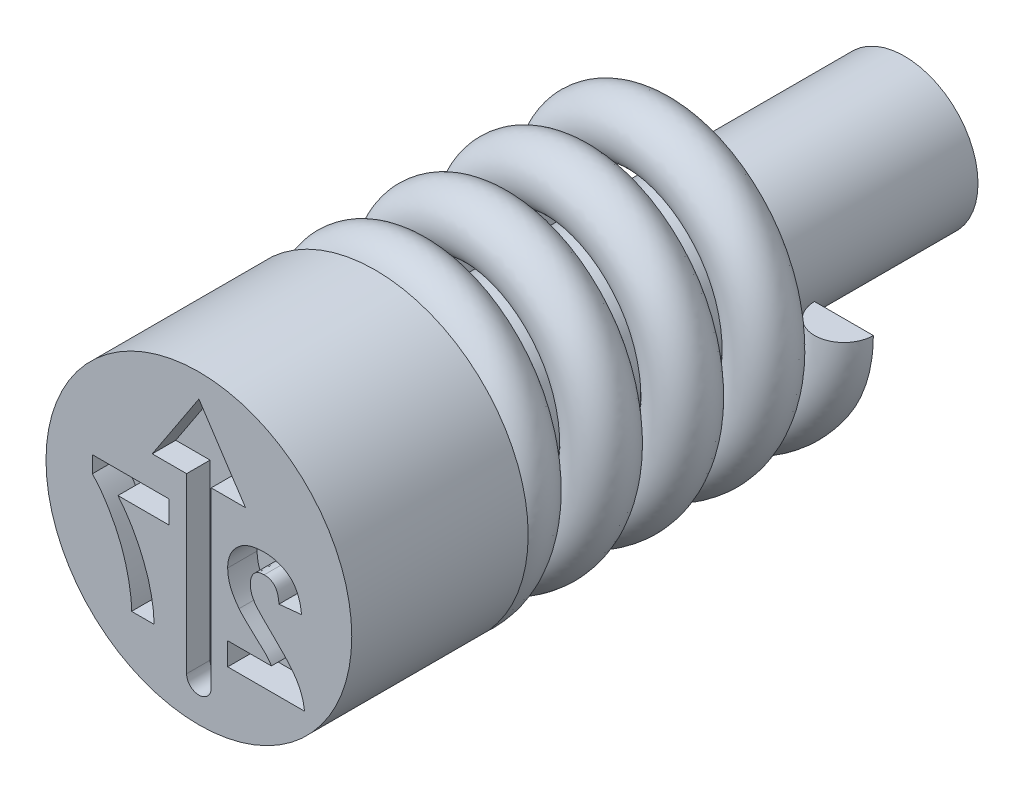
ISO-10303-21;
HEADER;
FILE_DESCRIPTION(('STEP AP214'),'2;1');
FILE_NAME('part.step','',(''),(''),'','','');
FILE_SCHEMA(('AUTOMOTIVE_DESIGN { 1 0 10303 214 1 1 1 1 }'));
ENDSEC;
DATA;
#1=APPLICATION_CONTEXT('core data for automotive mechanical design processes');
#2=APPLICATION_PROTOCOL_DEFINITION('international standard','automotive_design',2000,#1);
#3=PRODUCT_CONTEXT('',#1,'mechanical');
#4=PRODUCT('Part','Part','',(#3));
#5=PRODUCT_RELATED_PRODUCT_CATEGORY('part','',(#4));
#6=PRODUCT_DEFINITION_FORMATION('','',#4);
#7=PRODUCT_DEFINITION_CONTEXT('part definition',#1,'design');
#8=PRODUCT_DEFINITION('design','',#6,#7);
#9=PRODUCT_DEFINITION_SHAPE('','',#8);
#10=(LENGTH_UNIT() NAMED_UNIT(*) SI_UNIT(.MILLI.,.METRE.));
#11=(NAMED_UNIT(*) PLANE_ANGLE_UNIT() SI_UNIT($,.RADIAN.));
#12=(NAMED_UNIT(*) SI_UNIT($,.STERADIAN.) SOLID_ANGLE_UNIT());
#13=UNCERTAINTY_MEASURE_WITH_UNIT(LENGTH_MEASURE(1.E-05),#10,'distance_accuracy_value','');
#14=(GEOMETRIC_REPRESENTATION_CONTEXT(3) GLOBAL_UNCERTAINTY_ASSIGNED_CONTEXT((#13)) GLOBAL_UNIT_ASSIGNED_CONTEXT((#10,
#11,#12)) REPRESENTATION_CONTEXT('',''));
#15=CARTESIAN_POINT('',(0.,0.,0.));
#16=DIRECTION('',(0.,0.,1.));
#17=DIRECTION('',(1.,0.,0.));
#18=AXIS2_PLACEMENT_3D('',#15,#16,#17);
#19=CARTESIAN_POINT('',(2.1,0.,-9.37));
#20=DIRECTION('',(0.,-1.,0.));
#21=DIRECTION('',(0.,0.,-1.));
#22=AXIS2_PLACEMENT_3D('',#19,#20,#21);
#23=PLANE('',#22);
#24=CARTESIAN_POINT('',(2.1,0.,-8.87));
#25=DIRECTION('',(0.,1.,0.));
#26=DIRECTION('',(0.,0.,1.));
#27=AXIS2_PLACEMENT_3D('',#24,#25,#26);
#28=CIRCLE('',#27,0.5);
#29=CARTESIAN_POINT('',(1.6,0.,-8.87));
#30=VERTEX_POINT('',#29);
#31=CARTESIAN_POINT('',(2.6,0.,-8.87));
#32=VERTEX_POINT('',#31);
#33=EDGE_CURVE('E92',#30,#32,#28,.T.);
#34=ORIENTED_EDGE('',*,*,#33,.T.);
#35=DIRECTION('',(-1.,0.,0.));
#36=VECTOR('',#35,1.);
#37=CARTESIAN_POINT('',(2.1,0.,-8.87));
#38=LINE('',#37,#36);
#39=EDGE_CURVE('E79',#32,#30,#38,.T.);
#40=ORIENTED_EDGE('',*,*,#39,.T.);
#41=EDGE_LOOP('',(#34,#40));
#42=FACE_BOUND('',#41,.T.);
#43=ADVANCED_FACE('F53',(#42),#23,.F.);
#44=CARTESIAN_POINT('',(0.,-2.1,-3.5));
#45=DIRECTION('',(-1.,0.,0.));
#46=DIRECTION('',(0.,-1.,0.));
#47=AXIS2_PLACEMENT_3D('',#44,#45,#46);
#48=PLANE('',#47);
#49=DIRECTION('',(0.,-1.,0.));
#50=VECTOR('',#49,1.);
#51=CARTESIAN_POINT('',(0.,-2.1,-3.));
#52=LINE('',#51,#50);
#53=CARTESIAN_POINT('',(0.,-1.6,-3.));
#54=VERTEX_POINT('',#53);
#55=CARTESIAN_POINT('',(0.,-2.6,-3.));
#56=VERTEX_POINT('',#55);
#57=EDGE_CURVE('E73',#54,#56,#52,.T.);
#58=ORIENTED_EDGE('',*,*,#57,.F.);
#59=CARTESIAN_POINT('',(0.,-2.1,-3.));
#60=DIRECTION('',(-1.,0.,0.));
#61=DIRECTION('',(0.,-1.,0.));
#62=AXIS2_PLACEMENT_3D('',#59,#60,#61);
#63=CIRCLE('',#62,0.5);
#64=EDGE_CURVE('E89',#54,#56,#63,.T.);
#65=ORIENTED_EDGE('',*,*,#64,.T.);
#66=EDGE_LOOP('',(#58,#65));
#67=FACE_BOUND('',#66,.T.);
#68=ADVANCED_FACE('F55',(#67),#48,.T.);
#69=CARTESIAN_POINT('',(2.1,0.,-8.37));
#70=CARTESIAN_POINT('',(2.1,-0.8698484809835,-8.28367647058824));
#71=CARTESIAN_POINT('',(1.48492424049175,-1.48492424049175,-8.19735294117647));
#72=CARTESIAN_POINT('',(0.8698484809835,-2.1,-8.11102941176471));
#73=CARTESIAN_POINT('',(0.,-2.1,-8.02470588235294));
#74=CARTESIAN_POINT('',(-0.8698484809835,-2.1,-7.93838235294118));
#75=CARTESIAN_POINT('',(-1.48492424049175,-1.48492424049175,-7.85205882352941));
#76=CARTESIAN_POINT('',(-2.1,-0.8698484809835,-7.76573529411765));
#77=CARTESIAN_POINT('',(-2.1,0.,-7.67941176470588));
#78=CARTESIAN_POINT('',(-2.1,0.869848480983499,-7.59308823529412));
#79=CARTESIAN_POINT('',(-1.48492424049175,1.48492424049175,-7.50676470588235));
#80=CARTESIAN_POINT('',(-0.869848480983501,2.1,-7.42044117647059));
#81=CARTESIAN_POINT('',(0.,2.1,-7.33411764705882));
#82=CARTESIAN_POINT('',(0.8698484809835,2.1,-7.24779411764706));
#83=CARTESIAN_POINT('',(1.48492424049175,1.48492424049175,-7.1614705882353));
#84=CARTESIAN_POINT('',(2.1,0.869848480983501,-7.07514705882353));
#85=CARTESIAN_POINT('',(2.1,0.,-6.98882352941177));
#86=CARTESIAN_POINT('',(2.1,-0.8698484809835,-6.9025));
#87=CARTESIAN_POINT('',(1.48492424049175,-1.48492424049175,-6.81617647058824));
#88=CARTESIAN_POINT('',(0.8698484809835,-2.1,-6.72985294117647));
#89=CARTESIAN_POINT('',(0.,-2.1,-6.64352941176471));
#90=CARTESIAN_POINT('',(-0.8698484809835,-2.1,-6.55720588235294));
#91=CARTESIAN_POINT('',(-1.48492424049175,-1.48492424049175,-6.47088235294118));
#92=CARTESIAN_POINT('',(-2.1,-0.8698484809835,-6.38455882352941));
#93=CARTESIAN_POINT('',(-2.1,0.,-6.29823529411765));
#94=CARTESIAN_POINT('',(-2.1,0.869848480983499,-6.21191176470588));
#95=CARTESIAN_POINT('',(-1.48492424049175,1.48492424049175,-6.12558823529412));
#96=CARTESIAN_POINT('',(-0.869848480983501,2.1,-6.03926470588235));
#97=CARTESIAN_POINT('',(0.,2.1,-5.95294117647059));
#98=CARTESIAN_POINT('',(0.8698484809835,2.1,-5.86661764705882));
#99=CARTESIAN_POINT('',(1.48492424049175,1.48492424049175,-5.78029411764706));
#100=CARTESIAN_POINT('',(2.1,0.869848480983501,-5.6939705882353));
#101=CARTESIAN_POINT('',(2.1,0.,-5.60764705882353));
#102=CARTESIAN_POINT('',(2.1,-0.8698484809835,-5.52132352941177));
#103=CARTESIAN_POINT('',(1.48492424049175,-1.48492424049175,-5.435));
#104=CARTESIAN_POINT('',(0.8698484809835,-2.1,-5.34867647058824));
#105=CARTESIAN_POINT('',(0.,-2.1,-5.26235294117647));
#106=CARTESIAN_POINT('',(-0.8698484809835,-2.1,-5.17602941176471));
#107=CARTESIAN_POINT('',(-1.48492424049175,-1.48492424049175,-5.08970588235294));
#108=CARTESIAN_POINT('',(-2.1,-0.8698484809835,-5.00338235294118));
#109=CARTESIAN_POINT('',(-2.1,0.,-4.91705882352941));
#110=CARTESIAN_POINT('',(-2.1,0.869848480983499,-4.83073529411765));
#111=CARTESIAN_POINT('',(-1.48492424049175,1.48492424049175,-4.74441176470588));
#112=CARTESIAN_POINT('',(-0.869848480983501,2.1,-4.65808823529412));
#113=CARTESIAN_POINT('',(0.,2.1,-4.57176470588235));
#114=CARTESIAN_POINT('',(0.8698484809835,2.1,-4.48544117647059));
#115=CARTESIAN_POINT('',(1.48492424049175,1.48492424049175,-4.39911764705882));
#116=CARTESIAN_POINT('',(2.1,0.869848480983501,-4.31279411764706));
#117=CARTESIAN_POINT('',(2.1,0.,-4.2264705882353));
#118=CARTESIAN_POINT('',(2.1,-0.8698484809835,-4.14014705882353));
#119=CARTESIAN_POINT('',(1.48492424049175,-1.48492424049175,-4.05382352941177));
#120=CARTESIAN_POINT('',(0.8698484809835,-2.1,-3.9675));
#121=CARTESIAN_POINT('',(0.,-2.1,-3.88117647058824));
#122=CARTESIAN_POINT('',(-0.8698484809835,-2.1,-3.79485294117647));
#123=CARTESIAN_POINT('',(-1.48492424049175,-1.48492424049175,-3.70852941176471));
#124=CARTESIAN_POINT('',(-2.1,-0.8698484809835,-3.62220588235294));
#125=CARTESIAN_POINT('',(-2.1,0.,-3.53588235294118));
#126=CARTESIAN_POINT('',(-2.1,0.869848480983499,-3.44955882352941));
#127=CARTESIAN_POINT('',(-1.48492424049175,1.48492424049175,-3.36323529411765));
#128=CARTESIAN_POINT('',(-0.869848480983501,2.1,-3.27691176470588));
#129=CARTESIAN_POINT('',(0.,2.1,-3.19058823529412));
#130=CARTESIAN_POINT('',(0.8698484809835,2.1,-3.10426470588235));
#131=CARTESIAN_POINT('',(1.48492424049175,1.48492424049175,-3.01794117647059));
#132=CARTESIAN_POINT('',(2.1,0.869848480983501,-2.93161764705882));
#133=CARTESIAN_POINT('',(2.1,0.,-2.84529411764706));
#134=CARTESIAN_POINT('',(2.1,-0.8698484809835,-2.7589705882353));
#135=CARTESIAN_POINT('',(1.48492424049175,-1.48492424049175,-2.67264705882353));
#136=CARTESIAN_POINT('',(0.8698484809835,-2.1,-2.58632352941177));
#137=CARTESIAN_POINT('',(0.,-2.1,-2.5));
#138=CARTESIAN_POINT('',(3.1,0.,-8.37));
#139=CARTESIAN_POINT('',(3.1,-1.2840620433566,-8.28367647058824));
#140=CARTESIAN_POINT('',(2.1920310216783,-2.1920310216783,-8.19735294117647));
#141=CARTESIAN_POINT('',(1.2840620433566,-3.1,-8.11102941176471));
#142=CARTESIAN_POINT('',(0.,-3.1,-8.02470588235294));
#143=CARTESIAN_POINT('',(-1.28406204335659,-3.1,-7.93838235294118));
#144=CARTESIAN_POINT('',(-2.1920310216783,-2.1920310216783,-7.85205882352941));
#145=CARTESIAN_POINT('',(-3.1,-1.2840620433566,-7.76573529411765));
#146=CARTESIAN_POINT('',(-3.1,0.,-7.67941176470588));
#147=CARTESIAN_POINT('',(-3.1,1.28406204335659,-7.59308823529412));
#148=CARTESIAN_POINT('',(-2.1920310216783,2.1920310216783,-7.50676470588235));
#149=CARTESIAN_POINT('',(-1.2840620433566,3.1,-7.42044117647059));
#150=CARTESIAN_POINT('',(0.,3.1,-7.33411764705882));
#151=CARTESIAN_POINT('',(1.2840620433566,3.1,-7.24779411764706));
#152=CARTESIAN_POINT('',(2.1920310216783,2.1920310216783,-7.1614705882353));
#153=CARTESIAN_POINT('',(3.1,1.2840620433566,-7.07514705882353));
#154=CARTESIAN_POINT('',(3.1,0.,-6.98882352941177));
#155=CARTESIAN_POINT('',(3.1,-1.2840620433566,-6.9025));
#156=CARTESIAN_POINT('',(2.1920310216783,-2.1920310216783,-6.81617647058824));
#157=CARTESIAN_POINT('',(1.2840620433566,-3.1,-6.72985294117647));
#158=CARTESIAN_POINT('',(0.,-3.1,-6.64352941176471));
#159=CARTESIAN_POINT('',(-1.28406204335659,-3.1,-6.55720588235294));
#160=CARTESIAN_POINT('',(-2.1920310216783,-2.1920310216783,-6.47088235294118));
#161=CARTESIAN_POINT('',(-3.1,-1.2840620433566,-6.38455882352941));
#162=CARTESIAN_POINT('',(-3.1,0.,-6.29823529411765));
#163=CARTESIAN_POINT('',(-3.1,1.28406204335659,-6.21191176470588));
#164=CARTESIAN_POINT('',(-2.1920310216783,2.1920310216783,-6.12558823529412));
#165=CARTESIAN_POINT('',(-1.2840620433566,3.1,-6.03926470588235));
#166=CARTESIAN_POINT('',(0.,3.1,-5.95294117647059));
#167=CARTESIAN_POINT('',(1.2840620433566,3.1,-5.86661764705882));
#168=CARTESIAN_POINT('',(2.1920310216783,2.1920310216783,-5.78029411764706));
#169=CARTESIAN_POINT('',(3.1,1.2840620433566,-5.69397058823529));
#170=CARTESIAN_POINT('',(3.1,0.,-5.60764705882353));
#171=CARTESIAN_POINT('',(3.1,-1.2840620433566,-5.52132352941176));
#172=CARTESIAN_POINT('',(2.1920310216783,-2.1920310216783,-5.435));
#173=CARTESIAN_POINT('',(1.2840620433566,-3.1,-5.34867647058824));
#174=CARTESIAN_POINT('',(0.,-3.1,-5.26235294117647));
#175=CARTESIAN_POINT('',(-1.28406204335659,-3.1,-5.17602941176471));
#176=CARTESIAN_POINT('',(-2.1920310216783,-2.1920310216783,-5.08970588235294));
#177=CARTESIAN_POINT('',(-3.1,-1.2840620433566,-5.00338235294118));
#178=CARTESIAN_POINT('',(-3.1,0.,-4.91705882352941));
#179=CARTESIAN_POINT('',(-3.1,1.28406204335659,-4.83073529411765));
#180=CARTESIAN_POINT('',(-2.1920310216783,2.1920310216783,-4.74441176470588));
#181=CARTESIAN_POINT('',(-1.2840620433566,3.1,-4.65808823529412));
#182=CARTESIAN_POINT('',(0.,3.1,-4.57176470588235));
#183=CARTESIAN_POINT('',(1.2840620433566,3.1,-4.48544117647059));
#184=CARTESIAN_POINT('',(2.1920310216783,2.1920310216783,-4.39911764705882));
#185=CARTESIAN_POINT('',(3.1,1.2840620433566,-4.31279411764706));
#186=CARTESIAN_POINT('',(3.1,0.,-4.2264705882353));
#187=CARTESIAN_POINT('',(3.1,-1.2840620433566,-4.14014705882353));
#188=CARTESIAN_POINT('',(2.1920310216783,-2.1920310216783,-4.05382352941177));
#189=CARTESIAN_POINT('',(1.2840620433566,-3.1,-3.9675));
#190=CARTESIAN_POINT('',(0.,-3.1,-3.88117647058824));
#191=CARTESIAN_POINT('',(-1.28406204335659,-3.1,-3.79485294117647));
#192=CARTESIAN_POINT('',(-2.1920310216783,-2.1920310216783,-3.70852941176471));
#193=CARTESIAN_POINT('',(-3.1,-1.2840620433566,-3.62220588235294));
#194=CARTESIAN_POINT('',(-3.1,0.,-3.53588235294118));
#195=CARTESIAN_POINT('',(-3.1,1.28406204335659,-3.44955882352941));
#196=CARTESIAN_POINT('',(-2.1920310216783,2.1920310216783,-3.36323529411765));
#197=CARTESIAN_POINT('',(-1.2840620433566,3.1,-3.27691176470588));
#198=CARTESIAN_POINT('',(0.,3.1,-3.19058823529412));
#199=CARTESIAN_POINT('',(1.2840620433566,3.1,-3.10426470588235));
#200=CARTESIAN_POINT('',(2.1920310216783,2.1920310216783,-3.01794117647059));
#201=CARTESIAN_POINT('',(3.1,1.2840620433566,-2.93161764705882));
#202=CARTESIAN_POINT('',(3.1,0.,-2.84529411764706));
#203=CARTESIAN_POINT('',(3.1,-1.2840620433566,-2.75897058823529));
#204=CARTESIAN_POINT('',(2.1920310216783,-2.1920310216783,-2.67264705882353));
#205=CARTESIAN_POINT('',(1.2840620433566,-3.1,-2.58632352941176));
#206=CARTESIAN_POINT('',(0.,-3.1,-2.5));
#207=CARTESIAN_POINT('',(3.1,0.,-9.37));
#208=CARTESIAN_POINT('',(3.1,-1.2840620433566,-9.28367647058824));
#209=CARTESIAN_POINT('',(2.1920310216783,-2.1920310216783,-9.19735294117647));
#210=CARTESIAN_POINT('',(1.2840620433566,-3.1,-9.11102941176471));
#211=CARTESIAN_POINT('',(0.,-3.1,-9.02470588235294));
#212=CARTESIAN_POINT('',(-1.28406204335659,-3.1,-8.93838235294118));
#213=CARTESIAN_POINT('',(-2.1920310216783,-2.1920310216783,-8.85205882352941));
#214=CARTESIAN_POINT('',(-3.1,-1.2840620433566,-8.76573529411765));
#215=CARTESIAN_POINT('',(-3.1,0.,-8.67941176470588));
#216=CARTESIAN_POINT('',(-3.1,1.28406204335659,-8.59308823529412));
#217=CARTESIAN_POINT('',(-2.1920310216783,2.1920310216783,-8.50676470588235));
#218=CARTESIAN_POINT('',(-1.2840620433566,3.1,-8.42044117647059));
#219=CARTESIAN_POINT('',(0.,3.1,-8.33411764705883));
#220=CARTESIAN_POINT('',(1.2840620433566,3.1,-8.24779411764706));
#221=CARTESIAN_POINT('',(2.1920310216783,2.1920310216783,-8.16147058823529));
#222=CARTESIAN_POINT('',(3.1,1.2840620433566,-8.07514705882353));
#223=CARTESIAN_POINT('',(3.1,0.,-7.98882352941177));
#224=CARTESIAN_POINT('',(3.1,-1.2840620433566,-7.9025));
#225=CARTESIAN_POINT('',(2.1920310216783,-2.1920310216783,-7.81617647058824));
#226=CARTESIAN_POINT('',(1.2840620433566,-3.1,-7.72985294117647));
#227=CARTESIAN_POINT('',(0.,-3.1,-7.64352941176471));
#228=CARTESIAN_POINT('',(-1.28406204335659,-3.1,-7.55720588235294));
#229=CARTESIAN_POINT('',(-2.1920310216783,-2.1920310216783,-7.47088235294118));
#230=CARTESIAN_POINT('',(-3.1,-1.2840620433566,-7.38455882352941));
#231=CARTESIAN_POINT('',(-3.1,0.,-7.29823529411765));
#232=CARTESIAN_POINT('',(-3.1,1.28406204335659,-7.21191176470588));
#233=CARTESIAN_POINT('',(-2.1920310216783,2.1920310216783,-7.12558823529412));
#234=CARTESIAN_POINT('',(-1.2840620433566,3.1,-7.03926470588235));
#235=CARTESIAN_POINT('',(0.,3.1,-6.95294117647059));
#236=CARTESIAN_POINT('',(1.2840620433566,3.1,-6.86661764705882));
#237=CARTESIAN_POINT('',(2.1920310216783,2.1920310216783,-6.78029411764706));
#238=CARTESIAN_POINT('',(3.1,1.2840620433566,-6.6939705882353));
#239=CARTESIAN_POINT('',(3.1,0.,-6.60764705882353));
#240=CARTESIAN_POINT('',(3.1,-1.2840620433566,-6.52132352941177));
#241=CARTESIAN_POINT('',(2.1920310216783,-2.1920310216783,-6.435));
#242=CARTESIAN_POINT('',(1.2840620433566,-3.1,-6.34867647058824));
#243=CARTESIAN_POINT('',(0.,-3.1,-6.26235294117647));
#244=CARTESIAN_POINT('',(-1.28406204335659,-3.1,-6.17602941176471));
#245=CARTESIAN_POINT('',(-2.1920310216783,-2.1920310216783,-6.08970588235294));
#246=CARTESIAN_POINT('',(-3.1,-1.2840620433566,-6.00338235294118));
#247=CARTESIAN_POINT('',(-3.1,0.,-5.91705882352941));
#248=CARTESIAN_POINT('',(-3.1,1.28406204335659,-5.83073529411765));
#249=CARTESIAN_POINT('',(-2.1920310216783,2.1920310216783,-5.74441176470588));
#250=CARTESIAN_POINT('',(-1.2840620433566,3.1,-5.65808823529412));
#251=CARTESIAN_POINT('',(0.,3.1,-5.57176470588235));
#252=CARTESIAN_POINT('',(1.2840620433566,3.1,-5.48544117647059));
#253=CARTESIAN_POINT('',(2.1920310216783,2.1920310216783,-5.39911764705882));
#254=CARTESIAN_POINT('',(3.1,1.2840620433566,-5.31279411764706));
#255=CARTESIAN_POINT('',(3.1,0.,-5.2264705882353));
#256=CARTESIAN_POINT('',(3.1,-1.2840620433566,-5.14014705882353));
#257=CARTESIAN_POINT('',(2.1920310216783,-2.1920310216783,-5.05382352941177));
#258=CARTESIAN_POINT('',(1.2840620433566,-3.1,-4.9675));
#259=CARTESIAN_POINT('',(0.,-3.1,-4.88117647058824));
#260=CARTESIAN_POINT('',(-1.28406204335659,-3.1,-4.79485294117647));
#261=CARTESIAN_POINT('',(-2.1920310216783,-2.1920310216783,-4.70852941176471));
#262=CARTESIAN_POINT('',(-3.1,-1.2840620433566,-4.62220588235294));
#263=CARTESIAN_POINT('',(-3.1,0.,-4.53588235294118));
#264=CARTESIAN_POINT('',(-3.1,1.28406204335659,-4.44955882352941));
#265=CARTESIAN_POINT('',(-2.1920310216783,2.1920310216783,-4.36323529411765));
#266=CARTESIAN_POINT('',(-1.2840620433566,3.1,-4.27691176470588));
#267=CARTESIAN_POINT('',(0.,3.1,-4.19058823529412));
#268=CARTESIAN_POINT('',(1.2840620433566,3.1,-4.10426470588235));
#269=CARTESIAN_POINT('',(2.1920310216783,2.1920310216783,-4.01794117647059));
#270=CARTESIAN_POINT('',(3.1,1.2840620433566,-3.93161764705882));
#271=CARTESIAN_POINT('',(3.1,0.,-3.84529411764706));
#272=CARTESIAN_POINT('',(3.1,-1.2840620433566,-3.7589705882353));
#273=CARTESIAN_POINT('',(2.1920310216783,-2.1920310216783,-3.67264705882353));
#274=CARTESIAN_POINT('',(1.2840620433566,-3.1,-3.58632352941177));
#275=CARTESIAN_POINT('',(0.,-3.1,-3.5));
#276=CARTESIAN_POINT('',(2.1,0.,-9.37));
#277=CARTESIAN_POINT('',(2.1,-0.8698484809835,-9.28367647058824));
#278=CARTESIAN_POINT('',(1.48492424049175,-1.48492424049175,-9.19735294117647));
#279=CARTESIAN_POINT('',(0.8698484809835,-2.1,-9.11102941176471));
#280=CARTESIAN_POINT('',(0.,-2.1,-9.02470588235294));
#281=CARTESIAN_POINT('',(-0.8698484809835,-2.1,-8.93838235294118));
#282=CARTESIAN_POINT('',(-1.48492424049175,-1.48492424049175,-8.85205882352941));
#283=CARTESIAN_POINT('',(-2.1,-0.8698484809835,-8.76573529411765));
#284=CARTESIAN_POINT('',(-2.1,0.,-8.67941176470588));
#285=CARTESIAN_POINT('',(-2.1,0.869848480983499,-8.59308823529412));
#286=CARTESIAN_POINT('',(-1.48492424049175,1.48492424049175,-8.50676470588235));
#287=CARTESIAN_POINT('',(-0.869848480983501,2.1,-8.42044117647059));
#288=CARTESIAN_POINT('',(0.,2.1,-8.33411764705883));
#289=CARTESIAN_POINT('',(0.8698484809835,2.1,-8.24779411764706));
#290=CARTESIAN_POINT('',(1.48492424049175,1.48492424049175,-8.1614705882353));
#291=CARTESIAN_POINT('',(2.1,0.869848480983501,-8.07514705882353));
#292=CARTESIAN_POINT('',(2.1,0.,-7.98882352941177));
#293=CARTESIAN_POINT('',(2.1,-0.8698484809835,-7.9025));
#294=CARTESIAN_POINT('',(1.48492424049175,-1.48492424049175,-7.81617647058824));
#295=CARTESIAN_POINT('',(0.8698484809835,-2.1,-7.72985294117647));
#296=CARTESIAN_POINT('',(0.,-2.1,-7.64352941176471));
#297=CARTESIAN_POINT('',(-0.8698484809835,-2.1,-7.55720588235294));
#298=CARTESIAN_POINT('',(-1.48492424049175,-1.48492424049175,-7.47088235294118));
#299=CARTESIAN_POINT('',(-2.1,-0.8698484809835,-7.38455882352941));
#300=CARTESIAN_POINT('',(-2.1,0.,-7.29823529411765));
#301=CARTESIAN_POINT('',(-2.1,0.869848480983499,-7.21191176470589));
#302=CARTESIAN_POINT('',(-1.48492424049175,1.48492424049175,-7.12558823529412));
#303=CARTESIAN_POINT('',(-0.869848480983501,2.1,-7.03926470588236));
#304=CARTESIAN_POINT('',(0.,2.1,-6.95294117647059));
#305=CARTESIAN_POINT('',(0.8698484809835,2.1,-6.86661764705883));
#306=CARTESIAN_POINT('',(1.48492424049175,1.48492424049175,-6.78029411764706));
#307=CARTESIAN_POINT('',(2.1,0.869848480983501,-6.6939705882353));
#308=CARTESIAN_POINT('',(2.1,0.,-6.60764705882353));
#309=CARTESIAN_POINT('',(2.1,-0.8698484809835,-6.52132352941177));
#310=CARTESIAN_POINT('',(1.48492424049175,-1.48492424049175,-6.435));
#311=CARTESIAN_POINT('',(0.8698484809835,-2.1,-6.34867647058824));
#312=CARTESIAN_POINT('',(0.,-2.1,-6.26235294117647));
#313=CARTESIAN_POINT('',(-0.8698484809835,-2.1,-6.17602941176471));
#314=CARTESIAN_POINT('',(-1.48492424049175,-1.48492424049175,-6.08970588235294));
#315=CARTESIAN_POINT('',(-2.1,-0.8698484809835,-6.00338235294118));
#316=CARTESIAN_POINT('',(-2.1,0.,-5.91705882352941));
#317=CARTESIAN_POINT('',(-2.1,0.869848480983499,-5.83073529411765));
#318=CARTESIAN_POINT('',(-1.48492424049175,1.48492424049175,-5.74441176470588));
#319=CARTESIAN_POINT('',(-0.869848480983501,2.1,-5.65808823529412));
#320=CARTESIAN_POINT('',(0.,2.1,-5.57176470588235));
#321=CARTESIAN_POINT('',(0.8698484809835,2.1,-5.48544117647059));
#322=CARTESIAN_POINT('',(1.48492424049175,1.48492424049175,-5.39911764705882));
#323=CARTESIAN_POINT('',(2.1,0.869848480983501,-5.31279411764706));
#324=CARTESIAN_POINT('',(2.1,0.,-5.2264705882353));
#325=CARTESIAN_POINT('',(2.1,-0.8698484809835,-5.14014705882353));
#326=CARTESIAN_POINT('',(1.48492424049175,-1.48492424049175,-5.05382352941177));
#327=CARTESIAN_POINT('',(0.8698484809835,-2.1,-4.9675));
#328=CARTESIAN_POINT('',(0.,-2.1,-4.88117647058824));
#329=CARTESIAN_POINT('',(-0.8698484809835,-2.1,-4.79485294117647));
#330=CARTESIAN_POINT('',(-1.48492424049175,-1.48492424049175,-4.70852941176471));
#331=CARTESIAN_POINT('',(-2.1,-0.8698484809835,-4.62220588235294));
#332=CARTESIAN_POINT('',(-2.1,0.,-4.53588235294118));
#333=CARTESIAN_POINT('',(-2.1,0.869848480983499,-4.44955882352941));
#334=CARTESIAN_POINT('',(-1.48492424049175,1.48492424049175,-4.36323529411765));
#335=CARTESIAN_POINT('',(-0.869848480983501,2.1,-4.27691176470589));
#336=CARTESIAN_POINT('',(0.,2.1,-4.19058823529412));
#337=CARTESIAN_POINT('',(0.8698484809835,2.1,-4.10426470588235));
#338=CARTESIAN_POINT('',(1.48492424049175,1.48492424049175,-4.01794117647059));
#339=CARTESIAN_POINT('',(2.1,0.869848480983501,-3.93161764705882));
#340=CARTESIAN_POINT('',(2.1,0.,-3.84529411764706));
#341=CARTESIAN_POINT('',(2.1,-0.8698484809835,-3.7589705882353));
#342=CARTESIAN_POINT('',(1.48492424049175,-1.48492424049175,-3.67264705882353));
#343=CARTESIAN_POINT('',(0.8698484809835,-2.1,-3.58632352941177));
#344=CARTESIAN_POINT('',(0.,-2.1,-3.5));
#345=CARTESIAN_POINT('',(1.1,0.,-9.37));
#346=CARTESIAN_POINT('',(1.1,-0.455634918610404,-9.28367647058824));
#347=CARTESIAN_POINT('',(0.777817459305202,-0.777817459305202,-9.19735294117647));
#348=CARTESIAN_POINT('',(0.455634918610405,-1.1,-9.11102941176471));
#349=CARTESIAN_POINT('',(0.,-1.1,-9.02470588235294));
#350=CARTESIAN_POINT('',(-0.455634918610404,-1.1,-8.93838235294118));
#351=CARTESIAN_POINT('',(-0.777817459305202,-0.777817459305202,-8.85205882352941));
#352=CARTESIAN_POINT('',(-1.1,-0.455634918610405,-8.76573529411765));
#353=CARTESIAN_POINT('',(-1.1,0.,-8.67941176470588));
#354=CARTESIAN_POINT('',(-1.1,0.455634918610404,-8.59308823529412));
#355=CARTESIAN_POINT('',(-0.777817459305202,0.777817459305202,-8.50676470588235));
#356=CARTESIAN_POINT('',(-0.455634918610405,1.1,-8.42044117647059));
#357=CARTESIAN_POINT('',(0.,1.1,-8.33411764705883));
#358=CARTESIAN_POINT('',(0.455634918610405,1.1,-8.24779411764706));
#359=CARTESIAN_POINT('',(0.777817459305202,0.777817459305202,-8.16147058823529));
#360=CARTESIAN_POINT('',(1.1,0.455634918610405,-8.07514705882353));
#361=CARTESIAN_POINT('',(1.1,0.,-7.98882352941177));
#362=CARTESIAN_POINT('',(1.1,-0.455634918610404,-7.9025));
#363=CARTESIAN_POINT('',(0.777817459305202,-0.777817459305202,-7.81617647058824));
#364=CARTESIAN_POINT('',(0.455634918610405,-1.1,-7.72985294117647));
#365=CARTESIAN_POINT('',(0.,-1.1,-7.64352941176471));
#366=CARTESIAN_POINT('',(-0.455634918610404,-1.1,-7.55720588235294));
#367=CARTESIAN_POINT('',(-0.777817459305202,-0.777817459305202,-7.47088235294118));
#368=CARTESIAN_POINT('',(-1.1,-0.455634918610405,-7.38455882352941));
#369=CARTESIAN_POINT('',(-1.1,0.,-7.29823529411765));
#370=CARTESIAN_POINT('',(-1.1,0.455634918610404,-7.21191176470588));
#371=CARTESIAN_POINT('',(-0.777817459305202,0.777817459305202,-7.12558823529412));
#372=CARTESIAN_POINT('',(-0.455634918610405,1.1,-7.03926470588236));
#373=CARTESIAN_POINT('',(0.,1.1,-6.95294117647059));
#374=CARTESIAN_POINT('',(0.455634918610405,1.1,-6.86661764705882));
#375=CARTESIAN_POINT('',(0.777817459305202,0.777817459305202,-6.78029411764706));
#376=CARTESIAN_POINT('',(1.1,0.455634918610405,-6.6939705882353));
#377=CARTESIAN_POINT('',(1.1,0.,-6.60764705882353));
#378=CARTESIAN_POINT('',(1.1,-0.455634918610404,-6.52132352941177));
#379=CARTESIAN_POINT('',(0.777817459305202,-0.777817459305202,-6.435));
#380=CARTESIAN_POINT('',(0.455634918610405,-1.1,-6.34867647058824));
#381=CARTESIAN_POINT('',(0.,-1.1,-6.26235294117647));
#382=CARTESIAN_POINT('',(-0.455634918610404,-1.1,-6.17602941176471));
#383=CARTESIAN_POINT('',(-0.777817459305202,-0.777817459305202,-6.08970588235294));
#384=CARTESIAN_POINT('',(-1.1,-0.455634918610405,-6.00338235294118));
#385=CARTESIAN_POINT('',(-1.1,0.,-5.91705882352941));
#386=CARTESIAN_POINT('',(-1.1,0.455634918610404,-5.83073529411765));
#387=CARTESIAN_POINT('',(-0.777817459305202,0.777817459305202,-5.74441176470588));
#388=CARTESIAN_POINT('',(-0.455634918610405,1.1,-5.65808823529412));
#389=CARTESIAN_POINT('',(0.,1.1,-5.57176470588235));
#390=CARTESIAN_POINT('',(0.455634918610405,1.1,-5.48544117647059));
#391=CARTESIAN_POINT('',(0.777817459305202,0.777817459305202,-5.39911764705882));
#392=CARTESIAN_POINT('',(1.1,0.455634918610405,-5.31279411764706));
#393=CARTESIAN_POINT('',(1.1,0.,-5.2264705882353));
#394=CARTESIAN_POINT('',(1.1,-0.455634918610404,-5.14014705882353));
#395=CARTESIAN_POINT('',(0.777817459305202,-0.777817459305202,-5.05382352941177));
#396=CARTESIAN_POINT('',(0.455634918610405,-1.1,-4.9675));
#397=CARTESIAN_POINT('',(0.,-1.1,-4.88117647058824));
#398=CARTESIAN_POINT('',(-0.455634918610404,-1.1,-4.79485294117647));
#399=CARTESIAN_POINT('',(-0.777817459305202,-0.777817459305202,-4.70852941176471));
#400=CARTESIAN_POINT('',(-1.1,-0.455634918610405,-4.62220588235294));
#401=CARTESIAN_POINT('',(-1.1,0.,-4.53588235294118));
#402=CARTESIAN_POINT('',(-1.1,0.455634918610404,-4.44955882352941));
#403=CARTESIAN_POINT('',(-0.777817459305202,0.777817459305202,-4.36323529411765));
#404=CARTESIAN_POINT('',(-0.455634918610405,1.1,-4.27691176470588));
#405=CARTESIAN_POINT('',(0.,1.1,-4.19058823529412));
#406=CARTESIAN_POINT('',(0.455634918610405,1.1,-4.10426470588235));
#407=CARTESIAN_POINT('',(0.777817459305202,0.777817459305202,-4.01794117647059));
#408=CARTESIAN_POINT('',(1.1,0.455634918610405,-3.93161764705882));
#409=CARTESIAN_POINT('',(1.1,0.,-3.84529411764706));
#410=CARTESIAN_POINT('',(1.1,-0.455634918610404,-3.7589705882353));
#411=CARTESIAN_POINT('',(0.777817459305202,-0.777817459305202,-3.67264705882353));
#412=CARTESIAN_POINT('',(0.455634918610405,-1.1,-3.58632352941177));
#413=CARTESIAN_POINT('',(0.,-1.1,-3.5));
#414=CARTESIAN_POINT('',(1.1,0.,-8.37));
#415=CARTESIAN_POINT('',(1.1,-0.455634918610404,-8.28367647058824));
#416=CARTESIAN_POINT('',(0.777817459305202,-0.777817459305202,-8.19735294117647));
#417=CARTESIAN_POINT('',(0.455634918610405,-1.1,-8.11102941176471));
#418=CARTESIAN_POINT('',(0.,-1.1,-8.02470588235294));
#419=CARTESIAN_POINT('',(-0.455634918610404,-1.1,-7.93838235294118));
#420=CARTESIAN_POINT('',(-0.777817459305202,-0.777817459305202,-7.85205882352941));
#421=CARTESIAN_POINT('',(-1.1,-0.455634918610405,-7.76573529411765));
#422=CARTESIAN_POINT('',(-1.1,0.,-7.67941176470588));
#423=CARTESIAN_POINT('',(-1.1,0.455634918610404,-7.59308823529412));
#424=CARTESIAN_POINT('',(-0.777817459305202,0.777817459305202,-7.50676470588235));
#425=CARTESIAN_POINT('',(-0.455634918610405,1.1,-7.42044117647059));
#426=CARTESIAN_POINT('',(0.,1.1,-7.33411764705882));
#427=CARTESIAN_POINT('',(0.455634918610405,1.1,-7.24779411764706));
#428=CARTESIAN_POINT('',(0.777817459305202,0.777817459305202,-7.1614705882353));
#429=CARTESIAN_POINT('',(1.1,0.455634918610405,-7.07514705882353));
#430=CARTESIAN_POINT('',(1.1,0.,-6.98882352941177));
#431=CARTESIAN_POINT('',(1.1,-0.455634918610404,-6.9025));
#432=CARTESIAN_POINT('',(0.777817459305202,-0.777817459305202,-6.81617647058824));
#433=CARTESIAN_POINT('',(0.455634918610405,-1.1,-6.72985294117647));
#434=CARTESIAN_POINT('',(0.,-1.1,-6.64352941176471));
#435=CARTESIAN_POINT('',(-0.455634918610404,-1.1,-6.55720588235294));
#436=CARTESIAN_POINT('',(-0.777817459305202,-0.777817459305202,-6.47088235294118));
#437=CARTESIAN_POINT('',(-1.1,-0.455634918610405,-6.38455882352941));
#438=CARTESIAN_POINT('',(-1.1,0.,-6.29823529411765));
#439=CARTESIAN_POINT('',(-1.1,0.455634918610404,-6.21191176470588));
#440=CARTESIAN_POINT('',(-0.777817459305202,0.777817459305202,-6.12558823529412));
#441=CARTESIAN_POINT('',(-0.455634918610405,1.1,-6.03926470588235));
#442=CARTESIAN_POINT('',(0.,1.1,-5.95294117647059));
#443=CARTESIAN_POINT('',(0.455634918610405,1.1,-5.86661764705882));
#444=CARTESIAN_POINT('',(0.777817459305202,0.777817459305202,-5.78029411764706));
#445=CARTESIAN_POINT('',(1.1,0.455634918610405,-5.69397058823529));
#446=CARTESIAN_POINT('',(1.1,0.,-5.60764705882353));
#447=CARTESIAN_POINT('',(1.1,-0.455634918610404,-5.52132352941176));
#448=CARTESIAN_POINT('',(0.777817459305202,-0.777817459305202,-5.435));
#449=CARTESIAN_POINT('',(0.455634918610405,-1.1,-5.34867647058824));
#450=CARTESIAN_POINT('',(0.,-1.1,-5.26235294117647));
#451=CARTESIAN_POINT('',(-0.455634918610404,-1.1,-5.17602941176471));
#452=CARTESIAN_POINT('',(-0.777817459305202,-0.777817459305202,-5.08970588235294));
#453=CARTESIAN_POINT('',(-1.1,-0.455634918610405,-5.00338235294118));
#454=CARTESIAN_POINT('',(-1.1,0.,-4.91705882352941));
#455=CARTESIAN_POINT('',(-1.1,0.455634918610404,-4.83073529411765));
#456=CARTESIAN_POINT('',(-0.777817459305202,0.777817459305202,-4.74441176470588));
#457=CARTESIAN_POINT('',(-0.455634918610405,1.1,-4.65808823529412));
#458=CARTESIAN_POINT('',(0.,1.1,-4.57176470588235));
#459=CARTESIAN_POINT('',(0.455634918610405,1.1,-4.48544117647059));
#460=CARTESIAN_POINT('',(0.777817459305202,0.777817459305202,-4.39911764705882));
#461=CARTESIAN_POINT('',(1.1,0.455634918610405,-4.31279411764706));
#462=CARTESIAN_POINT('',(1.1,0.,-4.2264705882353));
#463=CARTESIAN_POINT('',(1.1,-0.455634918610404,-4.14014705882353));
#464=CARTESIAN_POINT('',(0.777817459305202,-0.777817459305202,-4.05382352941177));
#465=CARTESIAN_POINT('',(0.455634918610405,-1.1,-3.9675));
#466=CARTESIAN_POINT('',(0.,-1.1,-3.88117647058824));
#467=CARTESIAN_POINT('',(-0.455634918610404,-1.1,-3.79485294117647));
#468=CARTESIAN_POINT('',(-0.777817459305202,-0.777817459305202,-3.70852941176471));
#469=CARTESIAN_POINT('',(-1.1,-0.455634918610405,-3.62220588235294));
#470=CARTESIAN_POINT('',(-1.1,0.,-3.53588235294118));
#471=CARTESIAN_POINT('',(-1.1,0.455634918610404,-3.44955882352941));
#472=CARTESIAN_POINT('',(-0.777817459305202,0.777817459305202,-3.36323529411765));
#473=CARTESIAN_POINT('',(-0.455634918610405,1.1,-3.27691176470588));
#474=CARTESIAN_POINT('',(0.,1.1,-3.19058823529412));
#475=CARTESIAN_POINT('',(0.455634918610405,1.1,-3.10426470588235));
#476=CARTESIAN_POINT('',(0.777817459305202,0.777817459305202,-3.01794117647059));
#477=CARTESIAN_POINT('',(1.1,0.455634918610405,-2.93161764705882));
#478=CARTESIAN_POINT('',(1.1,0.,-2.84529411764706));
#479=CARTESIAN_POINT('',(1.1,-0.455634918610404,-2.75897058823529));
#480=CARTESIAN_POINT('',(0.777817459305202,-0.777817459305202,-2.67264705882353));
#481=CARTESIAN_POINT('',(0.455634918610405,-1.1,-2.58632352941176));
#482=CARTESIAN_POINT('',(0.,-1.1,-2.5));
#483=CARTESIAN_POINT('',(2.1,0.,-8.37));
#484=CARTESIAN_POINT('',(2.1,-0.8698484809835,-8.28367647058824));
#485=CARTESIAN_POINT('',(1.48492424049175,-1.48492424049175,-8.19735294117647));
#486=CARTESIAN_POINT('',(0.8698484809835,-2.1,-8.11102941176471));
#487=CARTESIAN_POINT('',(0.,-2.1,-8.02470588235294));
#488=CARTESIAN_POINT('',(-0.8698484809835,-2.1,-7.93838235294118));
#489=CARTESIAN_POINT('',(-1.48492424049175,-1.48492424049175,-7.85205882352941));
#490=CARTESIAN_POINT('',(-2.1,-0.8698484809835,-7.76573529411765));
#491=CARTESIAN_POINT('',(-2.1,0.,-7.67941176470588));
#492=CARTESIAN_POINT('',(-2.1,0.869848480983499,-7.59308823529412));
#493=CARTESIAN_POINT('',(-1.48492424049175,1.48492424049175,-7.50676470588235));
#494=CARTESIAN_POINT('',(-0.869848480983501,2.1,-7.42044117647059));
#495=CARTESIAN_POINT('',(0.,2.1,-7.33411764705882));
#496=CARTESIAN_POINT('',(0.8698484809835,2.1,-7.24779411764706));
#497=CARTESIAN_POINT('',(1.48492424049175,1.48492424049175,-7.1614705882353));
#498=CARTESIAN_POINT('',(2.1,0.869848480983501,-7.07514705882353));
#499=CARTESIAN_POINT('',(2.1,0.,-6.98882352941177));
#500=CARTESIAN_POINT('',(2.1,-0.8698484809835,-6.9025));
#501=CARTESIAN_POINT('',(1.48492424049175,-1.48492424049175,-6.81617647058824));
#502=CARTESIAN_POINT('',(0.8698484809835,-2.1,-6.72985294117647));
#503=CARTESIAN_POINT('',(0.,-2.1,-6.64352941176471));
#504=CARTESIAN_POINT('',(-0.8698484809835,-2.1,-6.55720588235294));
#505=CARTESIAN_POINT('',(-1.48492424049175,-1.48492424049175,-6.47088235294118));
#506=CARTESIAN_POINT('',(-2.1,-0.8698484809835,-6.38455882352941));
#507=CARTESIAN_POINT('',(-2.1,0.,-6.29823529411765));
#508=CARTESIAN_POINT('',(-2.1,0.869848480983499,-6.21191176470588));
#509=CARTESIAN_POINT('',(-1.48492424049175,1.48492424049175,-6.12558823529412));
#510=CARTESIAN_POINT('',(-0.869848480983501,2.1,-6.03926470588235));
#511=CARTESIAN_POINT('',(0.,2.1,-5.95294117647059));
#512=CARTESIAN_POINT('',(0.8698484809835,2.1,-5.86661764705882));
#513=CARTESIAN_POINT('',(1.48492424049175,1.48492424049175,-5.78029411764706));
#514=CARTESIAN_POINT('',(2.1,0.869848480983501,-5.6939705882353));
#515=CARTESIAN_POINT('',(2.1,0.,-5.60764705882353));
#516=CARTESIAN_POINT('',(2.1,-0.8698484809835,-5.52132352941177));
#517=CARTESIAN_POINT('',(1.48492424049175,-1.48492424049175,-5.435));
#518=CARTESIAN_POINT('',(0.8698484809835,-2.1,-5.34867647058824));
#519=CARTESIAN_POINT('',(0.,-2.1,-5.26235294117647));
#520=CARTESIAN_POINT('',(-0.8698484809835,-2.1,-5.17602941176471));
#521=CARTESIAN_POINT('',(-1.48492424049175,-1.48492424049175,-5.08970588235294));
#522=CARTESIAN_POINT('',(-2.1,-0.8698484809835,-5.00338235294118));
#523=CARTESIAN_POINT('',(-2.1,0.,-4.91705882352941));
#524=CARTESIAN_POINT('',(-2.1,0.869848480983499,-4.83073529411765));
#525=CARTESIAN_POINT('',(-1.48492424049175,1.48492424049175,-4.74441176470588));
#526=CARTESIAN_POINT('',(-0.869848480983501,2.1,-4.65808823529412));
#527=CARTESIAN_POINT('',(0.,2.1,-4.57176470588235));
#528=CARTESIAN_POINT('',(0.8698484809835,2.1,-4.48544117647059));
#529=CARTESIAN_POINT('',(1.48492424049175,1.48492424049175,-4.39911764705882));
#530=CARTESIAN_POINT('',(2.1,0.869848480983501,-4.31279411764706));
#531=CARTESIAN_POINT('',(2.1,0.,-4.2264705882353));
#532=CARTESIAN_POINT('',(2.1,-0.8698484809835,-4.14014705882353));
#533=CARTESIAN_POINT('',(1.48492424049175,-1.48492424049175,-4.05382352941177));
#534=CARTESIAN_POINT('',(0.8698484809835,-2.1,-3.9675));
#535=CARTESIAN_POINT('',(0.,-2.1,-3.88117647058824));
#536=CARTESIAN_POINT('',(-0.8698484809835,-2.1,-3.79485294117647));
#537=CARTESIAN_POINT('',(-1.48492424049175,-1.48492424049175,-3.70852941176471));
#538=CARTESIAN_POINT('',(-2.1,-0.8698484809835,-3.62220588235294));
#539=CARTESIAN_POINT('',(-2.1,0.,-3.53588235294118));
#540=CARTESIAN_POINT('',(-2.1,0.869848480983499,-3.44955882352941));
#541=CARTESIAN_POINT('',(-1.48492424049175,1.48492424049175,-3.36323529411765));
#542=CARTESIAN_POINT('',(-0.869848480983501,2.1,-3.27691176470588));
#543=CARTESIAN_POINT('',(0.,2.1,-3.19058823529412));
#544=CARTESIAN_POINT('',(0.8698484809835,2.1,-3.10426470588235));
#545=CARTESIAN_POINT('',(1.48492424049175,1.48492424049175,-3.01794117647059));
#546=CARTESIAN_POINT('',(2.1,0.869848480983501,-2.93161764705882));
#547=CARTESIAN_POINT('',(2.1,0.,-2.84529411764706));
#548=CARTESIAN_POINT('',(2.1,-0.8698484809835,-2.7589705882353));
#549=CARTESIAN_POINT('',(1.48492424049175,-1.48492424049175,-2.67264705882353));
#550=CARTESIAN_POINT('',(0.8698484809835,-2.1,-2.58632352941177));
#551=CARTESIAN_POINT('',(0.,-2.1,-2.5));
#552=(BOUNDED_SURFACE() B_SPLINE_SURFACE(3,2,((#69,#70,#71,#72,#73,#74,#75,#76,#77,#78,#79,#80,
#81,#82,#83,#84,#85,#86,#87,#88,#89,#90,#91,#92,#93,#94,#95,#96,#97,#98,#99,#100,#101,#102,#103,
#104,#105,#106,#107,#108,#109,#110,#111,#112,#113,#114,#115,#116,#117,#118,#119,#120,#121,#122,
#123,#124,#125,#126,#127,#128,#129,#130,#131,#132,#133,#134,#135,#136,#137),(#138,#139,#140,
#141,#142,#143,#144,#145,#146,#147,#148,#149,#150,#151,#152,#153,#154,#155,#156,#157,#158,#159,
#160,#161,#162,#163,#164,#165,#166,#167,#168,#169,#170,#171,#172,#173,#174,#175,#176,#177,#178,
#179,#180,#181,#182,#183,#184,#185,#186,#187,#188,#189,#190,#191,#192,#193,#194,#195,#196,#197,
#198,#199,#200,#201,#202,#203,#204,#205,#206),(#207,#208,#209,#210,#211,#212,#213,#214,#215,
#216,#217,#218,#219,#220,#221,#222,#223,#224,#225,#226,#227,#228,#229,#230,#231,#232,#233,#234,
#235,#236,#237,#238,#239,#240,#241,#242,#243,#244,#245,#246,#247,#248,#249,#250,#251,#252,#253,
#254,#255,#256,#257,#258,#259,#260,#261,#262,#263,#264,#265,#266,#267,#268,#269,#270,#271,#272,
#273,#274,#275),(#276,#277,#278,#279,#280,#281,#282,#283,#284,#285,#286,#287,#288,#289,#290,
#291,#292,#293,#294,#295,#296,#297,#298,#299,#300,#301,#302,#303,#304,#305,#306,#307,#308,#309,
#310,#311,#312,#313,#314,#315,#316,#317,#318,#319,#320,#321,#322,#323,#324,#325,#326,#327,#328,
#329,#330,#331,#332,#333,#334,#335,#336,#337,#338,#339,#340,#341,#342,#343,#344),(#345,#346,
#347,#348,#349,#350,#351,#352,#353,#354,#355,#356,#357,#358,#359,#360,#361,#362,#363,#364,#365,
#366,#367,#368,#369,#370,#371,#372,#373,#374,#375,#376,#377,#378,#379,#380,#381,#382,#383,#384,
#385,#386,#387,#388,#389,#390,#391,#392,#393,#394,#395,#396,#397,#398,#399,#400,#401,#402,#403,
#404,#405,#406,#407,#408,#409,#410,#411,#412,#413),(#414,#415,#416,#417,#418,#419,#420,#421,
#422,#423,#424,#425,#426,#427,#428,#429,#430,#431,#432,#433,#434,#435,#436,#437,#438,#439,#440,
#441,#442,#443,#444,#445,#446,#447,#448,#449,#450,#451,#452,#453,#454,#455,#456,#457,#458,#459,
#460,#461,#462,#463,#464,#465,#466,#467,#468,#469,#470,#471,#472,#473,#474,#475,#476,#477,#478,
#479,#480,#481,#482),(#483,#484,#485,#486,#487,#488,#489,#490,#491,#492,#493,#494,#495,#496,
#497,#498,#499,#500,#501,#502,#503,#504,#505,#506,#507,#508,#509,#510,#511,#512,#513,#514,#515,
#516,#517,#518,#519,#520,#521,#522,#523,#524,#525,#526,#527,#528,#529,#530,#531,#532,#533,#534,
#535,#536,#537,#538,#539,#540,#541,#542,#543,#544,#545,#546,#547,#548,#549,#550,#551)),
.UNSPECIFIED.,.T.,.F.,.F.) B_SPLINE_SURFACE_WITH_KNOTS((4,3,4),(3,2,2,2,2,2,2,2,2,2,2,2,2,2,2,2,
2,2,2,2,2,2,2,2,2,2,2,2,2,2,2,2,2,2,3),(0.,0.5,1.),(0.,0.025,0.05,0.075,0.1,0.125,0.15,0.175,
0.2,0.225,0.25,0.275,0.3,0.325,0.35,0.375,0.4,0.425,0.45,0.475,0.5,0.525,0.55,0.575,0.6,0.625,
0.65,0.675,0.7,0.725,0.75,0.775,0.8,0.825,0.85),
.UNSPECIFIED.) GEOMETRIC_REPRESENTATION_ITEM() RATIONAL_B_SPLINE_SURFACE(((1.,0.923879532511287,
1.,0.923879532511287,1.,0.923879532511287,1.,0.923879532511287,1.,0.923879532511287,1.,
0.923879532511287,1.,0.923879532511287,1.,0.923879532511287,1.,0.923879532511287,1.,
0.923879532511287,1.,0.923879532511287,1.,0.923879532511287,1.,0.923879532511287,1.,
0.923879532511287,1.,0.923879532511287,1.,0.923879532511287,1.,0.923879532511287,1.,
0.923879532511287,1.,0.923879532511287,1.,0.923879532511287,1.,0.923879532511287,1.,
0.923879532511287,1.,0.923879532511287,1.,0.923879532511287,1.,0.923879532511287,1.,
0.923879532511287,1.,0.923879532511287,1.,0.923879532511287,1.,0.923879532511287,1.,
0.923879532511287,1.,0.923879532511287,1.,0.923879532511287,1.,0.923879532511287,1.,
0.923879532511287,1.),(0.333333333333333,0.307959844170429,0.333333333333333,0.307959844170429,
0.333333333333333,0.307959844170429,0.333333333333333,0.307959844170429,0.333333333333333,
0.307959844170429,0.333333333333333,0.307959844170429,0.333333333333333,0.307959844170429,
0.333333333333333,0.307959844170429,0.333333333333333,0.307959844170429,0.333333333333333,
0.307959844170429,0.333333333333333,0.307959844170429,0.333333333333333,0.307959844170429,
0.333333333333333,0.307959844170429,0.333333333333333,0.307959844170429,0.333333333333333,
0.307959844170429,0.333333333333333,0.307959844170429,0.333333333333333,0.307959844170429,
0.333333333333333,0.307959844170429,0.333333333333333,0.307959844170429,0.333333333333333,
0.307959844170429,0.333333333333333,0.307959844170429,0.333333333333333,0.307959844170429,
0.333333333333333,0.307959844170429,0.333333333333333,0.307959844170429,0.333333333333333,
0.307959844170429,0.333333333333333,0.307959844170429,0.333333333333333,0.307959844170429,
0.333333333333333,0.307959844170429,0.333333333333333,0.307959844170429,0.333333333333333,
0.307959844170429,0.333333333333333,0.307959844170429,0.333333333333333,0.307959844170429,
0.333333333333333,0.307959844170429,0.333333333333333,0.307959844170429,0.333333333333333),
(0.333333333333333,0.307959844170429,0.333333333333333,0.307959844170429,0.333333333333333,
0.307959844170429,0.333333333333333,0.307959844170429,0.333333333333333,0.307959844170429,
0.333333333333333,0.307959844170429,0.333333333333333,0.307959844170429,0.333333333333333,
0.307959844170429,0.333333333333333,0.307959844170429,0.333333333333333,0.307959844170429,
0.333333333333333,0.307959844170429,0.333333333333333,0.307959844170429,0.333333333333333,
0.307959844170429,0.333333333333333,0.307959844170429,0.333333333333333,0.307959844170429,
0.333333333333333,0.307959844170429,0.333333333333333,0.307959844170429,0.333333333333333,
0.307959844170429,0.333333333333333,0.307959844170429,0.333333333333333,0.307959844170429,
0.333333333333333,0.307959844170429,0.333333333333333,0.307959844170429,0.333333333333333,
0.307959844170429,0.333333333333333,0.307959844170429,0.333333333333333,0.307959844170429,
0.333333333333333,0.307959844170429,0.333333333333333,0.307959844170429,0.333333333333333,
0.307959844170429,0.333333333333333,0.307959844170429,0.333333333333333,0.307959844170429,
0.333333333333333,0.307959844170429,0.333333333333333,0.307959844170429,0.333333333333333,
0.307959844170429,0.333333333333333,0.307959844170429,0.333333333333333),(1.,0.923879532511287,
1.,0.923879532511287,1.,0.923879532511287,1.,0.923879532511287,1.,0.923879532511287,1.,
0.923879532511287,1.,0.923879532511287,1.,0.923879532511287,1.,0.923879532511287,1.,
0.923879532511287,1.,0.923879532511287,1.,0.923879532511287,1.,0.923879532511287,1.,
0.923879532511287,1.,0.923879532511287,1.,0.923879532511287,1.,0.923879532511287,1.,
0.923879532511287,1.,0.923879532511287,1.,0.923879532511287,1.,0.923879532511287,1.,
0.923879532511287,1.,0.923879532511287,1.,0.923879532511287,1.,0.923879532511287,1.,
0.923879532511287,1.,0.923879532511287,1.,0.923879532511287,1.,0.923879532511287,1.,
0.923879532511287,1.,0.923879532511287,1.,0.923879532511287,1.,0.923879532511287,1.,
0.923879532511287,1.),(0.333333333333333,0.307959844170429,0.333333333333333,0.307959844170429,
0.333333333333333,0.307959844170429,0.333333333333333,0.307959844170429,0.333333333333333,
0.307959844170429,0.333333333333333,0.307959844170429,0.333333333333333,0.307959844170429,
0.333333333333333,0.307959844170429,0.333333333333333,0.307959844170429,0.333333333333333,
0.307959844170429,0.333333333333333,0.307959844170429,0.333333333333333,0.307959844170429,
0.333333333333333,0.307959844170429,0.333333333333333,0.307959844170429,0.333333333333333,
0.307959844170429,0.333333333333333,0.307959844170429,0.333333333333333,0.307959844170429,
0.333333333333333,0.307959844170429,0.333333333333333,0.307959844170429,0.333333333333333,
0.307959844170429,0.333333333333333,0.307959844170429,0.333333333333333,0.307959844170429,
0.333333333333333,0.307959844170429,0.333333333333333,0.307959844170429,0.333333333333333,
0.307959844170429,0.333333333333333,0.307959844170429,0.333333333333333,0.307959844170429,
0.333333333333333,0.307959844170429,0.333333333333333,0.307959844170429,0.333333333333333,
0.307959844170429,0.333333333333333,0.307959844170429,0.333333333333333,0.307959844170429,
0.333333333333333,0.307959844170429,0.333333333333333,0.307959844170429,0.333333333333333),
(0.333333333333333,0.307959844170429,0.333333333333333,0.307959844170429,0.333333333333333,
0.307959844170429,0.333333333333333,0.307959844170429,0.333333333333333,0.307959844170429,
0.333333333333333,0.307959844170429,0.333333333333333,0.307959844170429,0.333333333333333,
0.307959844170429,0.333333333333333,0.307959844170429,0.333333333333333,0.307959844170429,
0.333333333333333,0.307959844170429,0.333333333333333,0.307959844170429,0.333333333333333,
0.307959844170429,0.333333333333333,0.307959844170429,0.333333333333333,0.307959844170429,
0.333333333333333,0.307959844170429,0.333333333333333,0.307959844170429,0.333333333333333,
0.307959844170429,0.333333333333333,0.307959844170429,0.333333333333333,0.307959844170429,
0.333333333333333,0.307959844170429,0.333333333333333,0.307959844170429,0.333333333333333,
0.307959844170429,0.333333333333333,0.307959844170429,0.333333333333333,0.307959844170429,
0.333333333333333,0.307959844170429,0.333333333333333,0.307959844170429,0.333333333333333,
0.307959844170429,0.333333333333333,0.307959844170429,0.333333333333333,0.307959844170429,
0.333333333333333,0.307959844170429,0.333333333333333,0.307959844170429,0.333333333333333,
0.307959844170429,0.333333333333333,0.307959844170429,0.333333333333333),(1.,0.923879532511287,
1.,0.923879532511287,1.,0.923879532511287,1.,0.923879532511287,1.,0.923879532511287,1.,
0.923879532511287,1.,0.923879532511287,1.,0.923879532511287,1.,0.923879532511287,1.,
0.923879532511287,1.,0.923879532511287,1.,0.923879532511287,1.,0.923879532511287,1.,
0.923879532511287,1.,0.923879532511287,1.,0.923879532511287,1.,0.923879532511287,1.,
0.923879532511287,1.,0.923879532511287,1.,0.923879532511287,1.,0.923879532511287,1.,
0.923879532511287,1.,0.923879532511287,1.,0.923879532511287,1.,0.923879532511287,1.,
0.923879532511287,1.,0.923879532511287,1.,0.923879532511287,1.,0.923879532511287,1.,
0.923879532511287,1.,0.923879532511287,1.,0.923879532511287,1.,0.923879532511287,1.,
0.923879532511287,1.))) REPRESENTATION_ITEM('') SURFACE());
#553=CARTESIAN_POINT('',(1.6,0.,-8.87));
#554=CARTESIAN_POINT('',(1.60003447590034,-0.0834590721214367,-8.87));
#555=CARTESIAN_POINT('',(1.59382669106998,-0.166879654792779,-8.87));
#556=CARTESIAN_POINT('',(1.56932636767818,-0.33198514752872,-8.87));
#557=CARTESIAN_POINT('',(1.55102612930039,-0.413668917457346,-8.87));
#558=CARTESIAN_POINT('',(1.49914176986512,-0.585450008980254,-8.87));
#559=CARTESIAN_POINT('',(1.46368553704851,-0.674985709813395,-8.87));
#560=CARTESIAN_POINT('',(1.37835533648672,-0.846912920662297,-8.87));
#561=CARTESIAN_POINT('',(1.32848535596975,-0.929306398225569,-8.87));
#562=CARTESIAN_POINT('',(1.24374901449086,-1.04598943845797,-8.87));
#563=CARTESIAN_POINT('',(1.21371178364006,-1.08386636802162,-8.87));
#564=CARTESIAN_POINT('',(1.15055259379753,-1.15694324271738,-8.87));
#565=CARTESIAN_POINT('',(1.11743098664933,-1.1921434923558,-8.87));
#566=CARTESIAN_POINT('',(1.01394064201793,-1.29358556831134,-8.87));
#567=CARTESIAN_POINT('',(0.939431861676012,-1.35568843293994,-8.87));
#568=CARTESIAN_POINT('',(0.779413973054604,-1.46874999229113,-8.87));
#569=CARTESIAN_POINT('',(0.693662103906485,-1.51936237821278,-8.87));
#570=CARTESIAN_POINT('',(0.515027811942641,-1.6062215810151,-8.87));
#571=CARTESIAN_POINT('',(0.422139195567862,-1.64245574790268,-8.87));
#572=CARTESIAN_POINT('',(0.277447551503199,-1.68599225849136,-8.87));
#573=CARTESIAN_POINT('',(0.227242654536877,-1.69884347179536,-8.87));
#574=CARTESIAN_POINT('',(0.125920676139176,-1.7203497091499,-8.87));
#575=CARTESIAN_POINT('',(0.0748035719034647,-1.7290046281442,-8.87));
#576=CARTESIAN_POINT('',(-0.0022559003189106,-1.7388150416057,-8.87));
#577=CARTESIAN_POINT('',(-0.0280087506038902,-1.74155662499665,-8.87));
#578=CARTESIAN_POINT('',(-0.0795967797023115,-1.74611231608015,-8.87));
#579=CARTESIAN_POINT('',(-0.1054319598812,-1.7479264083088,-8.87));
#580=CARTESIAN_POINT('',(-0.183004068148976,-1.75196675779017,-8.87));
#581=CARTESIAN_POINT('',(-0.234818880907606,-1.75279250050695,-8.87));
#582=CARTESIAN_POINT('',(-0.352658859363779,-1.7506159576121,-8.87));
#583=CARTESIAN_POINT('',(-0.418663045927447,-1.74649542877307,-8.87));
#584=CARTESIAN_POINT('',(-0.550024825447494,-1.7329599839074,-8.87));
#585=CARTESIAN_POINT('',(-0.615383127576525,-1.72355173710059,-8.87));
#586=CARTESIAN_POINT('',(-0.745577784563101,-1.70016085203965,-8.87));
#587=CARTESIAN_POINT('',(-0.810410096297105,-1.68615634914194,-8.87));
#588=CARTESIAN_POINT('',(-0.90710892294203,-1.66290257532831,-8.87));
#589=CARTESIAN_POINT('',(-0.93925859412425,-1.65477439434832,-8.87));
#590=CARTESIAN_POINT('',(-1.00346328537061,-1.63814854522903,-8.87));
#591=CARTESIAN_POINT('',(-1.03551830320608,-1.62965086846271,-8.86999999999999));
#592=CARTESIAN_POINT('',(-1.08275307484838,-1.61740413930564,-8.86999999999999));
#593=CARTESIAN_POINT('',(-1.09789759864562,-1.61351905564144,-8.87));
#594=CARTESIAN_POINT('',(-1.12824568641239,-1.60596867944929,-8.87));
#595=CARTESIAN_POINT('',(-1.1434492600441,-1.60230342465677,-8.87));
#596=CARTESIAN_POINT('',(-1.17388263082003,-1.59543328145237,-8.87));
#597=CARTESIAN_POINT('',(-1.18911194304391,-1.59222624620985,-8.87));
#598=CARTESIAN_POINT('',(-1.21973774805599,-1.58663177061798,-8.87));
#599=CARTESIAN_POINT('',(-1.23513422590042,-1.58424425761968,-8.87));
#600=CARTESIAN_POINT('',(-1.25810798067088,-1.58197048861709,-8.87));
#601=CARTESIAN_POINT('',(-1.26561632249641,-1.58142925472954,-8.87));
#602=CARTESIAN_POINT('',(-1.28064699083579,-1.58095230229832,-8.87));
#603=CARTESIAN_POINT('',(-1.2881692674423,-1.58101548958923,-8.87));
#604=CARTESIAN_POINT('',(-1.30126871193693,-1.58195265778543,-8.87));
#605=CARTESIAN_POINT('',(-1.30685809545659,-1.58261818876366,-8.87));
#606=CARTESIAN_POINT('',(-1.31788383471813,-1.58470232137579,-8.87));
#607=CARTESIAN_POINT('',(-1.32332059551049,-1.58611868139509,-8.87));
#608=CARTESIAN_POINT('',(-1.33482337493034,-1.59043400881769,-8.87));
#609=CARTESIAN_POINT('',(-1.3408181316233,-1.59355988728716,-8.87));
#610=CARTESIAN_POINT('',(-1.34872613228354,-1.59971939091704,-8.87));
#611=CARTESIAN_POINT('',(-1.35119405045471,-1.60203795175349,-8.87));
#612=CARTESIAN_POINT('',(-1.35562517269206,-1.60711531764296,-8.87));
#613=CARTESIAN_POINT('',(-1.35758858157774,-1.60987394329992,-8.87));
#614=CARTESIAN_POINT('',(-1.36217621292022,-1.61786576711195,-8.87));
#615=CARTESIAN_POINT('',(-1.36422703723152,-1.62342862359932,-8.87));
#616=CARTESIAN_POINT('',(-1.36771423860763,-1.63843285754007,-8.87));
#617=CARTESIAN_POINT('',(-1.36794748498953,-1.64810779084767,-8.87));
#618=CARTESIAN_POINT('',(-1.3663765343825,-1.66696085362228,-8.87));
#619=CARTESIAN_POINT('',(-1.36461273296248,-1.67614503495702,-8.87000000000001));
#620=CARTESIAN_POINT('',(-1.35990383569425,-1.69422748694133,-8.86999999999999));
#621=CARTESIAN_POINT('',(-1.35695509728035,-1.70312478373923,-8.86999999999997));
#622=CARTESIAN_POINT('',(-1.34844830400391,-1.72541579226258,-8.86999999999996));
#623=CARTESIAN_POINT('',(-1.34234664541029,-1.73859505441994,-8.86999999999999));
#624=CARTESIAN_POINT('',(-1.32897994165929,-1.76435827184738,-8.87000000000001));
#625=CARTESIAN_POINT('',(-1.32171272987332,-1.77694106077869,-8.87));
#626=CARTESIAN_POINT('',(-1.2986279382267,-1.81399622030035,-8.86999999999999));
#627=CARTESIAN_POINT('',(-1.28156571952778,-1.8376900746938,-8.87));
#628=CARTESIAN_POINT('',(-1.24363088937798,-1.88560648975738,-8.87));
#629=CARTESIAN_POINT('',(-1.2225493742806,-1.9096587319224,-8.87));
#630=CARTESIAN_POINT('',(-1.17852357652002,-1.95602749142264,-8.87));
#631=CARTESIAN_POINT('',(-1.15557723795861,-1.97834203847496,-8.87));
#632=CARTESIAN_POINT('',(-1.084597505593,-2.04281073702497,-8.87000000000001));
#633=CARTESIAN_POINT('',(-1.03436398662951,-2.08256077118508,-8.87000000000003));
#634=CARTESIAN_POINT('',(-0.939740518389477,-2.14902658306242,-8.86999999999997));
#635=CARTESIAN_POINT('',(-0.896063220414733,-2.17678239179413,-8.86999999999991));
#636=CARTESIAN_POINT('',(-0.806475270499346,-2.22846941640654,-8.8700000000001));
#637=CARTESIAN_POINT('',(-0.760563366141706,-2.25239845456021,-8.87000000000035));
#638=CARTESIAN_POINT('',(-0.620116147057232,-2.31850908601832,-8.8699999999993));
#639=CARTESIAN_POINT('',(-0.522863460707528,-2.35501821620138,-8.86999999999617));
#640=CARTESIAN_POINT('',(-0.321966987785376,-2.41362868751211,-8.8699999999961));
#641=CARTESIAN_POINT('',(-0.218232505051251,-2.43541565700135,-8.86999999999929));
#642=CARTESIAN_POINT('',(-0.0611658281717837,-2.45644670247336,-8.87000000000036));
#643=CARTESIAN_POINT('',(-0.00854757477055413,-2.461515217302,-8.8700000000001));
#644=CARTESIAN_POINT('',(0.0969239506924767,-2.4680275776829,-8.8699999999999));
#645=CARTESIAN_POINT('',(0.149777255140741,-2.46947090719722,-8.86999999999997));
#646=CARTESIAN_POINT('',(0.263780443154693,-2.46870361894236,-8.87000000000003));
#647=CARTESIAN_POINT('',(0.324927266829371,-2.46588235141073,-8.87000000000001));
#648=CARTESIAN_POINT('',(0.446796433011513,-2.455455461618,-8.86999999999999));
#649=CARTESIAN_POINT('',(0.507518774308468,-2.44784982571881,-8.87));
#650=CARTESIAN_POINT('',(0.688527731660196,-2.41793814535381,-8.87000000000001));
#651=CARTESIAN_POINT('',(0.80771888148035,-2.38853681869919,-8.87));
#652=CARTESIAN_POINT('',(1.04912149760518,-2.30871635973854,-8.87));
#653=CARTESIAN_POINT('',(1.17084753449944,-2.25684110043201,-8.87));
#654=CARTESIAN_POINT('',(1.40418554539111,-2.13372742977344,-8.87));
#655=CARTESIAN_POINT('',(1.51579481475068,-2.06248386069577,-8.87));
#656=CARTESIAN_POINT('',(1.67432571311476,-1.94201697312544,-8.87));
#657=CARTESIAN_POINT('',(1.72615520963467,-1.89910042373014,-8.87));
#658=CARTESIAN_POINT('',(1.82610555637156,-1.80914374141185,-8.87));
#659=CARTESIAN_POINT('',(1.87422616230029,-1.76210333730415,-8.87));
#660=CARTESIAN_POINT('',(2.01264639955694,-1.61538775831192,-8.87));
#661=CARTESIAN_POINT('',(2.09708256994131,-1.51005834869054,-8.87));
#662=CARTESIAN_POINT('',(2.25026469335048,-1.28351232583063,-8.87));
#663=CARTESIAN_POINT('',(2.31840392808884,-1.16188740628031,-8.87));
#664=CARTESIAN_POINT('',(2.43346007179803,-0.908978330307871,-8.87));
#665=CARTESIAN_POINT('',(2.48038230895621,-0.777696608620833,-8.87));
#666=CARTESIAN_POINT('',(2.54393615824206,-0.538599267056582,-8.87));
#667=CARTESIAN_POINT('',(2.5649456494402,-0.431922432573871,-8.87));
#668=CARTESIAN_POINT('',(2.59298889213,-0.216840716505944,-8.87));
#669=CARTESIAN_POINT('',(2.60003466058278,-0.108437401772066,-8.87));
#670=CARTESIAN_POINT('',(2.6,0.,-8.87));
#671=B_SPLINE_CURVE_WITH_KNOTS('',3,(#553,#554,#555,#556,#557,#558,#559,#560,#561,#562,#563,
#564,#565,#566,#567,#568,#569,#570,#571,#572,#573,#574,#575,#576,#577,#578,#579,#580,#581,#582,
#583,#584,#585,#586,#587,#588,#589,#590,#591,#592,#593,#594,#595,#596,#597,#598,#599,#600,#601,
#602,#603,#604,#605,#606,#607,#608,#609,#610,#611,#612,#613,#614,#615,#616,#617,#618,#619,#620,
#621,#622,#623,#624,#625,#626,#627,#628,#629,#630,#631,#632,#633,#634,#635,#636,#637,#638,#639,
#640,#641,#642,#643,#644,#645,#646,#647,#648,#649,#650,#651,#652,#653,#654,#655,#656,#657,#658,
#659,#660,#661,#662,#663,#664,#665,#666,#667,#668,#669,#670),.UNSPECIFIED.,.F.,.F.,(4,2,2,2,2,2,
2,2,2,2,2,2,2,2,2,2,2,2,2,2,2,2,2,2,2,2,2,2,2,2,2,2,2,2,2,2,2,2,2,2,2,2,2,2,2,2,2,2,2,2,2,2,2,2,
2,2,2,2,4),(0.,0.250085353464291,0.500330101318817,0.787889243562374,1.07536891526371,
1.22024105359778,1.36509668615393,1.65473537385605,1.9521971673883,2.24992009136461,
2.40524739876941,2.56057859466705,2.63825850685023,2.71593971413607,2.8712679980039,
3.06942357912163,3.26732979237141,3.46619144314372,3.5656743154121,3.66515951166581,
3.71206416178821,3.75897684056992,3.80566196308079,3.85234294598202,3.87491205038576,
3.89744030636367,3.91428830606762,3.93108628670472,3.95101126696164,3.96110787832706,
3.97120038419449,3.98870368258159,4.0172453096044,4.04521976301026,4.07328087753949,
4.1167546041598,4.16031010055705,4.24769928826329,4.34353654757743,4.43948093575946,
4.63109488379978,4.78616512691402,4.94132330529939,5.25161859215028,5.56834647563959,
5.72682057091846,5.88531722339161,6.06875200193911,6.25218730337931,6.61887215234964,
7.01406062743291,7.40935444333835,7.61102782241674,7.8127144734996,8.21579596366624,
8.63212205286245,9.04834353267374,9.37363972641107,9.69865585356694),.UNSPECIFIED.);
#672=EDGE_CURVE('E67',#30,#32,#671,.T.);
#673=CARTESIAN_POINT('',(0.,-1.6,-3.));
#674=CARTESIAN_POINT('',(0.0834590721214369,-1.60003447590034,-3.));
#675=CARTESIAN_POINT('',(0.16687965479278,-1.59382669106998,-3.));
#676=CARTESIAN_POINT('',(0.331985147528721,-1.56932636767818,-3.));
#677=CARTESIAN_POINT('',(0.413668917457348,-1.55102612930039,-3.));
#678=CARTESIAN_POINT('',(0.585450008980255,-1.49914176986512,-3.));
#679=CARTESIAN_POINT('',(0.674985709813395,-1.46368553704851,-3.));
#680=CARTESIAN_POINT('',(0.846912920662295,-1.37835533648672,-3.));
#681=CARTESIAN_POINT('',(0.929306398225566,-1.32848535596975,-3.));
#682=CARTESIAN_POINT('',(1.04598943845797,-1.24374901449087,-3.));
#683=CARTESIAN_POINT('',(1.08386636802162,-1.21371178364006,-3.));
#684=CARTESIAN_POINT('',(1.15694324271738,-1.15055259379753,-3.));
#685=CARTESIAN_POINT('',(1.1921434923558,-1.11743098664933,-3.));
#686=CARTESIAN_POINT('',(1.29358556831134,-1.01394064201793,-3.));
#687=CARTESIAN_POINT('',(1.35568843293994,-0.939431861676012,-3.));
#688=CARTESIAN_POINT('',(1.46874999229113,-0.779413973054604,-3.));
#689=CARTESIAN_POINT('',(1.51936237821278,-0.693662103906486,-3.));
#690=CARTESIAN_POINT('',(1.6062215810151,-0.515027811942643,-3.));
#691=CARTESIAN_POINT('',(1.64245574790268,-0.422139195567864,-3.));
#692=CARTESIAN_POINT('',(1.68599225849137,-0.277447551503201,-3.));
#693=CARTESIAN_POINT('',(1.69884347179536,-0.227242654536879,-3.));
#694=CARTESIAN_POINT('',(1.7203497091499,-0.125920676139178,-3.));
#695=CARTESIAN_POINT('',(1.7290046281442,-0.074803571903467,-3.));
#696=CARTESIAN_POINT('',(1.7388150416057,0.00225590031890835,-3.));
#697=CARTESIAN_POINT('',(1.74155662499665,0.028008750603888,-3.));
#698=CARTESIAN_POINT('',(1.74611231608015,0.0795967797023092,-3.));
#699=CARTESIAN_POINT('',(1.7479264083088,0.105431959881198,-3.));
#700=CARTESIAN_POINT('',(1.75196675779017,0.183004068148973,-3.));
#701=CARTESIAN_POINT('',(1.75279250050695,0.234818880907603,-3.));
#702=CARTESIAN_POINT('',(1.7506159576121,0.352658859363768,-3.));
#703=CARTESIAN_POINT('',(1.74649542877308,0.418663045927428,-3.));
#704=CARTESIAN_POINT('',(1.73295998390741,0.550024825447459,-3.));
#705=CARTESIAN_POINT('',(1.7235517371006,0.615383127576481,-3.));
#706=CARTESIAN_POINT('',(1.70016085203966,0.74557778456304,-3.));
#707=CARTESIAN_POINT('',(1.68615634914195,0.810410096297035,-3.));
#708=CARTESIAN_POINT('',(1.66290257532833,0.907108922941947,-3.));
#709=CARTESIAN_POINT('',(1.65477439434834,0.939258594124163,-3.));
#710=CARTESIAN_POINT('',(1.63814854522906,1.00346328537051,-3.));
#711=CARTESIAN_POINT('',(1.62965086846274,1.03551830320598,-3.00000000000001));
#712=CARTESIAN_POINT('',(1.61740413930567,1.08275307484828,-3.00000000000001));
#713=CARTESIAN_POINT('',(1.61351905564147,1.09789759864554,-3.));
#714=CARTESIAN_POINT('',(1.60596867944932,1.12824568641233,-3.));
#715=CARTESIAN_POINT('',(1.6023034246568,1.14344926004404,-3.));
#716=CARTESIAN_POINT('',(1.59543328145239,1.17388263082,-3.));
#717=CARTESIAN_POINT('',(1.59222624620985,1.18911194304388,-3.));
#718=CARTESIAN_POINT('',(1.58663177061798,1.21973774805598,-3.));
#719=CARTESIAN_POINT('',(1.58424425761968,1.23513422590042,-3.));
#720=CARTESIAN_POINT('',(1.5819704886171,1.25810798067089,-3.));
#721=CARTESIAN_POINT('',(1.58142925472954,1.26561632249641,-3.));
#722=CARTESIAN_POINT('',(1.58095230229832,1.28064699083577,-3.));
#723=CARTESIAN_POINT('',(1.58101548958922,1.28816926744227,-3.));
#724=CARTESIAN_POINT('',(1.58195265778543,1.3012687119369,-3.));
#725=CARTESIAN_POINT('',(1.58261818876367,1.30685809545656,-3.));
#726=CARTESIAN_POINT('',(1.58470232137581,1.31788383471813,-3.));
#727=CARTESIAN_POINT('',(1.58611868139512,1.32332059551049,-3.));
#728=CARTESIAN_POINT('',(1.59043400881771,1.33482337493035,-3.));
#729=CARTESIAN_POINT('',(1.59355988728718,1.34081813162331,-3.));
#730=CARTESIAN_POINT('',(1.59971939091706,1.34872613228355,-3.));
#731=CARTESIAN_POINT('',(1.6020379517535,1.35119405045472,-3.));
#732=CARTESIAN_POINT('',(1.60711531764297,1.35562517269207,-3.));
#733=CARTESIAN_POINT('',(1.60987394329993,1.35758858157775,-3.));
#734=CARTESIAN_POINT('',(1.61786576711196,1.36217621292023,-3.));
#735=CARTESIAN_POINT('',(1.62342862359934,1.36422703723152,-3.));
#736=CARTESIAN_POINT('',(1.6384328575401,1.36771423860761,-3.));
#737=CARTESIAN_POINT('',(1.64810779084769,1.36794748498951,-3.));
#738=CARTESIAN_POINT('',(1.6669608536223,1.36637653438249,-3.));
#739=CARTESIAN_POINT('',(1.67614503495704,1.36461273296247,-2.99999999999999));
#740=CARTESIAN_POINT('',(1.69422748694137,1.35990383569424,-3.00000000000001));
#741=CARTESIAN_POINT('',(1.70312478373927,1.35695509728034,-3.00000000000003));
#742=CARTESIAN_POINT('',(1.72541579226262,1.34844830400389,-3.00000000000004));
#743=CARTESIAN_POINT('',(1.73859505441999,1.34234664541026,-3.00000000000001));
#744=CARTESIAN_POINT('',(1.76435827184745,1.32897994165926,-2.99999999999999));
#745=CARTESIAN_POINT('',(1.77694106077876,1.32171272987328,-3.));
#746=CARTESIAN_POINT('',(1.81399622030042,1.29862793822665,-3.00000000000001));
#747=CARTESIAN_POINT('',(1.83769007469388,1.28156571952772,-3.));
#748=CARTESIAN_POINT('',(1.88560648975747,1.24363088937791,-3.));
#749=CARTESIAN_POINT('',(1.90965873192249,1.22254937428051,-3.));
#750=CARTESIAN_POINT('',(1.95602749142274,1.17852357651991,-3.));
#751=CARTESIAN_POINT('',(1.97834203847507,1.15557723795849,-3.));
#752=CARTESIAN_POINT('',(2.0428107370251,1.08459750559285,-2.99999999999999));
#753=CARTESIAN_POINT('',(2.08256077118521,1.03436398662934,-2.99999999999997));
#754=CARTESIAN_POINT('',(2.14902658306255,0.939740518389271,-3.00000000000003));
#755=CARTESIAN_POINT('',(2.17678239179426,0.896063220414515,-3.00000000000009));
#756=CARTESIAN_POINT('',(2.22846941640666,0.806475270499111,-2.99999999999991));
#757=CARTESIAN_POINT('',(2.25239845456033,0.760563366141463,-2.99999999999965));
#758=CARTESIAN_POINT('',(2.31850908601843,0.620116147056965,-3.0000000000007));
#759=CARTESIAN_POINT('',(2.35501821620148,0.522863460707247,-3.00000000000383));
#760=CARTESIAN_POINT('',(2.41362868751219,0.321966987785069,-3.0000000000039));
#761=CARTESIAN_POINT('',(2.4354156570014,0.218232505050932,-3.00000000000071));
#762=CARTESIAN_POINT('',(2.4564467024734,0.0611658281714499,-2.99999999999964));
#763=CARTESIAN_POINT('',(2.46151521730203,0.0085475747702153,-2.9999999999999));
#764=CARTESIAN_POINT('',(2.46802757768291,-0.096923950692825,-3.0000000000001));
#765=CARTESIAN_POINT('',(2.46947090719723,-0.149777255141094,-3.00000000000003));
#766=CARTESIAN_POINT('',(2.46870361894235,-0.263780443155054,-2.99999999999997));
#767=CARTESIAN_POINT('',(2.46588235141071,-0.324927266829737,-2.99999999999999));
#768=CARTESIAN_POINT('',(2.45545546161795,-0.446796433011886,-3.00000000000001));
#769=CARTESIAN_POINT('',(2.44784982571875,-0.507518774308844,-3.));
#770=CARTESIAN_POINT('',(2.41793814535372,-0.688527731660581,-2.99999999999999));
#771=CARTESIAN_POINT('',(2.38853681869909,-0.807718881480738,-3.));
#772=CARTESIAN_POINT('',(2.30871635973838,-1.04912149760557,-3.));
#773=CARTESIAN_POINT('',(2.25684110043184,-1.17084753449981,-3.));
#774=CARTESIAN_POINT('',(2.13372742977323,-1.40418554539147,-3.));
#775=CARTESIAN_POINT('',(2.06248386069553,-1.51579481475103,-3.));
#776=CARTESIAN_POINT('',(1.94201697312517,-1.67432571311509,-3.));
#777=CARTESIAN_POINT('',(1.89910042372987,-1.72615520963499,-3.));
#778=CARTESIAN_POINT('',(1.80914374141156,-1.82610555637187,-3.));
#779=CARTESIAN_POINT('',(1.76210333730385,-1.87422616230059,-3.));
#780=CARTESIAN_POINT('',(1.6153877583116,-2.01264639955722,-3.));
#781=CARTESIAN_POINT('',(1.5100583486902,-2.09708256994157,-3.));
#782=CARTESIAN_POINT('',(1.28351232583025,-2.25026469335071,-3.));
#783=CARTESIAN_POINT('',(1.16188740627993,-2.31840392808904,-3.));
#784=CARTESIAN_POINT('',(0.908978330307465,-2.43346007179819,-3.));
#785=CARTESIAN_POINT('',(0.777696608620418,-2.48038230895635,-3.));
#786=CARTESIAN_POINT('',(0.538599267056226,-2.54393615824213,-3.));
#787=CARTESIAN_POINT('',(0.431922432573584,-2.56494564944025,-3.));
#788=CARTESIAN_POINT('',(0.216840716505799,-2.59298889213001,-3.));
#789=CARTESIAN_POINT('',(0.108437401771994,-2.60003466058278,-3.));
#790=CARTESIAN_POINT('',(0.,-2.6,-3.));
#791=B_SPLINE_CURVE_WITH_KNOTS('',3,(#673,#674,#675,#676,#677,#678,#679,#680,#681,#682,#683,
#684,#685,#686,#687,#688,#689,#690,#691,#692,#693,#694,#695,#696,#697,#698,#699,#700,#701,#702,
#703,#704,#705,#706,#707,#708,#709,#710,#711,#712,#713,#714,#715,#716,#717,#718,#719,#720,#721,
#722,#723,#724,#725,#726,#727,#728,#729,#730,#731,#732,#733,#734,#735,#736,#737,#738,#739,#740,
#741,#742,#743,#744,#745,#746,#747,#748,#749,#750,#751,#752,#753,#754,#755,#756,#757,#758,#759,
#760,#761,#762,#763,#764,#765,#766,#767,#768,#769,#770,#771,#772,#773,#774,#775,#776,#777,#778,
#779,#780,#781,#782,#783,#784,#785,#786,#787,#788,#789,#790),.UNSPECIFIED.,.F.,.F.,(4,2,2,2,2,2,
2,2,2,2,2,2,2,2,2,2,2,2,2,2,2,2,2,2,2,2,2,2,2,2,2,2,2,2,2,2,2,2,2,2,2,2,2,2,2,2,2,2,2,2,2,2,2,2,
2,2,2,2,4),(0.,0.250085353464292,0.500330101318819,0.787889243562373,1.07536891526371,
1.22024105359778,1.36509668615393,1.65473537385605,1.9521971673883,2.24992009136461,
2.40524739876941,2.56057859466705,2.63825850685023,2.71593971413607,2.8712679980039,
3.06942357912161,3.26732979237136,3.46619144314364,3.56567431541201,3.66515951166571,
3.71206416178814,3.75897684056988,3.80566196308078,3.85234294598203,3.87491205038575,
3.89744030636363,3.91428830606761,3.93108628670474,3.95101126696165,3.96110787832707,
3.97120038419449,3.9887036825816,4.0172453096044,4.04521976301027,4.07328087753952,
4.11675460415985,4.16031010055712,4.24769928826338,4.34353654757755,4.43948093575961,
4.6310948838,4.78616512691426,4.94132330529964,5.25161859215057,5.56834647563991,
5.72682057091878,5.88531722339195,6.06875200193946,6.25218730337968,6.61887215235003,
7.01406062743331,7.40935444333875,7.61102782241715,7.81271447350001,8.21579596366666,
8.63212205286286,9.04834353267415,9.37363972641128,9.69865585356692),.UNSPECIFIED.);
#792=EDGE_CURVE('E12',#54,#56,#791,.T.);
#793=ORIENTED_EDGE('',*,*,#33,.F.);
#794=ORIENTED_EDGE('',*,*,#672,.T.);
#795=EDGE_LOOP('',(#793,#794));
#796=FACE_BOUND('',#795,.T.);
#797=ORIENTED_EDGE('',*,*,#64,.F.);
#798=ORIENTED_EDGE('',*,*,#792,.T.);
#799=EDGE_LOOP('',(#797,#798));
#800=FACE_BOUND('',#799,.T.);
#801=ADVANCED_FACE('F91',(#796,#800),#552,.F.);
#802=CARTESIAN_POINT('',(-2.6,-2.6,-8.87));
#803=DIRECTION('',(0.,0.,1.));
#804=DIRECTION('',(1.,0.,0.));
#805=AXIS2_PLACEMENT_3D('',#802,#803,#804);
#806=PLANE('',#805);
#807=ORIENTED_EDGE('',*,*,#672,.F.);
#808=ORIENTED_EDGE('',*,*,#39,.F.);
#809=EDGE_LOOP('',(#807,#808));
#810=FACE_BOUND('',#809,.T.);
#811=ADVANCED_FACE('F105',(#810),#806,.F.);
#812=CARTESIAN_POINT('',(2.6,-2.6,-3.));
#813=DIRECTION('',(0.,0.,-1.));
#814=DIRECTION('',(-1.,0.,0.));
#815=AXIS2_PLACEMENT_3D('',#812,#813,#814);
#816=PLANE('',#815);
#817=ORIENTED_EDGE('',*,*,#57,.T.);
#818=ORIENTED_EDGE('',*,*,#792,.F.);
#819=EDGE_LOOP('',(#817,#818));
#820=FACE_BOUND('',#819,.T.);
#821=ADVANCED_FACE('F84',(#820),#816,.F.);
#822=CLOSED_SHELL('',(#43,#68,#801,#811,#821));
#823=MANIFOLD_SOLID_BREP('B2',#822);
#824=CARTESIAN_POINT('',(0.,0.,0.));
#825=DIRECTION('',(0.,0.,1.));
#826=DIRECTION('',(1.,0.,0.));
#827=AXIS2_PLACEMENT_3D('',#824,#825,#826);
#828=PLANE('',#827);
#829=DIRECTION('',(1.,0.,0.));
#830=VECTOR('',#829,1.);
#831=CARTESIAN_POINT('',(-1.37629807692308,0.0897435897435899,0.));
#832=LINE('',#831,#830);
#833=CARTESIAN_POINT('',(-1.37629807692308,0.0897435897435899,0.));
#834=VERTEX_POINT('',#833);
#835=CARTESIAN_POINT('',(-0.504102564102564,0.0897435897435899,0.));
#836=VERTEX_POINT('',#835);
#837=EDGE_CURVE('E180',#834,#836,#832,.T.);
#838=ORIENTED_EDGE('',*,*,#837,.F.);
#839=CARTESIAN_POINT('',(-0.760512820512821,-1.5,0.));
#840=CARTESIAN_POINT('',(-0.761798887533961,-1.46592759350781,0.));
#841=CARTESIAN_POINT('',(-0.764385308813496,-1.39740426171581,0.));
#842=CARTESIAN_POINT('',(-0.774062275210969,-1.29455297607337,0.));
#843=CARTESIAN_POINT('',(-0.789260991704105,-1.19131871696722,0.));
#844=CARTESIAN_POINT('',(-0.808138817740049,-1.08746289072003,0.));
#845=CARTESIAN_POINT('',(-0.833062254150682,-0.983238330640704,0.));
#846=CARTESIAN_POINT('',(-0.861507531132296,-0.878258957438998,0.));
#847=CARTESIAN_POINT('',(-0.895964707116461,-0.773085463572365,0.));
#848=CARTESIAN_POINT('',(-0.93459027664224,-0.667918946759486,0.));
#849=CARTESIAN_POINT('',(-0.977230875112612,-0.563757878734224,0.));
#850=CARTESIAN_POINT('',(-1.02370312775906,-0.46189419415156,0.));
#851=CARTESIAN_POINT('',(-1.07388689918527,-0.362963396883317,0.));
#852=CARTESIAN_POINT('',(-1.12712955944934,-0.266617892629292,0.));
#853=CARTESIAN_POINT('',(-1.18405051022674,-0.173167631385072,0.));
#854=CARTESIAN_POINT('',(-1.24469260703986,-0.0827140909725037,0.));
#855=CARTESIAN_POINT('',(-1.30819565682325,0.00539703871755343,0.));
#856=CARTESIAN_POINT('',(-1.3536010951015,0.061632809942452,0.));
#857=CARTESIAN_POINT('',(-1.37629807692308,0.0897435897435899,0.));
#858=B_SPLINE_CURVE_WITH_KNOTS('',3,(#839,#840,#841,#842,#843,#844,#845,#846,#847,#848,#849,
#850,#851,#852,#853,#854,#855,#856,#857),.UNSPECIFIED.,.F.,.F.,(4,1,1,1,1,1,1,1,1,1,1,1,1,1,1,1,
4),(0.,0.0589531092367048,0.118561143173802,0.178522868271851,0.239353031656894,
0.301026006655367,0.363773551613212,0.427382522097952,0.492333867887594,0.557475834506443,
0.621960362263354,0.685889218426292,0.749254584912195,0.812267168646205,0.875035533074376,
0.937533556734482,1.),.UNSPECIFIED.);
#859=CARTESIAN_POINT('',(-0.760512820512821,-1.5,0.));
#860=VERTEX_POINT('',#859);
#861=EDGE_CURVE('E365',#860,#834,#858,.T.);
#862=ORIENTED_EDGE('',*,*,#861,.F.);
#863=DIRECTION('',(1.,0.,0.));
#864=VECTOR('',#863,1.);
#865=CARTESIAN_POINT('',(-1.14512820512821,-1.5,0.));
#866=LINE('',#865,#864);
#867=CARTESIAN_POINT('',(-1.14512820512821,-1.5,0.));
#868=VERTEX_POINT('',#867);
#869=EDGE_CURVE('E368',#868,#860,#866,.T.);
#870=ORIENTED_EDGE('',*,*,#869,.F.);
#871=CARTESIAN_POINT('',(-1.81179487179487,0.192307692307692,0.));
#872=CARTESIAN_POINT('',(-1.79815317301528,0.178427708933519,0.));
#873=CARTESIAN_POINT('',(-1.77010975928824,0.149894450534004,0.));
#874=CARTESIAN_POINT('',(-1.72994031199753,0.103196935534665,0.));
#875=CARTESIAN_POINT('',(-1.68917569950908,0.0525219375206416,0.));
#876=CARTESIAN_POINT('',(-1.64866835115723,-0.00281338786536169,0.));
#877=CARTESIAN_POINT('',(-1.60715911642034,-0.0619349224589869,0.));
#878=CARTESIAN_POINT('',(-1.5664721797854,-0.125975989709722,0.));
#879=CARTESIAN_POINT('',(-1.52520652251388,-0.194105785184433,0.));
#880=CARTESIAN_POINT('',(-1.46964990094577,-0.290475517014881,0.));
#881=CARTESIAN_POINT('',(-1.40471114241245,-0.416364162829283,0.));
#882=CARTESIAN_POINT('',(-1.33600937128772,-0.572850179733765,0.));
#883=CARTESIAN_POINT('',(-1.27747860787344,-0.734142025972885,0.));
#884=CARTESIAN_POINT('',(-1.23739931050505,-0.871574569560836,0.));
#885=CARTESIAN_POINT('',(-1.21031929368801,-0.981726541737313,0.));
#886=CARTESIAN_POINT('',(-1.19262652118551,-1.06227227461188,0.));
#887=CARTESIAN_POINT('',(-1.17773296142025,-1.14055134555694,0.));
#888=CARTESIAN_POINT('',(-1.16561706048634,-1.2167013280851,0.));
#889=CARTESIAN_POINT('',(-1.15657462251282,-1.29075696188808,0.));
#890=CARTESIAN_POINT('',(-1.14942955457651,-1.36246078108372,0.));
#891=CARTESIAN_POINT('',(-1.14590447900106,-1.43198763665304,0.));
#892=CARTESIAN_POINT('',(-1.14538431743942,-1.4775610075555,0.));
#893=CARTESIAN_POINT('',(-1.14512820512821,-1.5,0.));
#894=B_SPLINE_CURVE_WITH_KNOTS('',3,(#871,#872,#873,#874,#875,#876,#877,#878,#879,#880,#881,
#882,#883,#884,#885,#886,#887,#888,#889,#890,#891,#892,#893),.UNSPECIFIED.,.F.,.F.,(4,1,1,1,1,1,
1,1,1,1,1,1,1,1,1,1,1,1,1,1,4),(0.,0.0314272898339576,0.0646054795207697,0.0994393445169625,
0.136456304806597,0.175351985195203,0.216100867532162,0.258977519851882,0.304007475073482,
0.395756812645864,0.487615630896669,0.579873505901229,0.672707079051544,0.718694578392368,
0.76307923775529,0.80589344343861,0.847386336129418,0.88760014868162,0.926386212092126,
0.963754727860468,1.),.UNSPECIFIED.);
#895=CARTESIAN_POINT('',(-1.81179487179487,0.192307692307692,0.));
#896=VERTEX_POINT('',#895);
#897=EDGE_CURVE('E1033',#896,#868,#894,.T.);
#898=ORIENTED_EDGE('',*,*,#897,.F.);
#899=DIRECTION('',(0.,-1.,0.));
#900=VECTOR('',#899,1.);
#901=CARTESIAN_POINT('',(-1.81179487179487,0.474358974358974,0.));
#902=LINE('',#901,#900);
#903=CARTESIAN_POINT('',(-1.81179487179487,0.474358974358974,0.));
#904=VERTEX_POINT('',#903);
#905=EDGE_CURVE('E1030',#904,#896,#902,.T.);
#906=ORIENTED_EDGE('',*,*,#905,.F.);
#907=DIRECTION('',(-1.,0.,0.));
#908=VECTOR('',#907,1.);
#909=CARTESIAN_POINT('',(-0.504102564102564,0.474358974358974,0.));
#910=LINE('',#909,#908);
#911=CARTESIAN_POINT('',(-0.504102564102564,0.474358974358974,0.));
#912=VERTEX_POINT('',#911);
#913=EDGE_CURVE('E1027',#912,#904,#910,.T.);
#914=ORIENTED_EDGE('',*,*,#913,.F.);
#915=DIRECTION('',(0.,1.,0.));
#916=VECTOR('',#915,1.);
#917=CARTESIAN_POINT('',(-0.504102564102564,0.0897435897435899,0.));
#918=LINE('',#917,#916);
#919=EDGE_CURVE('E1025',#836,#912,#918,.T.);
#920=ORIENTED_EDGE('',*,*,#919,.F.);
#921=EDGE_LOOP('',(#838,#862,#870,#898,#906,#914,#920));
#922=FACE_BOUND('',#921,.T.);
#923=DIRECTION('',(-1.,0.,0.));
#924=VECTOR('',#923,1.);
#925=CARTESIAN_POINT('',(1.23293269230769,-1.11538461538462,0.));
#926=LINE('',#925,#924);
#927=CARTESIAN_POINT('',(1.23293269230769,-1.11538461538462,0.));
#928=VERTEX_POINT('',#927);
#929=CARTESIAN_POINT('',(0.48974358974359,-1.11538461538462,0.));
#930=VERTEX_POINT('',#929);
#931=EDGE_CURVE('E188',#928,#930,#926,.T.);
#932=ORIENTED_EDGE('',*,*,#931,.F.);
#933=CARTESIAN_POINT('',(0.683653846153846,-0.545673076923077,0.));
#934=CARTESIAN_POINT('',(0.689737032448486,-0.553334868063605,0.));
#935=CARTESIAN_POINT('',(0.702765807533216,-0.569744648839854,0.));
#936=CARTESIAN_POINT('',(0.724931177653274,-0.594906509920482,0.));
#937=CARTESIAN_POINT('',(0.75061893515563,-0.622391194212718,0.));
#938=CARTESIAN_POINT('',(0.779466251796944,-0.652713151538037,0.));
#939=CARTESIAN_POINT('',(0.81242601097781,-0.684798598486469,0.));
#940=CARTESIAN_POINT('',(0.848312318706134,-0.719989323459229,0.));
#941=CARTESIAN_POINT('',(0.888704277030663,-0.756485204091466,0.));
#942=CARTESIAN_POINT('',(0.930540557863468,-0.795196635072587,0.));
#943=CARTESIAN_POINT('',(0.97255868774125,-0.832873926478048,0.));
#944=CARTESIAN_POINT('',(1.01117940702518,-0.868659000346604,0.));
#945=CARTESIAN_POINT('',(1.04625987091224,-0.900321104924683,0.));
#946=CARTESIAN_POINT('',(1.07616631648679,-0.929608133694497,0.));
#947=CARTESIAN_POINT('',(1.10265783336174,-0.954521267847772,0.));
#948=CARTESIAN_POINT('',(1.12477957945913,-0.976338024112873,0.));
#949=CARTESIAN_POINT('',(1.14294550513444,-0.994530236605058,0.));
#950=CARTESIAN_POINT('',(1.16797698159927,-1.02288728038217,0.));
#951=CARTESIAN_POINT('',(1.1998266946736,-1.06124019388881,0.));
#952=CARTESIAN_POINT('',(1.22223427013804,-1.09788748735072,0.));
#953=CARTESIAN_POINT('',(1.23293269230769,-1.11538461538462,0.));
#954=B_SPLINE_CURVE_WITH_KNOTS('',3,(#933,#934,#935,#936,#937,#938,#939,#940,#941,#942,#943,
#944,#945,#946,#947,#948,#949,#950,#951,#952,#953),.UNSPECIFIED.,.F.,.F.,(4,1,1,1,1,1,1,1,1,1,1,
1,1,1,1,1,1,1,4),(0.,0.0369753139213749,0.0791925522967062,0.126700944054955,0.17918407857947,
0.23736864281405,0.300558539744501,0.369153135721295,0.443112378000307,0.516018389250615,
0.582473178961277,0.642136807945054,0.694619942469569,0.740679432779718,0.779589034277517,
0.812073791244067,0.837814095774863,0.922564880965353,1.),.UNSPECIFIED.);
#955=CARTESIAN_POINT('',(0.683653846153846,-0.545673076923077,0.));
#956=VERTEX_POINT('',#955);
#957=EDGE_CURVE('E508',#956,#928,#954,.T.);
#958=ORIENTED_EDGE('',*,*,#957,.F.);
#959=CARTESIAN_POINT('',(0.48974358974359,-0.0440705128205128,0.));
#960=CARTESIAN_POINT('',(0.490232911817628,-0.0658714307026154,0.));
#961=CARTESIAN_POINT('',(0.491203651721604,-0.109121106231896,0.));
#962=CARTESIAN_POINT('',(0.50049776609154,-0.17305704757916,0.));
#963=CARTESIAN_POINT('',(0.514697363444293,-0.235518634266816,0.));
#964=CARTESIAN_POINT('',(0.535683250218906,-0.296658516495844,0.));
#965=CARTESIAN_POINT('',(0.56228449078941,-0.357943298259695,0.));
#966=CARTESIAN_POINT('',(0.596574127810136,-0.419510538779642,0.));
#967=CARTESIAN_POINT('',(0.636386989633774,-0.483216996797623,0.));
#968=CARTESIAN_POINT('',(0.6675588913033,-0.524406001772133,0.));
#969=CARTESIAN_POINT('',(0.683653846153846,-0.545673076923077,0.));
#970=B_SPLINE_CURVE_WITH_KNOTS('',3,(#959,#960,#961,#962,#963,#964,#965,#966,#967,#968,#969),
.UNSPECIFIED.,.F.,.F.,(4,1,1,1,1,1,1,1,4),(0.,0.119176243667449,0.236427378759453,
0.352663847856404,0.469086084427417,0.589462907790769,0.717601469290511,0.854189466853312,1.),.UNSPECIFIED.);
#971=CARTESIAN_POINT('',(0.48974358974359,-0.0440705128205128,0.));
#972=VERTEX_POINT('',#971);
#973=EDGE_CURVE('E500',#972,#956,#970,.T.);
#974=ORIENTED_EDGE('',*,*,#973,.F.);
#975=CARTESIAN_POINT('',(1.10352564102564,0.5,0.));
#976=CARTESIAN_POINT('',(1.08027125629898,0.499553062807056,0.));
#977=CARTESIAN_POINT('',(1.03498042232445,0.498682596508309,0.));
#978=CARTESIAN_POINT('',(0.968863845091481,0.491494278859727,0.));
#979=CARTESIAN_POINT('',(0.906752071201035,0.478960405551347,0.));
#980=CARTESIAN_POINT('',(0.848102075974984,0.462357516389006,0.));
#981=CARTESIAN_POINT('',(0.793516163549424,0.440191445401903,0.));
#982=CARTESIAN_POINT('',(0.742539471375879,0.413393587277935,0.));
#983=CARTESIAN_POINT('',(0.695974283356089,0.380946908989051,0.));
#984=CARTESIAN_POINT('',(0.653126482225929,0.344620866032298,0.));
#985=CARTESIAN_POINT('',(0.614823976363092,0.304673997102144,0.));
#986=CARTESIAN_POINT('',(0.581274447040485,0.262063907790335,0.));
#987=CARTESIAN_POINT('',(0.553166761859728,0.216820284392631,0.));
#988=CARTESIAN_POINT('',(0.529580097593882,0.169494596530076,0.));
#989=CARTESIAN_POINT('',(0.512067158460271,0.11932530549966,0.));
#990=CARTESIAN_POINT('',(0.4993064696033,0.0670061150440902,0.));
#991=CARTESIAN_POINT('',(0.490845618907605,0.0122929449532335,0.));
#992=CARTESIAN_POINT('',(0.490114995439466,-0.0250749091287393,0.));
#993=CARTESIAN_POINT('',(0.48974358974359,-0.0440705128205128,0.));
#994=B_SPLINE_CURVE_WITH_KNOTS('',3,(#975,#976,#977,#978,#979,#980,#981,#982,#983,#984,#985,
#986,#987,#988,#989,#990,#991,#992,#993),.UNSPECIFIED.,.F.,.F.,(4,1,1,1,1,1,1,1,1,1,1,1,1,1,1,1,
4),(0.,0.0756723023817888,0.147381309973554,0.216084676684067,0.281698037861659,
0.345459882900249,0.407485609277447,0.46873129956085,0.529782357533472,0.590032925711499,
0.648548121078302,0.70595351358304,0.763101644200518,0.820289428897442,0.878479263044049,
0.938226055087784,1.),.UNSPECIFIED.);
#995=CARTESIAN_POINT('',(1.10352564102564,0.5,0.));
#996=VERTEX_POINT('',#995);
#997=EDGE_CURVE('E492',#996,#972,#994,.T.);
#998=ORIENTED_EDGE('',*,*,#997,.F.);
#999=CARTESIAN_POINT('',(1.74615384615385,-0.103365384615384,0.));
#1000=CARTESIAN_POINT('',(1.74306159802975,-0.0773989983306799,0.));
#1001=CARTESIAN_POINT('',(1.73706622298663,-0.0270543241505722,0.));
#1002=CARTESIAN_POINT('',(1.72210466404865,0.0452579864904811,0.));
#1003=CARTESIAN_POINT('',(1.70315640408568,0.111969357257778,0.));
#1004=CARTESIAN_POINT('',(1.67931811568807,0.172955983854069,0.));
#1005=CARTESIAN_POINT('',(1.65157506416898,0.228605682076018,0.));
#1006=CARTESIAN_POINT('',(1.61851212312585,0.278083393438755,0.));
#1007=CARTESIAN_POINT('',(1.58128454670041,0.321937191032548,0.));
#1008=CARTESIAN_POINT('',(1.53986016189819,0.360143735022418,0.));
#1009=CARTESIAN_POINT('',(1.49450231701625,0.392824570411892,0.));
#1010=CARTESIAN_POINT('',(1.4469073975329,0.421997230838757,0.));
#1011=CARTESIAN_POINT('',(1.39614526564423,0.445928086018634,0.));
#1012=CARTESIAN_POINT('',(1.34277481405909,0.465650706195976,0.));
#1013=CARTESIAN_POINT('',(1.28682016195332,0.481412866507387,0.));
#1014=CARTESIAN_POINT('',(1.22802251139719,0.491834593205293,0.));
#1015=CARTESIAN_POINT('',(1.16674473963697,0.499165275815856,0.));
#1016=CARTESIAN_POINT('',(1.12491627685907,0.499717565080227,0.));
#1017=CARTESIAN_POINT('',(1.10352564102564,0.5,0.));
#1018=B_SPLINE_CURVE_WITH_KNOTS('',3,(#999,#1000,#1001,#1002,#1003,#1004,#1005,#1006,#1007,
#1008,#1009,#1010,#1011,#1012,#1013,#1014,#1015,#1016,#1017),.UNSPECIFIED.,.F.,.F.,(4,1,1,1,1,1,
1,1,1,1,1,1,1,1,1,1,4),(0.,0.0794357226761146,0.154013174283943,0.224141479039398,
0.289934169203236,0.352732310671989,0.412725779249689,0.470302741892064,0.527168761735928,
0.583502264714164,0.639948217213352,0.696584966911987,0.753726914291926,0.812707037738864,
0.872963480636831,0.93503486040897,1.),.UNSPECIFIED.);
#1019=CARTESIAN_POINT('',(1.74615384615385,-0.103365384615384,0.));
#1020=VERTEX_POINT('',#1019);
#1021=EDGE_CURVE('E487',#1020,#996,#1018,.T.);
#1022=ORIENTED_EDGE('',*,*,#1021,.F.);
#1023=DIRECTION('',(0.995240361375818,0.0974506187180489,0.));
#1024=VECTOR('',#1023,1.);
#1025=CARTESIAN_POINT('',(1.36153846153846,-0.141025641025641,0.));
#1026=LINE('',#1025,#1024);
#1027=CARTESIAN_POINT('',(1.36153846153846,-0.141025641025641,0.));
#1028=VERTEX_POINT('',#1027);
#1029=EDGE_CURVE('E481',#1028,#1020,#1026,.T.);
#1030=ORIENTED_EDGE('',*,*,#1029,.F.);
#1031=CARTESIAN_POINT('',(1.11153846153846,0.166666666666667,0.));
#1032=CARTESIAN_POINT('',(1.12898293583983,0.165876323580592,0.));
#1033=CARTESIAN_POINT('',(1.16268189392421,0.164349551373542,0.));
#1034=CARTESIAN_POINT('',(1.21057542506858,0.151011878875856,0.));
#1035=CARTESIAN_POINT('',(1.25247342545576,0.127922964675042,0.));
#1036=CARTESIAN_POINT('',(1.28233216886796,0.101610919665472,0.));
#1037=CARTESIAN_POINT('',(1.30250316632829,0.0760243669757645,0.));
#1038=CARTESIAN_POINT('',(1.31624698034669,0.0537273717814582,0.));
#1039=CARTESIAN_POINT('',(1.3280930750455,0.0283911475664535,0.));
#1040=CARTESIAN_POINT('',(1.33858970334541,0.000300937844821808,0.));
#1041=CARTESIAN_POINT('',(1.3468808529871,-0.0308650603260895,0.));
#1042=CARTESIAN_POINT('',(1.35355802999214,-0.0648694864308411,0.));
#1043=CARTESIAN_POINT('',(1.35893886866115,-0.10189533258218,0.));
#1044=CARTESIAN_POINT('',(1.36065007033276,-0.127653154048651,0.));
#1045=CARTESIAN_POINT('',(1.36153846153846,-0.141025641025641,0.));
#1046=B_SPLINE_CURVE_WITH_KNOTS('',3,(#1031,#1032,#1033,#1034,#1035,#1036,#1037,#1038,#1039,
#1040,#1041,#1042,#1043,#1044,#1045),.UNSPECIFIED.,.F.,.F.,(4,1,1,1,1,1,1,1,1,1,1,1,4),(0.,
0.116899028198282,0.225823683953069,0.330086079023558,0.435451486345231,0.490306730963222,
0.548244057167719,0.610766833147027,0.677675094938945,0.749188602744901,0.826858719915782,
0.910111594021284,1.),.UNSPECIFIED.);
#1047=CARTESIAN_POINT('',(1.11153846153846,0.166666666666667,0.));
#1048=VERTEX_POINT('',#1047);
#1049=EDGE_CURVE('E473',#1048,#1028,#1046,.T.);
#1050=ORIENTED_EDGE('',*,*,#1049,.F.);
#1051=CARTESIAN_POINT('',(0.874358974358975,-0.0957532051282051,0.));
#1052=CARTESIAN_POINT('',(0.875079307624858,-0.0757984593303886,0.));
#1053=CARTESIAN_POINT('',(0.876442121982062,-0.0380456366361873,0.));
#1054=CARTESIAN_POINT('',(0.887869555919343,0.0152305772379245,0.));
#1055=CARTESIAN_POINT('',(0.908134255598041,0.0610290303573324,0.));
#1056=CARTESIAN_POINT('',(0.9360350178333,0.0994903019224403,0.));
#1057=CARTESIAN_POINT('',(0.971315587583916,0.129624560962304,0.));
#1058=CARTESIAN_POINT('',(1.0125595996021,0.151890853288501,0.));
#1059=CARTESIAN_POINT('',(1.06037080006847,0.164201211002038,0.));
#1060=CARTESIAN_POINT('',(1.0939753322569,0.165820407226,0.));
#1061=CARTESIAN_POINT('',(1.11153846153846,0.166666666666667,0.));
#1062=B_SPLINE_CURVE_WITH_KNOTS('',3,(#1051,#1052,#1053,#1054,#1055,#1056,#1057,#1058,#1059,
#1060,#1061),.UNSPECIFIED.,.F.,.F.,(4,1,1,1,1,1,1,1,4),(0.,0.149140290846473,0.282161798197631,
0.404655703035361,0.521109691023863,0.634416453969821,0.748796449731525,0.868710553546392,1.),.UNSPECIFIED.);
#1063=CARTESIAN_POINT('',(0.874358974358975,-0.0957532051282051,0.));
#1064=VERTEX_POINT('',#1063);
#1065=EDGE_CURVE('E465',#1064,#1048,#1062,.T.);
#1066=ORIENTED_EDGE('',*,*,#1065,.F.);
#1067=CARTESIAN_POINT('',(0.950480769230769,-0.326923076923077,0.));
#1068=CARTESIAN_POINT('',(0.938900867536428,-0.307687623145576,0.));
#1069=CARTESIAN_POINT('',(0.916564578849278,-0.270584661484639,0.));
#1070=CARTESIAN_POINT('',(0.892070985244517,-0.212239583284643,0.));
#1071=CARTESIAN_POINT('',(0.877369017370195,-0.153906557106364,0.));
#1072=CARTESIAN_POINT('',(0.875351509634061,-0.114928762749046,0.));
#1073=CARTESIAN_POINT('',(0.874358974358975,-0.0957532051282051,0.));
#1074=B_SPLINE_CURVE_WITH_KNOTS('',3,(#1067,#1068,#1069,#1070,#1071,#1072,#1073),.UNSPECIFIED.,
.F.,.F.,(4,1,1,1,4),(0.,0.272795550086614,0.526191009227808,0.766904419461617,1.),.UNSPECIFIED.);
#1075=CARTESIAN_POINT('',(0.950480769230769,-0.326923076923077,0.));
#1076=VERTEX_POINT('',#1075);
#1077=EDGE_CURVE('E457',#1076,#1064,#1074,.T.);
#1078=ORIENTED_EDGE('',*,*,#1077,.F.);
#1079=CARTESIAN_POINT('',(1.25657051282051,-0.649839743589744,0.));
#1080=CARTESIAN_POINT('',(1.23679645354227,-0.630752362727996,0.));
#1081=CARTESIAN_POINT('',(1.19915246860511,-0.594415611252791,0.));
#1082=CARTESIAN_POINT('',(1.14554736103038,-0.542382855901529,0.));
#1083=CARTESIAN_POINT('',(1.09842294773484,-0.494549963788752,0.));
#1084=CARTESIAN_POINT('',(1.0567939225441,-0.452156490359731,0.));
#1085=CARTESIAN_POINT('',(1.02162197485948,-0.414122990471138,0.));
#1086=CARTESIAN_POINT('',(0.992444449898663,-0.381046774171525,0.));
#1087=CARTESIAN_POINT('',(0.968891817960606,-0.352793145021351,0.));
#1088=CARTESIAN_POINT('',(0.956135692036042,-0.334869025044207,0.));
#1089=CARTESIAN_POINT('',(0.950480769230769,-0.326923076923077,0.));
#1090=B_SPLINE_CURVE_WITH_KNOTS('',3,(#1079,#1080,#1081,#1082,#1083,#1084,#1085,#1086,#1087,
#1088,#1089),.UNSPECIFIED.,.F.,.F.,(4,1,1,1,1,1,1,1,4),(0.,0.18509006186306,0.352356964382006,
0.503079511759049,0.637279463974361,0.752473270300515,0.851885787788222,0.934339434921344,1.),.UNSPECIFIED.);
#1091=CARTESIAN_POINT('',(1.25657051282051,-0.649839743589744,0.));
#1092=VERTEX_POINT('',#1091);
#1093=EDGE_CURVE('E449',#1092,#1076,#1090,.T.);
#1094=ORIENTED_EDGE('',*,*,#1093,.F.);
#1095=CARTESIAN_POINT('',(1.7974358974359,-1.5,0.));
#1096=CARTESIAN_POINT('',(1.79300835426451,-1.46712903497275,0.));
#1097=CARTESIAN_POINT('',(1.78415575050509,-1.40140553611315,0.));
#1098=CARTESIAN_POINT('',(1.75678666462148,-1.30540004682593,0.));
#1099=CARTESIAN_POINT('',(1.72025830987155,-1.21171509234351,0.));
#1100=CARTESIAN_POINT('',(1.68061371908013,-1.13547827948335,0.));
#1101=CARTESIAN_POINT('',(1.64118278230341,-1.07411026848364,0.));
#1102=CARTESIAN_POINT('',(1.60540709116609,-1.02382484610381,0.));
#1103=CARTESIAN_POINT('',(1.56272800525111,-0.970323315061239,0.));
#1104=CARTESIAN_POINT('',(1.51376484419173,-0.913173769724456,0.));
#1105=CARTESIAN_POINT('',(1.45878819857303,-0.852197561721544,0.));
#1106=CARTESIAN_POINT('',(1.39738790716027,-0.787621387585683,0.));
#1107=CARTESIAN_POINT('',(1.32927108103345,-0.719754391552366,0.));
#1108=CARTESIAN_POINT('',(1.281349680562,-0.673669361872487,0.));
#1109=CARTESIAN_POINT('',(1.25657051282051,-0.649839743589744,0.));
#1110=B_SPLINE_CURVE_WITH_KNOTS('',3,(#1095,#1096,#1097,#1098,#1099,#1100,#1101,#1102,#1103,
#1104,#1105,#1106,#1107,#1108,#1109),.UNSPECIFIED.,.F.,.F.,(4,1,1,1,1,1,1,1,1,1,1,1,4),(0.,
0.0963574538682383,0.192660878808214,0.289454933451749,0.388479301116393,0.441921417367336,
0.501521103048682,0.567882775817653,0.640891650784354,0.72037065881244,0.806636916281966,
0.900015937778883,1.),.UNSPECIFIED.);
#1111=CARTESIAN_POINT('',(1.7974358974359,-1.5,0.));
#1112=VERTEX_POINT('',#1111);
#1113=EDGE_CURVE('E444',#1112,#1092,#1110,.T.);
#1114=ORIENTED_EDGE('',*,*,#1113,.F.);
#1115=DIRECTION('',(1.,0.,0.));
#1116=VECTOR('',#1115,1.);
#1117=CARTESIAN_POINT('',(0.48974358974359,-1.5,0.));
#1118=LINE('',#1117,#1116);
#1119=CARTESIAN_POINT('',(0.48974358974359,-1.5,0.));
#1120=VERTEX_POINT('',#1119);
#1121=EDGE_CURVE('E441',#1120,#1112,#1118,.T.);
#1122=ORIENTED_EDGE('',*,*,#1121,.F.);
#1123=DIRECTION('',(0.,-1.,0.));
#1124=VECTOR('',#1123,1.);
#1125=CARTESIAN_POINT('',(0.48974358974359,-1.11538461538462,0.));
#1126=LINE('',#1125,#1124);
#1127=EDGE_CURVE('E437',#930,#1120,#1126,.T.);
#1128=ORIENTED_EDGE('',*,*,#1127,.F.);
#1129=EDGE_LOOP('',(#932,#958,#974,#998,#1022,#1030,#1050,#1066,#1078,#1094,#1114,#1122,#1128));
#1130=FACE_BOUND('',#1129,.T.);
#1131=DIRECTION('',(1.,0.,0.));
#1132=VECTOR('',#1131,1.);
#1133=CARTESIAN_POINT('',(0.209263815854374,0.995765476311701,0.));
#1134=LINE('',#1133,#1132);
#1135=CARTESIAN_POINT('',(0.209263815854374,0.995765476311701,0.));
#1136=VERTEX_POINT('',#1135);
#1137=CARTESIAN_POINT('',(0.793136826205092,0.995765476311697,0.));
#1138=VERTEX_POINT('',#1137);
#1139=EDGE_CURVE('E522',#1136,#1138,#1134,.T.);
#1140=ORIENTED_EDGE('',*,*,#1139,.F.);
#1141=DIRECTION('',(0.,1.,0.));
#1142=VECTOR('',#1141,1.);
#1143=CARTESIAN_POINT('',(0.209263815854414,-1.95138505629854,0.));
#1144=LINE('',#1143,#1142);
#1145=CARTESIAN_POINT('',(0.209263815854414,-1.95138505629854,0.));
#1146=VERTEX_POINT('',#1145);
#1147=EDGE_CURVE('E550',#1146,#1136,#1144,.T.);
#1148=ORIENTED_EDGE('',*,*,#1147,.F.);
#1149=CARTESIAN_POINT('',(0.,-1.95138505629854,0.));
#1150=DIRECTION('',(0.,0.,1.));
#1151=DIRECTION('',(1.,0.,0.));
#1152=AXIS2_PLACEMENT_3D('',#1149,#1150,#1151);
#1153=CIRCLE('',#1152,0.209263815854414);
#1154=CARTESIAN_POINT('',(-0.209263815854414,-1.95138505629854,0.));
#1155=VERTEX_POINT('',#1154);
#1156=EDGE_CURVE('E582',#1155,#1146,#1153,.T.);
#1157=ORIENTED_EDGE('',*,*,#1156,.F.);
#1158=DIRECTION('',(0.,-1.,0.));
#1159=VECTOR('',#1158,1.);
#1160=CARTESIAN_POINT('',(-0.209263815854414,-1.95138505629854,0.));
#1161=LINE('',#1160,#1159);
#1162=CARTESIAN_POINT('',(-0.209263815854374,0.995765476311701,0.));
#1163=VERTEX_POINT('',#1162);
#1164=EDGE_CURVE('E579',#1163,#1155,#1161,.T.);
#1165=ORIENTED_EDGE('',*,*,#1164,.F.);
#1166=DIRECTION('',(1.,0.,0.));
#1167=VECTOR('',#1166,1.);
#1168=CARTESIAN_POINT('',(-0.209263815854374,0.995765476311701,0.));
#1169=LINE('',#1168,#1167);
#1170=CARTESIAN_POINT('',(-0.793136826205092,0.995765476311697,0.));
#1171=VERTEX_POINT('',#1170);
#1172=EDGE_CURVE('E576',#1171,#1163,#1169,.T.);
#1173=ORIENTED_EDGE('',*,*,#1172,.F.);
#1174=DIRECTION('',(-0.550159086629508,-0.835059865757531,0.));
#1175=VECTOR('',#1174,1.);
#1176=CARTESIAN_POINT('',(-0.793136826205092,0.995765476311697,0.));
#1177=LINE('',#1176,#1175);
#1178=CARTESIAN_POINT('',(0.,2.19962949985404,0.));
#1179=VERTEX_POINT('',#1178);
#1180=EDGE_CURVE('E573',#1179,#1171,#1177,.T.);
#1181=ORIENTED_EDGE('',*,*,#1180,.F.);
#1182=DIRECTION('',(-0.550159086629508,0.835059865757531,0.));
#1183=VECTOR('',#1182,1.);
#1184=CARTESIAN_POINT('',(0.793136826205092,0.995765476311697,0.));
#1185=LINE('',#1184,#1183);
#1186=EDGE_CURVE('E570',#1138,#1179,#1185,.T.);
#1187=ORIENTED_EDGE('',*,*,#1186,.F.);
#1188=EDGE_LOOP('',(#1140,#1148,#1157,#1165,#1173,#1181,#1187));
#1189=FACE_BOUND('',#1188,.T.);
#1190=CARTESIAN_POINT('',(0.,0.,0.));
#1191=DIRECTION('',(0.,0.,1.));
#1192=DIRECTION('',(1.,0.,0.));
#1193=AXIS2_PLACEMENT_3D('',#1190,#1191,#1192);
#1194=CIRCLE('',#1193,2.6);
#1195=CARTESIAN_POINT('',(2.6,0.,0.));
#1196=VERTEX_POINT('',#1195);
#1197=EDGE_CURVE('E51',#1196,#1196,#1194,.T.);
#1198=ORIENTED_EDGE('',*,*,#1197,.T.);
#1199=EDGE_LOOP('',(#1198));
#1200=FACE_BOUND('',#1199,.T.);
#1201=ADVANCED_FACE('F166',(#922,#1130,#1189,#1200),#828,.T.);
#1202=CARTESIAN_POINT('',(0.,0.,0.));
#1203=DIRECTION('',(0.,0.,1.));
#1204=DIRECTION('',(1.,0.,0.));
#1205=AXIS2_PLACEMENT_3D('',#1202,#1203,#1204);
#1206=CYLINDRICAL_SURFACE('',#1205,2.6);
#1207=CARTESIAN_POINT('',(0.,0.,-3.));
#1208=DIRECTION('',(0.,0.,1.));
#1209=DIRECTION('',(1.,0.,0.));
#1210=AXIS2_PLACEMENT_3D('',#1207,#1208,#1209);
#1211=CIRCLE('',#1210,2.6);
#1212=CARTESIAN_POINT('',(2.6,0.,-3.));
#1213=VERTEX_POINT('',#1212);
#1214=EDGE_CURVE('E173',#1213,#1213,#1211,.T.);
#1215=ORIENTED_EDGE('',*,*,#1214,.T.);
#1216=EDGE_LOOP('',(#1215));
#1217=FACE_BOUND('',#1216,.T.);
#1218=ORIENTED_EDGE('',*,*,#1197,.F.);
#1219=EDGE_LOOP('',(#1218));
#1220=FACE_BOUND('',#1219,.T.);
#1221=ADVANCED_FACE('F609',(#1217,#1220),#1206,.T.);
#1222=CARTESIAN_POINT('',(2.6,0.,-3.));
#1223=DIRECTION('',(0.,0.,-1.));
#1224=DIRECTION('',(-1.,0.,0.));
#1225=AXIS2_PLACEMENT_3D('',#1222,#1223,#1224);
#1226=PLANE('',#1225);
#1227=CARTESIAN_POINT('',(0.,0.,-3.));
#1228=DIRECTION('',(0.,0.,1.));
#1229=DIRECTION('',(1.,0.,0.));
#1230=AXIS2_PLACEMENT_3D('',#1227,#1228,#1229);
#1231=CIRCLE('',#1230,1.25);
#1232=CARTESIAN_POINT('',(1.25,0.,-3.));
#1233=VERTEX_POINT('',#1232);
#1234=EDGE_CURVE('E604',#1233,#1233,#1231,.T.);
#1235=ORIENTED_EDGE('',*,*,#1234,.T.);
#1236=EDGE_LOOP('',(#1235));
#1237=FACE_BOUND('',#1236,.T.);
#1238=ORIENTED_EDGE('',*,*,#1214,.F.);
#1239=EDGE_LOOP('',(#1238));
#1240=FACE_BOUND('',#1239,.T.);
#1241=ADVANCED_FACE('F612',(#1237,#1240),#1226,.T.);
#1242=CARTESIAN_POINT('',(0.,0.,0.));
#1243=DIRECTION('',(0.,0.,1.));
#1244=DIRECTION('',(1.,0.,0.));
#1245=AXIS2_PLACEMENT_3D('',#1242,#1243,#1244);
#1246=CYLINDRICAL_SURFACE('',#1245,1.25);
#1247=CARTESIAN_POINT('',(0.,0.,-12.));
#1248=DIRECTION('',(0.,0.,1.));
#1249=DIRECTION('',(1.,0.,0.));
#1250=AXIS2_PLACEMENT_3D('',#1247,#1248,#1249);
#1251=CIRCLE('',#1250,1.25);
#1252=CARTESIAN_POINT('',(1.25,0.,-12.));
#1253=VERTEX_POINT('',#1252);
#1254=EDGE_CURVE('E589',#1253,#1253,#1251,.T.);
#1255=ORIENTED_EDGE('',*,*,#1254,.T.);
#1256=EDGE_LOOP('',(#1255));
#1257=FACE_BOUND('',#1256,.T.);
#1258=ORIENTED_EDGE('',*,*,#1234,.F.);
#1259=EDGE_LOOP('',(#1258));
#1260=FACE_BOUND('',#1259,.T.);
#1261=ADVANCED_FACE('F614',(#1257,#1260),#1246,.T.);
#1262=CARTESIAN_POINT('',(1.25,0.,-12.));
#1263=DIRECTION('',(0.,0.,-1.));
#1264=DIRECTION('',(-1.,0.,0.));
#1265=AXIS2_PLACEMENT_3D('',#1262,#1263,#1264);
#1266=PLANE('',#1265);
#1267=ORIENTED_EDGE('',*,*,#1254,.F.);
#1268=EDGE_LOOP('',(#1267));
#1269=FACE_BOUND('',#1268,.T.);
#1270=ADVANCED_FACE('F621',(#1269),#1266,.T.);
#1271=CARTESIAN_POINT('',(0.209263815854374,0.995765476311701,-0.4));
#1272=DIRECTION('',(0.,-1.,0.));
#1273=DIRECTION('',(1.,0.,0.));
#1274=AXIS2_PLACEMENT_3D('',#1271,#1272,#1273);
#1275=PLANE('',#1274);
#1276=ORIENTED_EDGE('',*,*,#1139,.T.);
#1277=DIRECTION('',(0.,0.,1.));
#1278=VECTOR('',#1277,1.);
#1279=CARTESIAN_POINT('',(0.793136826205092,0.995765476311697,-0.4));
#1280=LINE('',#1279,#1278);
#1281=CARTESIAN_POINT('',(0.793136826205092,0.995765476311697,-0.4));
#1282=VERTEX_POINT('',#1281);
#1283=EDGE_CURVE('E568',#1282,#1138,#1280,.T.);
#1284=ORIENTED_EDGE('',*,*,#1283,.F.);
#1285=DIRECTION('',(1.,0.,0.));
#1286=VECTOR('',#1285,1.);
#1287=CARTESIAN_POINT('',(0.209263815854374,0.995765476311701,-0.4));
#1288=LINE('',#1287,#1286);
#1289=CARTESIAN_POINT('',(0.209263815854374,0.995765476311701,-0.4));
#1290=VERTEX_POINT('',#1289);
#1291=EDGE_CURVE('E546',#1290,#1282,#1288,.T.);
#1292=ORIENTED_EDGE('',*,*,#1291,.F.);
#1293=DIRECTION('',(0.,0.,1.));
#1294=VECTOR('',#1293,1.);
#1295=CARTESIAN_POINT('',(0.209263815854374,0.995765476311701,-0.4));
#1296=LINE('',#1295,#1294);
#1297=EDGE_CURVE('E587',#1290,#1136,#1296,.T.);
#1298=ORIENTED_EDGE('',*,*,#1297,.T.);
#1299=EDGE_LOOP('',(#1276,#1284,#1292,#1298));
#1300=FACE_BOUND('',#1299,.T.);
#1301=ADVANCED_FACE('F641',(#1300),#1275,.F.);
#1302=CARTESIAN_POINT('',(0.209263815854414,-1.95138505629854,-0.4));
#1303=DIRECTION('',(1.,0.,0.));
#1304=DIRECTION('',(0.,1.,0.));
#1305=AXIS2_PLACEMENT_3D('',#1302,#1303,#1304);
#1306=PLANE('',#1305);
#1307=ORIENTED_EDGE('',*,*,#1147,.T.);
#1308=ORIENTED_EDGE('',*,*,#1297,.F.);
#1309=DIRECTION('',(0.,1.,0.));
#1310=VECTOR('',#1309,1.);
#1311=CARTESIAN_POINT('',(0.209263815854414,-1.95138505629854,-0.4));
#1312=LINE('',#1311,#1310);
#1313=CARTESIAN_POINT('',(0.209263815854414,-1.95138505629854,-0.4));
#1314=VERTEX_POINT('',#1313);
#1315=EDGE_CURVE('E565',#1314,#1290,#1312,.T.);
#1316=ORIENTED_EDGE('',*,*,#1315,.F.);
#1317=DIRECTION('',(0.,0.,1.));
#1318=VECTOR('',#1317,1.);
#1319=CARTESIAN_POINT('',(0.209263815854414,-1.95138505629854,-0.4));
#1320=LINE('',#1319,#1318);
#1321=EDGE_CURVE('E590',#1314,#1146,#1320,.T.);
#1322=ORIENTED_EDGE('',*,*,#1321,.T.);
#1323=EDGE_LOOP('',(#1307,#1308,#1316,#1322));
#1324=FACE_BOUND('',#1323,.T.);
#1325=ADVANCED_FACE('F652',(#1324),#1306,.F.);
#1326=CARTESIAN_POINT('',(0.,-1.95138505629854,-0.4));
#1327=DIRECTION('',(0.,0.,1.));
#1328=DIRECTION('',(1.,0.,0.));
#1329=AXIS2_PLACEMENT_3D('',#1326,#1327,#1328);
#1330=CYLINDRICAL_SURFACE('',#1329,0.209263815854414);
#1331=ORIENTED_EDGE('',*,*,#1156,.T.);
#1332=ORIENTED_EDGE('',*,*,#1321,.F.);
#1333=CARTESIAN_POINT('',(0.,-1.95138505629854,-0.4));
#1334=DIRECTION('',(0.,0.,1.));
#1335=DIRECTION('',(1.,0.,0.));
#1336=AXIS2_PLACEMENT_3D('',#1333,#1334,#1335);
#1337=CIRCLE('',#1336,0.209263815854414);
#1338=CARTESIAN_POINT('',(-0.209263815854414,-1.95138505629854,-0.4));
#1339=VERTEX_POINT('',#1338);
#1340=EDGE_CURVE('E562',#1339,#1314,#1337,.T.);
#1341=ORIENTED_EDGE('',*,*,#1340,.F.);
#1342=DIRECTION('',(0.,0.,1.));
#1343=VECTOR('',#1342,1.);
#1344=CARTESIAN_POINT('',(-0.209263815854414,-1.95138505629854,-0.4));
#1345=LINE('',#1344,#1343);
#1346=EDGE_CURVE('E592',#1339,#1155,#1345,.T.);
#1347=ORIENTED_EDGE('',*,*,#1346,.T.);
#1348=EDGE_LOOP('',(#1331,#1332,#1341,#1347));
#1349=FACE_BOUND('',#1348,.T.);
#1350=ADVANCED_FACE('F654',(#1349),#1330,.F.);
#1351=CARTESIAN_POINT('',(-0.209263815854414,-1.95138505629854,-0.4));
#1352=DIRECTION('',(-1.,0.,0.));
#1353=DIRECTION('',(0.,-1.,0.));
#1354=AXIS2_PLACEMENT_3D('',#1351,#1352,#1353);
#1355=PLANE('',#1354);
#1356=ORIENTED_EDGE('',*,*,#1164,.T.);
#1357=ORIENTED_EDGE('',*,*,#1346,.F.);
#1358=DIRECTION('',(0.,-1.,0.));
#1359=VECTOR('',#1358,1.);
#1360=CARTESIAN_POINT('',(-0.209263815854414,-1.95138505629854,-0.4));
#1361=LINE('',#1360,#1359);
#1362=CARTESIAN_POINT('',(-0.209263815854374,0.995765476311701,-0.4));
#1363=VERTEX_POINT('',#1362);
#1364=EDGE_CURVE('E559',#1363,#1339,#1361,.T.);
#1365=ORIENTED_EDGE('',*,*,#1364,.F.);
#1366=DIRECTION('',(0.,0.,1.));
#1367=VECTOR('',#1366,1.);
#1368=CARTESIAN_POINT('',(-0.209263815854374,0.995765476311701,-0.4));
#1369=LINE('',#1368,#1367);
#1370=EDGE_CURVE('E594',#1363,#1163,#1369,.T.);
#1371=ORIENTED_EDGE('',*,*,#1370,.T.);
#1372=EDGE_LOOP('',(#1356,#1357,#1365,#1371));
#1373=FACE_BOUND('',#1372,.T.);
#1374=ADVANCED_FACE('F658',(#1373),#1355,.F.);
#1375=CARTESIAN_POINT('',(-0.209263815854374,0.995765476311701,-0.4));
#1376=DIRECTION('',(0.,-1.,0.));
#1377=DIRECTION('',(1.,0.,0.));
#1378=AXIS2_PLACEMENT_3D('',#1375,#1376,#1377);
#1379=PLANE('',#1378);
#1380=ORIENTED_EDGE('',*,*,#1172,.T.);
#1381=ORIENTED_EDGE('',*,*,#1370,.F.);
#1382=DIRECTION('',(1.,0.,0.));
#1383=VECTOR('',#1382,1.);
#1384=CARTESIAN_POINT('',(-0.209263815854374,0.995765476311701,-0.4));
#1385=LINE('',#1384,#1383);
#1386=CARTESIAN_POINT('',(-0.793136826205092,0.995765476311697,-0.4));
#1387=VERTEX_POINT('',#1386);
#1388=EDGE_CURVE('E556',#1387,#1363,#1385,.T.);
#1389=ORIENTED_EDGE('',*,*,#1388,.F.);
#1390=DIRECTION('',(0.,0.,1.));
#1391=VECTOR('',#1390,1.);
#1392=CARTESIAN_POINT('',(-0.793136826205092,0.995765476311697,-0.4));
#1393=LINE('',#1392,#1391);
#1394=EDGE_CURVE('E596',#1387,#1171,#1393,.T.);
#1395=ORIENTED_EDGE('',*,*,#1394,.T.);
#1396=EDGE_LOOP('',(#1380,#1381,#1389,#1395));
#1397=FACE_BOUND('',#1396,.T.);
#1398=ADVANCED_FACE('F662',(#1397),#1379,.F.);
#1399=CARTESIAN_POINT('',(-0.793136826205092,0.995765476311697,-0.4));
#1400=DIRECTION('',(-0.835059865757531,0.550159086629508,0.));
#1401=DIRECTION('',(-0.550159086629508,-0.835059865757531,0.));
#1402=AXIS2_PLACEMENT_3D('',#1399,#1400,#1401);
#1403=PLANE('',#1402);
#1404=ORIENTED_EDGE('',*,*,#1180,.T.);
#1405=ORIENTED_EDGE('',*,*,#1394,.F.);
#1406=DIRECTION('',(-0.550159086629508,-0.835059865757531,0.));
#1407=VECTOR('',#1406,1.);
#1408=CARTESIAN_POINT('',(-0.793136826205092,0.995765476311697,-0.4));
#1409=LINE('',#1408,#1407);
#1410=CARTESIAN_POINT('',(0.,2.19962949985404,-0.4));
#1411=VERTEX_POINT('',#1410);
#1412=EDGE_CURVE('E553',#1411,#1387,#1409,.T.);
#1413=ORIENTED_EDGE('',*,*,#1412,.F.);
#1414=DIRECTION('',(0.,0.,1.));
#1415=VECTOR('',#1414,1.);
#1416=CARTESIAN_POINT('',(0.,2.19962949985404,-0.4));
#1417=LINE('',#1416,#1415);
#1418=EDGE_CURVE('E598',#1411,#1179,#1417,.T.);
#1419=ORIENTED_EDGE('',*,*,#1418,.T.);
#1420=EDGE_LOOP('',(#1404,#1405,#1413,#1419));
#1421=FACE_BOUND('',#1420,.T.);
#1422=ADVANCED_FACE('F664',(#1421),#1403,.F.);
#1423=CARTESIAN_POINT('',(0.793136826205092,0.995765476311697,-0.4));
#1424=DIRECTION('',(0.835059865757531,0.550159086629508,0.));
#1425=DIRECTION('',(-0.550159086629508,0.835059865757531,0.));
#1426=AXIS2_PLACEMENT_3D('',#1423,#1424,#1425);
#1427=PLANE('',#1426);
#1428=ORIENTED_EDGE('',*,*,#1186,.T.);
#1429=ORIENTED_EDGE('',*,*,#1418,.F.);
#1430=DIRECTION('',(-0.550159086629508,0.835059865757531,0.));
#1431=VECTOR('',#1430,1.);
#1432=CARTESIAN_POINT('',(0.793136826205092,0.995765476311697,-0.4));
#1433=LINE('',#1432,#1431);
#1434=EDGE_CURVE('E549',#1282,#1411,#1433,.T.);
#1435=ORIENTED_EDGE('',*,*,#1434,.F.);
#1436=ORIENTED_EDGE('',*,*,#1283,.T.);
#1437=EDGE_LOOP('',(#1428,#1429,#1435,#1436));
#1438=FACE_BOUND('',#1437,.T.);
#1439=ADVANCED_FACE('F645',(#1438),#1427,.F.);
#1440=CARTESIAN_POINT('',(0.,-1.95138505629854,-0.4));
#1441=DIRECTION('',(0.,0.,1.));
#1442=DIRECTION('',(1.,0.,0.));
#1443=AXIS2_PLACEMENT_3D('',#1440,#1441,#1442);
#1444=PLANE('',#1443);
#1445=ORIENTED_EDGE('',*,*,#1291,.T.);
#1446=ORIENTED_EDGE('',*,*,#1434,.T.);
#1447=ORIENTED_EDGE('',*,*,#1412,.T.);
#1448=ORIENTED_EDGE('',*,*,#1388,.T.);
#1449=ORIENTED_EDGE('',*,*,#1364,.T.);
#1450=ORIENTED_EDGE('',*,*,#1340,.T.);
#1451=ORIENTED_EDGE('',*,*,#1315,.T.);
#1452=EDGE_LOOP('',(#1445,#1446,#1447,#1448,#1449,#1450,#1451));
#1453=FACE_BOUND('',#1452,.T.);
#1454=ADVANCED_FACE('F648',(#1453),#1444,.T.);
#1455=CARTESIAN_POINT('',(1.23293269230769,-1.11538461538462,-0.5));
#1456=DIRECTION('',(0.,1.,0.));
#1457=DIRECTION('',(0.,0.,1.));
#1458=AXIS2_PLACEMENT_3D('',#1455,#1456,#1457);
#1459=PLANE('',#1458);
#1460=ORIENTED_EDGE('',*,*,#931,.T.);
#1461=DIRECTION('',(0.,0.,1.));
#1462=VECTOR('',#1461,1.);
#1463=CARTESIAN_POINT('',(0.48974358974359,-1.11538461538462,-0.5));
#1464=LINE('',#1463,#1462);
#1465=CARTESIAN_POINT('',(0.48974358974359,-1.11538461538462,-0.5));
#1466=VERTEX_POINT('',#1465);
#1467=EDGE_CURVE('E427',#1466,#930,#1464,.T.);
#1468=ORIENTED_EDGE('',*,*,#1467,.F.);
#1469=DIRECTION('',(-1.,0.,0.));
#1470=VECTOR('',#1469,1.);
#1471=CARTESIAN_POINT('',(1.23293269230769,-1.11538461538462,-0.5));
#1472=LINE('',#1471,#1470);
#1473=CARTESIAN_POINT('',(1.23293269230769,-1.11538461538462,-0.5));
#1474=VERTEX_POINT('',#1473);
#1475=EDGE_CURVE('E516',#1474,#1466,#1472,.T.);
#1476=ORIENTED_EDGE('',*,*,#1475,.F.);
#1477=DIRECTION('',(0.,0.,1.));
#1478=VECTOR('',#1477,1.);
#1479=CARTESIAN_POINT('',(1.23293269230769,-1.11538461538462,-0.5));
#1480=LINE('',#1479,#1478);
#1481=EDGE_CURVE('E517',#1474,#928,#1480,.T.);
#1482=ORIENTED_EDGE('',*,*,#1481,.T.);
#1483=EDGE_LOOP('',(#1460,#1468,#1476,#1482));
#1484=FACE_BOUND('',#1483,.T.);
#1485=ADVANCED_FACE('F417',(#1484),#1459,.F.);
#1486=CARTESIAN_POINT('',(0.683653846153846,-0.545673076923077,-0.5));
#1487=CARTESIAN_POINT('',(0.689737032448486,-0.553334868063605,-0.5));
#1488=CARTESIAN_POINT('',(0.702765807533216,-0.569744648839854,-0.5));
#1489=CARTESIAN_POINT('',(0.724931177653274,-0.594906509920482,-0.5));
#1490=CARTESIAN_POINT('',(0.75061893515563,-0.622391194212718,-0.5));
#1491=CARTESIAN_POINT('',(0.779466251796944,-0.652713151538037,-0.5));
#1492=CARTESIAN_POINT('',(0.81242601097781,-0.684798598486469,-0.5));
#1493=CARTESIAN_POINT('',(0.848312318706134,-0.719989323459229,-0.5));
#1494=CARTESIAN_POINT('',(0.888704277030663,-0.756485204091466,-0.5));
#1495=CARTESIAN_POINT('',(0.930540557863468,-0.795196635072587,-0.5));
#1496=CARTESIAN_POINT('',(0.97255868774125,-0.832873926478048,-0.5));
#1497=CARTESIAN_POINT('',(1.01117940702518,-0.868659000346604,-0.5));
#1498=CARTESIAN_POINT('',(1.04625987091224,-0.900321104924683,-0.5));
#1499=CARTESIAN_POINT('',(1.07616631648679,-0.929608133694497,-0.5));
#1500=CARTESIAN_POINT('',(1.10265783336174,-0.954521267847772,-0.5));
#1501=CARTESIAN_POINT('',(1.12477957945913,-0.976338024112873,-0.5));
#1502=CARTESIAN_POINT('',(1.14294550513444,-0.994530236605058,-0.5));
#1503=CARTESIAN_POINT('',(1.16797698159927,-1.02288728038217,-0.5));
#1504=CARTESIAN_POINT('',(1.1998266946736,-1.06124019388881,-0.5));
#1505=CARTESIAN_POINT('',(1.22223427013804,-1.09788748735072,-0.5));
#1506=CARTESIAN_POINT('',(1.23293269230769,-1.11538461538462,-0.5));
#1507=B_SPLINE_CURVE_WITH_KNOTS('',3,(#1486,#1487,#1488,#1489,#1490,#1491,#1492,#1493,#1494,
#1495,#1496,#1497,#1498,#1499,#1500,#1501,#1502,#1503,#1504,#1505,#1506),.UNSPECIFIED.,.F.,.F.,
(4,1,1,1,1,1,1,1,1,1,1,1,1,1,1,1,1,1,4),(0.,0.0369753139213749,0.0791925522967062,
0.126700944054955,0.17918407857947,0.23736864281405,0.300558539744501,0.369153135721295,
0.443112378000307,0.516018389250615,0.582473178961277,0.642136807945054,0.694619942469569,
0.740679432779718,0.779589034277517,0.812073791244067,0.837814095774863,0.922564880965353,1.),.UNSPECIFIED.);
#1508=DIRECTION('',(0.,0.,1.));
#1509=VECTOR('',#1508,1.);
#1510=SURFACE_OF_LINEAR_EXTRUSION('',#1507,#1509);
#1511=ORIENTED_EDGE('',*,*,#957,.T.);
#1512=ORIENTED_EDGE('',*,*,#1481,.F.);
#1513=CARTESIAN_POINT('',(0.683653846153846,-0.545673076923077,-0.5));
#1514=VERTEX_POINT('',#1513);
#1515=EDGE_CURVE('E421',#1514,#1474,#1507,.T.);
#1516=ORIENTED_EDGE('',*,*,#1515,.F.);
#1517=DIRECTION('',(0.,0.,1.));
#1518=VECTOR('',#1517,1.);
#1519=CARTESIAN_POINT('',(0.683653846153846,-0.545673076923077,-0.5));
#1520=LINE('',#1519,#1518);
#1521=EDGE_CURVE('E523',#1514,#956,#1520,.T.);
#1522=ORIENTED_EDGE('',*,*,#1521,.T.);
#1523=EDGE_LOOP('',(#1511,#1512,#1516,#1522));
#1524=FACE_BOUND('',#1523,.T.);
#1525=ADVANCED_FACE('F412',(#1524),#1510,.F.);
#1526=CARTESIAN_POINT('',(0.48974358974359,-0.0440705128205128,-0.5));
#1527=CARTESIAN_POINT('',(0.490232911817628,-0.0658714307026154,-0.5));
#1528=CARTESIAN_POINT('',(0.491203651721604,-0.109121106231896,-0.5));
#1529=CARTESIAN_POINT('',(0.50049776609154,-0.17305704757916,-0.5));
#1530=CARTESIAN_POINT('',(0.514697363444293,-0.235518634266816,-0.5));
#1531=CARTESIAN_POINT('',(0.535683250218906,-0.296658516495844,-0.5));
#1532=CARTESIAN_POINT('',(0.56228449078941,-0.357943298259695,-0.5));
#1533=CARTESIAN_POINT('',(0.596574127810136,-0.419510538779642,-0.5));
#1534=CARTESIAN_POINT('',(0.636386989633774,-0.483216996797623,-0.5));
#1535=CARTESIAN_POINT('',(0.6675588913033,-0.524406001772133,-0.5));
#1536=CARTESIAN_POINT('',(0.683653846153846,-0.545673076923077,-0.5));
#1537=B_SPLINE_CURVE_WITH_KNOTS('',3,(#1526,#1527,#1528,#1529,#1530,#1531,#1532,#1533,#1534,
#1535,#1536),.UNSPECIFIED.,.F.,.F.,(4,1,1,1,1,1,1,1,4),(0.,0.119176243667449,0.236427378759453,
0.352663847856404,0.469086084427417,0.589462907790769,0.717601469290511,0.854189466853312,1.),.UNSPECIFIED.);
#1538=DIRECTION('',(0.,0.,1.));
#1539=VECTOR('',#1538,1.);
#1540=SURFACE_OF_LINEAR_EXTRUSION('',#1537,#1539);
#1541=ORIENTED_EDGE('',*,*,#973,.T.);
#1542=ORIENTED_EDGE('',*,*,#1521,.F.);
#1543=CARTESIAN_POINT('',(0.48974358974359,-0.0440705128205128,-0.5));
#1544=VERTEX_POINT('',#1543);
#1545=EDGE_CURVE('E428',#1544,#1514,#1537,.T.);
#1546=ORIENTED_EDGE('',*,*,#1545,.F.);
#1547=DIRECTION('',(0.,0.,1.));
#1548=VECTOR('',#1547,1.);
#1549=CARTESIAN_POINT('',(0.48974358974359,-0.0440705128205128,-0.5));
#1550=LINE('',#1549,#1548);
#1551=EDGE_CURVE('E525',#1544,#972,#1550,.T.);
#1552=ORIENTED_EDGE('',*,*,#1551,.T.);
#1553=EDGE_LOOP('',(#1541,#1542,#1546,#1552));
#1554=FACE_BOUND('',#1553,.T.);
#1555=ADVANCED_FACE('F416',(#1554),#1540,.F.);
#1556=CARTESIAN_POINT('',(1.10352564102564,0.5,-0.5));
#1557=CARTESIAN_POINT('',(1.08027125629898,0.499553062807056,-0.5));
#1558=CARTESIAN_POINT('',(1.03498042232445,0.498682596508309,-0.5));
#1559=CARTESIAN_POINT('',(0.968863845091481,0.491494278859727,-0.5));
#1560=CARTESIAN_POINT('',(0.906752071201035,0.478960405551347,-0.5));
#1561=CARTESIAN_POINT('',(0.848102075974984,0.462357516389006,-0.5));
#1562=CARTESIAN_POINT('',(0.793516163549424,0.440191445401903,-0.5));
#1563=CARTESIAN_POINT('',(0.742539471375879,0.413393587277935,-0.5));
#1564=CARTESIAN_POINT('',(0.695974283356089,0.380946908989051,-0.5));
#1565=CARTESIAN_POINT('',(0.653126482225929,0.344620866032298,-0.5));
#1566=CARTESIAN_POINT('',(0.614823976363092,0.304673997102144,-0.5));
#1567=CARTESIAN_POINT('',(0.581274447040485,0.262063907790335,-0.5));
#1568=CARTESIAN_POINT('',(0.553166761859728,0.216820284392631,-0.5));
#1569=CARTESIAN_POINT('',(0.529580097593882,0.169494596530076,-0.5));
#1570=CARTESIAN_POINT('',(0.512067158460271,0.11932530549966,-0.5));
#1571=CARTESIAN_POINT('',(0.4993064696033,0.0670061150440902,-0.5));
#1572=CARTESIAN_POINT('',(0.490845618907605,0.0122929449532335,-0.5));
#1573=CARTESIAN_POINT('',(0.490114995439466,-0.0250749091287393,-0.5));
#1574=CARTESIAN_POINT('',(0.48974358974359,-0.0440705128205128,-0.5));
#1575=B_SPLINE_CURVE_WITH_KNOTS('',3,(#1556,#1557,#1558,#1559,#1560,#1561,#1562,#1563,#1564,
#1565,#1566,#1567,#1568,#1569,#1570,#1571,#1572,#1573,#1574),.UNSPECIFIED.,.F.,.F.,(4,1,1,1,1,1,
1,1,1,1,1,1,1,1,1,1,4),(0.,0.0756723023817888,0.147381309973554,0.216084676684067,
0.281698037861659,0.345459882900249,0.407485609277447,0.46873129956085,0.529782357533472,
0.590032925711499,0.648548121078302,0.70595351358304,0.763101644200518,0.820289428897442,
0.878479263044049,0.938226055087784,1.),.UNSPECIFIED.);
#1576=DIRECTION('',(0.,0.,1.));
#1577=VECTOR('',#1576,1.);
#1578=SURFACE_OF_LINEAR_EXTRUSION('',#1575,#1577);
#1579=ORIENTED_EDGE('',*,*,#997,.T.);
#1580=ORIENTED_EDGE('',*,*,#1551,.F.);
#1581=CARTESIAN_POINT('',(1.10352564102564,0.5,-0.5));
#1582=VERTEX_POINT('',#1581);
#1583=EDGE_CURVE('E1114',#1582,#1544,#1575,.T.);
#1584=ORIENTED_EDGE('',*,*,#1583,.F.);
#1585=DIRECTION('',(0.,0.,1.));
#1586=VECTOR('',#1585,1.);
#1587=CARTESIAN_POINT('',(1.10352564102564,0.5,-0.5));
#1588=LINE('',#1587,#1586);
#1589=EDGE_CURVE('E527',#1582,#996,#1588,.T.);
#1590=ORIENTED_EDGE('',*,*,#1589,.T.);
#1591=EDGE_LOOP('',(#1579,#1580,#1584,#1590));
#1592=FACE_BOUND('',#1591,.T.);
#1593=ADVANCED_FACE('F764',(#1592),#1578,.F.);
#1594=CARTESIAN_POINT('',(1.74615384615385,-0.103365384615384,-0.5));
#1595=CARTESIAN_POINT('',(1.74306159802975,-0.0773989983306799,-0.5));
#1596=CARTESIAN_POINT('',(1.73706622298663,-0.0270543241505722,-0.5));
#1597=CARTESIAN_POINT('',(1.72210466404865,0.0452579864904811,-0.5));
#1598=CARTESIAN_POINT('',(1.70315640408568,0.111969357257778,-0.5));
#1599=CARTESIAN_POINT('',(1.67931811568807,0.172955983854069,-0.5));
#1600=CARTESIAN_POINT('',(1.65157506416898,0.228605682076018,-0.5));
#1601=CARTESIAN_POINT('',(1.61851212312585,0.278083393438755,-0.5));
#1602=CARTESIAN_POINT('',(1.58128454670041,0.321937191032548,-0.5));
#1603=CARTESIAN_POINT('',(1.53986016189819,0.360143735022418,-0.5));
#1604=CARTESIAN_POINT('',(1.49450231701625,0.392824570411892,-0.5));
#1605=CARTESIAN_POINT('',(1.4469073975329,0.421997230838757,-0.5));
#1606=CARTESIAN_POINT('',(1.39614526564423,0.445928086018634,-0.5));
#1607=CARTESIAN_POINT('',(1.34277481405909,0.465650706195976,-0.5));
#1608=CARTESIAN_POINT('',(1.28682016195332,0.481412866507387,-0.5));
#1609=CARTESIAN_POINT('',(1.22802251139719,0.491834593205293,-0.5));
#1610=CARTESIAN_POINT('',(1.16674473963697,0.499165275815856,-0.5));
#1611=CARTESIAN_POINT('',(1.12491627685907,0.499717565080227,-0.5));
#1612=CARTESIAN_POINT('',(1.10352564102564,0.5,-0.5));
#1613=B_SPLINE_CURVE_WITH_KNOTS('',3,(#1594,#1595,#1596,#1597,#1598,#1599,#1600,#1601,#1602,
#1603,#1604,#1605,#1606,#1607,#1608,#1609,#1610,#1611,#1612),.UNSPECIFIED.,.F.,.F.,(4,1,1,1,1,1,
1,1,1,1,1,1,1,1,1,1,4),(0.,0.0794357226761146,0.154013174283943,0.224141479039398,
0.289934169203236,0.352732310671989,0.412725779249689,0.470302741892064,0.527168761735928,
0.583502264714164,0.639948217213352,0.696584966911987,0.753726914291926,0.812707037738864,
0.872963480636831,0.93503486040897,1.),.UNSPECIFIED.);
#1614=DIRECTION('',(0.,0.,1.));
#1615=VECTOR('',#1614,1.);
#1616=SURFACE_OF_LINEAR_EXTRUSION('',#1613,#1615);
#1617=ORIENTED_EDGE('',*,*,#1021,.T.);
#1618=ORIENTED_EDGE('',*,*,#1589,.F.);
#1619=CARTESIAN_POINT('',(1.74615384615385,-0.103365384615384,-0.5));
#1620=VERTEX_POINT('',#1619);
#1621=EDGE_CURVE('E1109',#1620,#1582,#1613,.T.);
#1622=ORIENTED_EDGE('',*,*,#1621,.F.);
#1623=DIRECTION('',(0.,0.,1.));
#1624=VECTOR('',#1623,1.);
#1625=CARTESIAN_POINT('',(1.74615384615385,-0.103365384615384,-0.5));
#1626=LINE('',#1625,#1624);
#1627=EDGE_CURVE('E529',#1620,#1020,#1626,.T.);
#1628=ORIENTED_EDGE('',*,*,#1627,.T.);
#1629=EDGE_LOOP('',(#1617,#1618,#1622,#1628));
#1630=FACE_BOUND('',#1629,.T.);
#1631=ADVANCED_FACE('F774',(#1630),#1616,.F.);
#1632=CARTESIAN_POINT('',(1.36153846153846,-0.141025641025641,-0.5));
#1633=DIRECTION('',(0.0974506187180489,-0.995240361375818,0.));
#1634=DIRECTION('',(0.995240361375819,0.0974506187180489,0.));
#1635=AXIS2_PLACEMENT_3D('',#1632,#1633,#1634);
#1636=PLANE('',#1635);
#1637=ORIENTED_EDGE('',*,*,#1029,.T.);
#1638=ORIENTED_EDGE('',*,*,#1627,.F.);
#1639=DIRECTION('',(0.995240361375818,0.0974506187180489,0.));
#1640=VECTOR('',#1639,1.);
#1641=CARTESIAN_POINT('',(1.36153846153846,-0.141025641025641,-0.5));
#1642=LINE('',#1641,#1640);
#1643=CARTESIAN_POINT('',(1.36153846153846,-0.141025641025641,-0.5));
#1644=VERTEX_POINT('',#1643);
#1645=EDGE_CURVE('E1104',#1644,#1620,#1642,.T.);
#1646=ORIENTED_EDGE('',*,*,#1645,.F.);
#1647=DIRECTION('',(0.,0.,1.));
#1648=VECTOR('',#1647,1.);
#1649=CARTESIAN_POINT('',(1.36153846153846,-0.141025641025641,-0.5));
#1650=LINE('',#1649,#1648);
#1651=EDGE_CURVE('E531',#1644,#1028,#1650,.T.);
#1652=ORIENTED_EDGE('',*,*,#1651,.T.);
#1653=EDGE_LOOP('',(#1637,#1638,#1646,#1652));
#1654=FACE_BOUND('',#1653,.T.);
#1655=ADVANCED_FACE('F784',(#1654),#1636,.F.);
#1656=CARTESIAN_POINT('',(1.11153846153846,0.166666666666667,-0.5));
#1657=CARTESIAN_POINT('',(1.12898293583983,0.165876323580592,-0.5));
#1658=CARTESIAN_POINT('',(1.16268189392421,0.164349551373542,-0.5));
#1659=CARTESIAN_POINT('',(1.21057542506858,0.151011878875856,-0.5));
#1660=CARTESIAN_POINT('',(1.25247342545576,0.127922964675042,-0.5));
#1661=CARTESIAN_POINT('',(1.28233216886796,0.101610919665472,-0.5));
#1662=CARTESIAN_POINT('',(1.30250316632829,0.0760243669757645,-0.5));
#1663=CARTESIAN_POINT('',(1.31624698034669,0.0537273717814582,-0.5));
#1664=CARTESIAN_POINT('',(1.3280930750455,0.0283911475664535,-0.5));
#1665=CARTESIAN_POINT('',(1.33858970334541,0.000300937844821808,-0.5));
#1666=CARTESIAN_POINT('',(1.3468808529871,-0.0308650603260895,-0.5));
#1667=CARTESIAN_POINT('',(1.35355802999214,-0.0648694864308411,-0.5));
#1668=CARTESIAN_POINT('',(1.35893886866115,-0.10189533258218,-0.5));
#1669=CARTESIAN_POINT('',(1.36065007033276,-0.127653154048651,-0.5));
#1670=CARTESIAN_POINT('',(1.36153846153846,-0.141025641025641,-0.5));
#1671=B_SPLINE_CURVE_WITH_KNOTS('',3,(#1656,#1657,#1658,#1659,#1660,#1661,#1662,#1663,#1664,
#1665,#1666,#1667,#1668,#1669,#1670),.UNSPECIFIED.,.F.,.F.,(4,1,1,1,1,1,1,1,1,1,1,1,4),(0.,
0.116899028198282,0.225823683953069,0.330086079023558,0.435451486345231,0.490306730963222,
0.548244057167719,0.610766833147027,0.677675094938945,0.749188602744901,0.826858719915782,
0.910111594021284,1.),.UNSPECIFIED.);
#1672=DIRECTION('',(0.,0.,1.));
#1673=VECTOR('',#1672,1.);
#1674=SURFACE_OF_LINEAR_EXTRUSION('',#1671,#1673);
#1675=ORIENTED_EDGE('',*,*,#1049,.T.);
#1676=ORIENTED_EDGE('',*,*,#1651,.F.);
#1677=CARTESIAN_POINT('',(1.11153846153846,0.166666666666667,-0.5));
#1678=VERTEX_POINT('',#1677);
#1679=EDGE_CURVE('E1095',#1678,#1644,#1671,.T.);
#1680=ORIENTED_EDGE('',*,*,#1679,.F.);
#1681=DIRECTION('',(0.,0.,1.));
#1682=VECTOR('',#1681,1.);
#1683=CARTESIAN_POINT('',(1.11153846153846,0.166666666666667,-0.5));
#1684=LINE('',#1683,#1682);
#1685=EDGE_CURVE('E533',#1678,#1048,#1684,.T.);
#1686=ORIENTED_EDGE('',*,*,#1685,.T.);
#1687=EDGE_LOOP('',(#1675,#1676,#1680,#1686));
#1688=FACE_BOUND('',#1687,.T.);
#1689=ADVANCED_FACE('F795',(#1688),#1674,.F.);
#1690=CARTESIAN_POINT('',(0.874358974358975,-0.0957532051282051,-0.5));
#1691=CARTESIAN_POINT('',(0.875079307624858,-0.0757984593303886,-0.5));
#1692=CARTESIAN_POINT('',(0.876442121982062,-0.0380456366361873,-0.5));
#1693=CARTESIAN_POINT('',(0.887869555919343,0.0152305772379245,-0.5));
#1694=CARTESIAN_POINT('',(0.908134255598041,0.0610290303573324,-0.5));
#1695=CARTESIAN_POINT('',(0.9360350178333,0.0994903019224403,-0.5));
#1696=CARTESIAN_POINT('',(0.971315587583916,0.129624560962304,-0.5));
#1697=CARTESIAN_POINT('',(1.0125595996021,0.151890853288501,-0.5));
#1698=CARTESIAN_POINT('',(1.06037080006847,0.164201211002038,-0.5));
#1699=CARTESIAN_POINT('',(1.0939753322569,0.165820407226,-0.5));
#1700=CARTESIAN_POINT('',(1.11153846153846,0.166666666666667,-0.5));
#1701=B_SPLINE_CURVE_WITH_KNOTS('',3,(#1690,#1691,#1692,#1693,#1694,#1695,#1696,#1697,#1698,
#1699,#1700),.UNSPECIFIED.,.F.,.F.,(4,1,1,1,1,1,1,1,4),(0.,0.149140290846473,0.282161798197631,
0.404655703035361,0.521109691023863,0.634416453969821,0.748796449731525,0.868710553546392,1.),.UNSPECIFIED.);
#1702=DIRECTION('',(0.,0.,1.));
#1703=VECTOR('',#1702,1.);
#1704=SURFACE_OF_LINEAR_EXTRUSION('',#1701,#1703);
#1705=ORIENTED_EDGE('',*,*,#1065,.T.);
#1706=ORIENTED_EDGE('',*,*,#1685,.F.);
#1707=CARTESIAN_POINT('',(0.874358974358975,-0.0957532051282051,-0.5));
#1708=VERTEX_POINT('',#1707);
#1709=EDGE_CURVE('E1086',#1708,#1678,#1701,.T.);
#1710=ORIENTED_EDGE('',*,*,#1709,.F.);
#1711=DIRECTION('',(0.,0.,1.));
#1712=VECTOR('',#1711,1.);
#1713=CARTESIAN_POINT('',(0.874358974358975,-0.0957532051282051,-0.5));
#1714=LINE('',#1713,#1712);
#1715=EDGE_CURVE('E535',#1708,#1064,#1714,.T.);
#1716=ORIENTED_EDGE('',*,*,#1715,.T.);
#1717=EDGE_LOOP('',(#1705,#1706,#1710,#1716));
#1718=FACE_BOUND('',#1717,.T.);
#1719=ADVANCED_FACE('F806',(#1718),#1704,.F.);
#1720=CARTESIAN_POINT('',(0.950480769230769,-0.326923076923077,-0.5));
#1721=CARTESIAN_POINT('',(0.938900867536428,-0.307687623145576,-0.5));
#1722=CARTESIAN_POINT('',(0.916564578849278,-0.270584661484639,-0.5));
#1723=CARTESIAN_POINT('',(0.892070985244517,-0.212239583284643,-0.5));
#1724=CARTESIAN_POINT('',(0.877369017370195,-0.153906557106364,-0.5));
#1725=CARTESIAN_POINT('',(0.875351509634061,-0.114928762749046,-0.5));
#1726=CARTESIAN_POINT('',(0.874358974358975,-0.0957532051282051,-0.5));
#1727=B_SPLINE_CURVE_WITH_KNOTS('',3,(#1720,#1721,#1722,#1723,#1724,#1725,#1726),.UNSPECIFIED.,
.F.,.F.,(4,1,1,1,4),(0.,0.272795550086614,0.526191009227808,0.766904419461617,1.),.UNSPECIFIED.);
#1728=DIRECTION('',(0.,0.,1.));
#1729=VECTOR('',#1728,1.);
#1730=SURFACE_OF_LINEAR_EXTRUSION('',#1727,#1729);
#1731=ORIENTED_EDGE('',*,*,#1077,.T.);
#1732=ORIENTED_EDGE('',*,*,#1715,.F.);
#1733=CARTESIAN_POINT('',(0.950480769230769,-0.326923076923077,-0.5));
#1734=VERTEX_POINT('',#1733);
#1735=EDGE_CURVE('E1081',#1734,#1708,#1727,.T.);
#1736=ORIENTED_EDGE('',*,*,#1735,.F.);
#1737=DIRECTION('',(0.,0.,1.));
#1738=VECTOR('',#1737,1.);
#1739=CARTESIAN_POINT('',(0.950480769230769,-0.326923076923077,-0.5));
#1740=LINE('',#1739,#1738);
#1741=EDGE_CURVE('E537',#1734,#1076,#1740,.T.);
#1742=ORIENTED_EDGE('',*,*,#1741,.T.);
#1743=EDGE_LOOP('',(#1731,#1732,#1736,#1742));
#1744=FACE_BOUND('',#1743,.T.);
#1745=ADVANCED_FACE('F817',(#1744),#1730,.F.);
#1746=CARTESIAN_POINT('',(1.25657051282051,-0.649839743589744,-0.5));
#1747=CARTESIAN_POINT('',(1.23679645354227,-0.630752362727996,-0.5));
#1748=CARTESIAN_POINT('',(1.19915246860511,-0.594415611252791,-0.5));
#1749=CARTESIAN_POINT('',(1.14554736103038,-0.542382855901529,-0.5));
#1750=CARTESIAN_POINT('',(1.09842294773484,-0.494549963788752,-0.5));
#1751=CARTESIAN_POINT('',(1.0567939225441,-0.452156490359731,-0.5));
#1752=CARTESIAN_POINT('',(1.02162197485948,-0.414122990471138,-0.5));
#1753=CARTESIAN_POINT('',(0.992444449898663,-0.381046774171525,-0.5));
#1754=CARTESIAN_POINT('',(0.968891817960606,-0.352793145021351,-0.5));
#1755=CARTESIAN_POINT('',(0.956135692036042,-0.334869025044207,-0.5));
#1756=CARTESIAN_POINT('',(0.950480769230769,-0.326923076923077,-0.5));
#1757=B_SPLINE_CURVE_WITH_KNOTS('',3,(#1746,#1747,#1748,#1749,#1750,#1751,#1752,#1753,#1754,
#1755,#1756),.UNSPECIFIED.,.F.,.F.,(4,1,1,1,1,1,1,1,4),(0.,0.18509006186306,0.352356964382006,
0.503079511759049,0.637279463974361,0.752473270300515,0.851885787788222,0.934339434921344,1.),.UNSPECIFIED.);
#1758=DIRECTION('',(0.,0.,1.));
#1759=VECTOR('',#1758,1.);
#1760=SURFACE_OF_LINEAR_EXTRUSION('',#1757,#1759);
#1761=ORIENTED_EDGE('',*,*,#1093,.T.);
#1762=ORIENTED_EDGE('',*,*,#1741,.F.);
#1763=CARTESIAN_POINT('',(1.25657051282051,-0.649839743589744,-0.5));
#1764=VERTEX_POINT('',#1763);
#1765=EDGE_CURVE('E1072',#1764,#1734,#1757,.T.);
#1766=ORIENTED_EDGE('',*,*,#1765,.F.);
#1767=DIRECTION('',(0.,0.,1.));
#1768=VECTOR('',#1767,1.);
#1769=CARTESIAN_POINT('',(1.25657051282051,-0.649839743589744,-0.5));
#1770=LINE('',#1769,#1768);
#1771=EDGE_CURVE('E539',#1764,#1092,#1770,.T.);
#1772=ORIENTED_EDGE('',*,*,#1771,.T.);
#1773=EDGE_LOOP('',(#1761,#1762,#1766,#1772));
#1774=FACE_BOUND('',#1773,.T.);
#1775=ADVANCED_FACE('F828',(#1774),#1760,.F.);
#1776=CARTESIAN_POINT('',(1.7974358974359,-1.5,-0.5));
#1777=CARTESIAN_POINT('',(1.79300835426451,-1.46712903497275,-0.5));
#1778=CARTESIAN_POINT('',(1.78415575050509,-1.40140553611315,-0.5));
#1779=CARTESIAN_POINT('',(1.75678666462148,-1.30540004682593,-0.5));
#1780=CARTESIAN_POINT('',(1.72025830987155,-1.21171509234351,-0.5));
#1781=CARTESIAN_POINT('',(1.68061371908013,-1.13547827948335,-0.5));
#1782=CARTESIAN_POINT('',(1.64118278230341,-1.07411026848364,-0.5));
#1783=CARTESIAN_POINT('',(1.60540709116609,-1.02382484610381,-0.5));
#1784=CARTESIAN_POINT('',(1.56272800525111,-0.970323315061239,-0.5));
#1785=CARTESIAN_POINT('',(1.51376484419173,-0.913173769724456,-0.5));
#1786=CARTESIAN_POINT('',(1.45878819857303,-0.852197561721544,-0.5));
#1787=CARTESIAN_POINT('',(1.39738790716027,-0.787621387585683,-0.5));
#1788=CARTESIAN_POINT('',(1.32927108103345,-0.719754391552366,-0.5));
#1789=CARTESIAN_POINT('',(1.281349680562,-0.673669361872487,-0.5));
#1790=CARTESIAN_POINT('',(1.25657051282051,-0.649839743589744,-0.5));
#1791=B_SPLINE_CURVE_WITH_KNOTS('',3,(#1776,#1777,#1778,#1779,#1780,#1781,#1782,#1783,#1784,
#1785,#1786,#1787,#1788,#1789,#1790),.UNSPECIFIED.,.F.,.F.,(4,1,1,1,1,1,1,1,1,1,1,1,4),(0.,
0.0963574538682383,0.192660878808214,0.289454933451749,0.388479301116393,0.441921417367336,
0.501521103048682,0.567882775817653,0.640891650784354,0.72037065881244,0.806636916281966,
0.900015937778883,1.),.UNSPECIFIED.);
#1792=DIRECTION('',(0.,0.,1.));
#1793=VECTOR('',#1792,1.);
#1794=SURFACE_OF_LINEAR_EXTRUSION('',#1791,#1793);
#1795=ORIENTED_EDGE('',*,*,#1113,.T.);
#1796=ORIENTED_EDGE('',*,*,#1771,.F.);
#1797=CARTESIAN_POINT('',(1.7974358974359,-1.5,-0.5));
#1798=VERTEX_POINT('',#1797);
#1799=EDGE_CURVE('E1066',#1798,#1764,#1791,.T.);
#1800=ORIENTED_EDGE('',*,*,#1799,.F.);
#1801=DIRECTION('',(0.,0.,1.));
#1802=VECTOR('',#1801,1.);
#1803=CARTESIAN_POINT('',(1.7974358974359,-1.5,-0.5));
#1804=LINE('',#1803,#1802);
#1805=EDGE_CURVE('E541',#1798,#1112,#1804,.T.);
#1806=ORIENTED_EDGE('',*,*,#1805,.T.);
#1807=EDGE_LOOP('',(#1795,#1796,#1800,#1806));
#1808=FACE_BOUND('',#1807,.T.);
#1809=ADVANCED_FACE('F839',(#1808),#1794,.F.);
#1810=CARTESIAN_POINT('',(0.48974358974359,-1.5,-0.5));
#1811=DIRECTION('',(0.,-1.,0.));
#1812=DIRECTION('',(0.,0.,-1.));
#1813=AXIS2_PLACEMENT_3D('',#1810,#1811,#1812);
#1814=PLANE('',#1813);
#1815=ORIENTED_EDGE('',*,*,#1121,.T.);
#1816=ORIENTED_EDGE('',*,*,#1805,.F.);
#1817=DIRECTION('',(1.,0.,0.));
#1818=VECTOR('',#1817,1.);
#1819=CARTESIAN_POINT('',(0.48974358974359,-1.5,-0.5));
#1820=LINE('',#1819,#1818);
#1821=CARTESIAN_POINT('',(0.48974358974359,-1.5,-0.5));
#1822=VERTEX_POINT('',#1821);
#1823=EDGE_CURVE('E1063',#1822,#1798,#1820,.T.);
#1824=ORIENTED_EDGE('',*,*,#1823,.F.);
#1825=DIRECTION('',(0.,0.,1.));
#1826=VECTOR('',#1825,1.);
#1827=CARTESIAN_POINT('',(0.48974358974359,-1.5,-0.5));
#1828=LINE('',#1827,#1826);
#1829=EDGE_CURVE('E543',#1822,#1120,#1828,.T.);
#1830=ORIENTED_EDGE('',*,*,#1829,.T.);
#1831=EDGE_LOOP('',(#1815,#1816,#1824,#1830));
#1832=FACE_BOUND('',#1831,.T.);
#1833=ADVANCED_FACE('F850',(#1832),#1814,.F.);
#1834=CARTESIAN_POINT('',(0.48974358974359,-1.11538461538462,-0.5));
#1835=DIRECTION('',(-1.,0.,0.));
#1836=DIRECTION('',(0.,0.,1.));
#1837=AXIS2_PLACEMENT_3D('',#1834,#1835,#1836);
#1838=PLANE('',#1837);
#1839=ORIENTED_EDGE('',*,*,#1127,.T.);
#1840=ORIENTED_EDGE('',*,*,#1829,.F.);
#1841=DIRECTION('',(0.,-1.,0.));
#1842=VECTOR('',#1841,1.);
#1843=CARTESIAN_POINT('',(0.48974358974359,-1.11538461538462,-0.5));
#1844=LINE('',#1843,#1842);
#1845=EDGE_CURVE('E1060',#1466,#1822,#1844,.T.);
#1846=ORIENTED_EDGE('',*,*,#1845,.F.);
#1847=ORIENTED_EDGE('',*,*,#1467,.T.);
#1848=EDGE_LOOP('',(#1839,#1840,#1846,#1847));
#1849=FACE_BOUND('',#1848,.T.);
#1850=ADVANCED_FACE('F410',(#1849),#1838,.F.);
#1851=CARTESIAN_POINT('',(1.60727185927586,-1.02729673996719,-0.5));
#1852=DIRECTION('',(0.,0.,-1.));
#1853=DIRECTION('',(-1.,0.,0.));
#1854=AXIS2_PLACEMENT_3D('',#1851,#1852,#1853);
#1855=PLANE('',#1854);
#1856=ORIENTED_EDGE('',*,*,#1475,.T.);
#1857=ORIENTED_EDGE('',*,*,#1845,.T.);
#1858=ORIENTED_EDGE('',*,*,#1823,.T.);
#1859=ORIENTED_EDGE('',*,*,#1799,.T.);
#1860=ORIENTED_EDGE('',*,*,#1765,.T.);
#1861=ORIENTED_EDGE('',*,*,#1735,.T.);
#1862=ORIENTED_EDGE('',*,*,#1709,.T.);
#1863=ORIENTED_EDGE('',*,*,#1679,.T.);
#1864=ORIENTED_EDGE('',*,*,#1645,.T.);
#1865=ORIENTED_EDGE('',*,*,#1621,.T.);
#1866=ORIENTED_EDGE('',*,*,#1583,.T.);
#1867=ORIENTED_EDGE('',*,*,#1545,.T.);
#1868=ORIENTED_EDGE('',*,*,#1515,.T.);
#1869=EDGE_LOOP('',(#1856,#1857,#1858,#1859,#1860,#1861,#1862,#1863,#1864,#1865,#1866,#1867,#1868));
#1870=FACE_BOUND('',#1869,.T.);
#1871=ADVANCED_FACE('F407',(#1870),#1855,.F.);
#1872=CARTESIAN_POINT('',(-1.37629807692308,0.0897435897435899,-0.5));
#1873=DIRECTION('',(0.,-1.,0.));
#1874=DIRECTION('',(0.,0.,-1.));
#1875=AXIS2_PLACEMENT_3D('',#1872,#1873,#1874);
#1876=PLANE('',#1875);
#1877=ORIENTED_EDGE('',*,*,#837,.T.);
#1878=DIRECTION('',(0.,0.,1.));
#1879=VECTOR('',#1878,1.);
#1880=CARTESIAN_POINT('',(-0.504102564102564,0.0897435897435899,-0.5));
#1881=LINE('',#1880,#1879);
#1882=CARTESIAN_POINT('',(-0.504102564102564,0.0897435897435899,-0.5));
#1883=VERTEX_POINT('',#1882);
#1884=EDGE_CURVE('E342',#1883,#836,#1881,.T.);
#1885=ORIENTED_EDGE('',*,*,#1884,.F.);
#1886=DIRECTION('',(1.,0.,0.));
#1887=VECTOR('',#1886,1.);
#1888=CARTESIAN_POINT('',(-1.37629807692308,0.0897435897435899,-0.5));
#1889=LINE('',#1888,#1887);
#1890=CARTESIAN_POINT('',(-1.37629807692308,0.0897435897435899,-0.5));
#1891=VERTEX_POINT('',#1890);
#1892=EDGE_CURVE('E346',#1891,#1883,#1889,.T.);
#1893=ORIENTED_EDGE('',*,*,#1892,.F.);
#1894=DIRECTION('',(0.,0.,1.));
#1895=VECTOR('',#1894,1.);
#1896=CARTESIAN_POINT('',(-1.37629807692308,0.0897435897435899,-0.5));
#1897=LINE('',#1896,#1895);
#1898=EDGE_CURVE('E438',#1891,#834,#1897,.T.);
#1899=ORIENTED_EDGE('',*,*,#1898,.T.);
#1900=EDGE_LOOP('',(#1877,#1885,#1893,#1899));
#1901=FACE_BOUND('',#1900,.T.);
#1902=ADVANCED_FACE('F344',(#1901),#1876,.F.);
#1903=CARTESIAN_POINT('',(-0.760512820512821,-1.5,-0.5));
#1904=CARTESIAN_POINT('',(-0.761798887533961,-1.46592759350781,-0.5));
#1905=CARTESIAN_POINT('',(-0.764385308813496,-1.39740426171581,-0.5));
#1906=CARTESIAN_POINT('',(-0.774062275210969,-1.29455297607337,-0.5));
#1907=CARTESIAN_POINT('',(-0.789260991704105,-1.19131871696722,-0.5));
#1908=CARTESIAN_POINT('',(-0.808138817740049,-1.08746289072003,-0.5));
#1909=CARTESIAN_POINT('',(-0.833062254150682,-0.983238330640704,-0.5));
#1910=CARTESIAN_POINT('',(-0.861507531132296,-0.878258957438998,-0.5));
#1911=CARTESIAN_POINT('',(-0.895964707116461,-0.773085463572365,-0.5));
#1912=CARTESIAN_POINT('',(-0.93459027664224,-0.667918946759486,-0.5));
#1913=CARTESIAN_POINT('',(-0.977230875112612,-0.563757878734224,-0.5));
#1914=CARTESIAN_POINT('',(-1.02370312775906,-0.46189419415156,-0.5));
#1915=CARTESIAN_POINT('',(-1.07388689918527,-0.362963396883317,-0.5));
#1916=CARTESIAN_POINT('',(-1.12712955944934,-0.266617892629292,-0.5));
#1917=CARTESIAN_POINT('',(-1.18405051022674,-0.173167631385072,-0.5));
#1918=CARTESIAN_POINT('',(-1.24469260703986,-0.0827140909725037,-0.5));
#1919=CARTESIAN_POINT('',(-1.30819565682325,0.00539703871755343,-0.5));
#1920=CARTESIAN_POINT('',(-1.3536010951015,0.061632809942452,-0.5));
#1921=CARTESIAN_POINT('',(-1.37629807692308,0.0897435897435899,-0.5));
#1922=B_SPLINE_CURVE_WITH_KNOTS('',3,(#1903,#1904,#1905,#1906,#1907,#1908,#1909,#1910,#1911,
#1912,#1913,#1914,#1915,#1916,#1917,#1918,#1919,#1920,#1921),.UNSPECIFIED.,.F.,.F.,(4,1,1,1,1,1,
1,1,1,1,1,1,1,1,1,1,4),(0.,0.0589531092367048,0.118561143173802,0.178522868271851,
0.239353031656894,0.301026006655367,0.363773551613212,0.427382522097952,0.492333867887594,
0.557475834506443,0.621960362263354,0.685889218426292,0.749254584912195,0.812267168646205,
0.875035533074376,0.937533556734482,1.),.UNSPECIFIED.);
#1923=DIRECTION('',(0.,0.,1.));
#1924=VECTOR('',#1923,1.);
#1925=SURFACE_OF_LINEAR_EXTRUSION('',#1922,#1924);
#1926=ORIENTED_EDGE('',*,*,#861,.T.);
#1927=ORIENTED_EDGE('',*,*,#1898,.F.);
#1928=CARTESIAN_POINT('',(-0.760512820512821,-1.5,-0.5));
#1929=VERTEX_POINT('',#1928);
#1930=EDGE_CURVE('E352',#1929,#1891,#1922,.T.);
#1931=ORIENTED_EDGE('',*,*,#1930,.F.);
#1932=DIRECTION('',(0.,0.,1.));
#1933=VECTOR('',#1932,1.);
#1934=CARTESIAN_POINT('',(-0.760512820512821,-1.5,-0.5));
#1935=LINE('',#1934,#1933);
#1936=EDGE_CURVE('E1049',#1929,#860,#1935,.T.);
#1937=ORIENTED_EDGE('',*,*,#1936,.T.);
#1938=EDGE_LOOP('',(#1926,#1927,#1931,#1937));
#1939=FACE_BOUND('',#1938,.T.);
#1940=ADVANCED_FACE('F406',(#1939),#1925,.F.);
#1941=CARTESIAN_POINT('',(-1.14512820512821,-1.5,-0.5));
#1942=DIRECTION('',(0.,-1.,0.));
#1943=DIRECTION('',(0.,0.,-1.));
#1944=AXIS2_PLACEMENT_3D('',#1941,#1942,#1943);
#1945=PLANE('',#1944);
#1946=ORIENTED_EDGE('',*,*,#869,.T.);
#1947=ORIENTED_EDGE('',*,*,#1936,.F.);
#1948=DIRECTION('',(1.,0.,0.));
#1949=VECTOR('',#1948,1.);
#1950=CARTESIAN_POINT('',(-1.14512820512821,-1.5,-0.5));
#1951=LINE('',#1950,#1949);
#1952=CARTESIAN_POINT('',(-1.14512820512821,-1.5,-0.5));
#1953=VERTEX_POINT('',#1952);
#1954=EDGE_CURVE('E381',#1953,#1929,#1951,.T.);
#1955=ORIENTED_EDGE('',*,*,#1954,.F.);
#1956=DIRECTION('',(0.,0.,1.));
#1957=VECTOR('',#1956,1.);
#1958=CARTESIAN_POINT('',(-1.14512820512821,-1.5,-0.5));
#1959=LINE('',#1958,#1957);
#1960=EDGE_CURVE('E1051',#1953,#868,#1959,.T.);
#1961=ORIENTED_EDGE('',*,*,#1960,.T.);
#1962=EDGE_LOOP('',(#1946,#1947,#1955,#1961));
#1963=FACE_BOUND('',#1962,.T.);
#1964=ADVANCED_FACE('F392',(#1963),#1945,.F.);
#1965=CARTESIAN_POINT('',(-1.81179487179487,0.192307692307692,-0.5));
#1966=CARTESIAN_POINT('',(-1.79815317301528,0.178427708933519,-0.5));
#1967=CARTESIAN_POINT('',(-1.77010975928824,0.149894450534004,-0.5));
#1968=CARTESIAN_POINT('',(-1.72994031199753,0.103196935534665,-0.5));
#1969=CARTESIAN_POINT('',(-1.68917569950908,0.0525219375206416,-0.5));
#1970=CARTESIAN_POINT('',(-1.64866835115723,-0.00281338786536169,-0.5));
#1971=CARTESIAN_POINT('',(-1.60715911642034,-0.0619349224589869,-0.5));
#1972=CARTESIAN_POINT('',(-1.5664721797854,-0.125975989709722,-0.5));
#1973=CARTESIAN_POINT('',(-1.52520652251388,-0.194105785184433,-0.5));
#1974=CARTESIAN_POINT('',(-1.46964990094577,-0.290475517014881,-0.5));
#1975=CARTESIAN_POINT('',(-1.40471114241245,-0.416364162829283,-0.5));
#1976=CARTESIAN_POINT('',(-1.33600937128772,-0.572850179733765,-0.5));
#1977=CARTESIAN_POINT('',(-1.27747860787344,-0.734142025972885,-0.5));
#1978=CARTESIAN_POINT('',(-1.23739931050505,-0.871574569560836,-0.5));
#1979=CARTESIAN_POINT('',(-1.21031929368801,-0.981726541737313,-0.5));
#1980=CARTESIAN_POINT('',(-1.19262652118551,-1.06227227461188,-0.5));
#1981=CARTESIAN_POINT('',(-1.17773296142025,-1.14055134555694,-0.5));
#1982=CARTESIAN_POINT('',(-1.16561706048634,-1.2167013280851,-0.5));
#1983=CARTESIAN_POINT('',(-1.15657462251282,-1.29075696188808,-0.5));
#1984=CARTESIAN_POINT('',(-1.14942955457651,-1.36246078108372,-0.5));
#1985=CARTESIAN_POINT('',(-1.14590447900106,-1.43198763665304,-0.5));
#1986=CARTESIAN_POINT('',(-1.14538431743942,-1.4775610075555,-0.5));
#1987=CARTESIAN_POINT('',(-1.14512820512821,-1.5,-0.5));
#1988=B_SPLINE_CURVE_WITH_KNOTS('',3,(#1965,#1966,#1967,#1968,#1969,#1970,#1971,#1972,#1973,
#1974,#1975,#1976,#1977,#1978,#1979,#1980,#1981,#1982,#1983,#1984,#1985,#1986,#1987),
.UNSPECIFIED.,.F.,.F.,(4,1,1,1,1,1,1,1,1,1,1,1,1,1,1,1,1,1,1,1,4),(0.,0.0314272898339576,
0.0646054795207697,0.0994393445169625,0.136456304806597,0.175351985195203,0.216100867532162,
0.258977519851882,0.304007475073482,0.395756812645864,0.487615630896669,0.579873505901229,
0.672707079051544,0.718694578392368,0.76307923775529,0.80589344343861,0.847386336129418,
0.88760014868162,0.926386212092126,0.963754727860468,1.),.UNSPECIFIED.);
#1989=DIRECTION('',(0.,0.,1.));
#1990=VECTOR('',#1989,1.);
#1991=SURFACE_OF_LINEAR_EXTRUSION('',#1988,#1990);
#1992=ORIENTED_EDGE('',*,*,#897,.T.);
#1993=ORIENTED_EDGE('',*,*,#1960,.F.);
#1994=CARTESIAN_POINT('',(-1.81179487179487,0.192307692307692,-0.5));
#1995=VERTEX_POINT('',#1994);
#1996=EDGE_CURVE('E375',#1995,#1953,#1988,.T.);
#1997=ORIENTED_EDGE('',*,*,#1996,.F.);
#1998=DIRECTION('',(0.,0.,1.));
#1999=VECTOR('',#1998,1.);
#2000=CARTESIAN_POINT('',(-1.81179487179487,0.192307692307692,-0.5));
#2001=LINE('',#2000,#1999);
#2002=EDGE_CURVE('E1053',#1995,#896,#2001,.T.);
#2003=ORIENTED_EDGE('',*,*,#2002,.T.);
#2004=EDGE_LOOP('',(#1992,#1993,#1997,#2003));
#2005=FACE_BOUND('',#2004,.T.);
#2006=ADVANCED_FACE('F387',(#2005),#1991,.F.);
#2007=CARTESIAN_POINT('',(-1.81179487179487,0.474358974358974,-0.5));
#2008=DIRECTION('',(-1.,0.,0.));
#2009=DIRECTION('',(0.,0.,1.));
#2010=AXIS2_PLACEMENT_3D('',#2007,#2008,#2009);
#2011=PLANE('',#2010);
#2012=ORIENTED_EDGE('',*,*,#905,.T.);
#2013=ORIENTED_EDGE('',*,*,#2002,.F.);
#2014=DIRECTION('',(0.,-1.,0.));
#2015=VECTOR('',#2014,1.);
#2016=CARTESIAN_POINT('',(-1.81179487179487,0.474358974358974,-0.5));
#2017=LINE('',#2016,#2015);
#2018=CARTESIAN_POINT('',(-1.81179487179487,0.474358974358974,-0.5));
#2019=VERTEX_POINT('',#2018);
#2020=EDGE_CURVE('E372',#2019,#1995,#2017,.T.);
#2021=ORIENTED_EDGE('',*,*,#2020,.F.);
#2022=DIRECTION('',(0.,0.,1.));
#2023=VECTOR('',#2022,1.);
#2024=CARTESIAN_POINT('',(-1.81179487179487,0.474358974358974,-0.5));
#2025=LINE('',#2024,#2023);
#2026=EDGE_CURVE('E1055',#2019,#904,#2025,.T.);
#2027=ORIENTED_EDGE('',*,*,#2026,.T.);
#2028=EDGE_LOOP('',(#2012,#2013,#2021,#2027));
#2029=FACE_BOUND('',#2028,.T.);
#2030=ADVANCED_FACE('F391',(#2029),#2011,.F.);
#2031=CARTESIAN_POINT('',(-0.504102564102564,0.474358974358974,-0.5));
#2032=DIRECTION('',(0.,1.,0.));
#2033=DIRECTION('',(0.,0.,1.));
#2034=AXIS2_PLACEMENT_3D('',#2031,#2032,#2033);
#2035=PLANE('',#2034);
#2036=ORIENTED_EDGE('',*,*,#913,.T.);
#2037=ORIENTED_EDGE('',*,*,#2026,.F.);
#2038=DIRECTION('',(-1.,0.,0.));
#2039=VECTOR('',#2038,1.);
#2040=CARTESIAN_POINT('',(-0.504102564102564,0.474358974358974,-0.5));
#2041=LINE('',#2040,#2039);
#2042=CARTESIAN_POINT('',(-0.504102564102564,0.474358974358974,-0.5));
#2043=VERTEX_POINT('',#2042);
#2044=EDGE_CURVE('E360',#2043,#2019,#2041,.T.);
#2045=ORIENTED_EDGE('',*,*,#2044,.F.);
#2046=DIRECTION('',(0.,0.,1.));
#2047=VECTOR('',#2046,1.);
#2048=CARTESIAN_POINT('',(-0.504102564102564,0.474358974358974,-0.5));
#2049=LINE('',#2048,#2047);
#2050=EDGE_CURVE('E351',#2043,#912,#2049,.T.);
#2051=ORIENTED_EDGE('',*,*,#2050,.T.);
#2052=EDGE_LOOP('',(#2036,#2037,#2045,#2051));
#2053=FACE_BOUND('',#2052,.T.);
#2054=ADVANCED_FACE('F397',(#2053),#2035,.F.);
#2055=CARTESIAN_POINT('',(-0.504102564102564,0.0897435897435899,-0.5));
#2056=DIRECTION('',(1.,0.,0.));
#2057=DIRECTION('',(0.,0.,-1.));
#2058=AXIS2_PLACEMENT_3D('',#2055,#2056,#2057);
#2059=PLANE('',#2058);
#2060=ORIENTED_EDGE('',*,*,#919,.T.);
#2061=ORIENTED_EDGE('',*,*,#2050,.F.);
#2062=DIRECTION('',(0.,1.,0.));
#2063=VECTOR('',#2062,1.);
#2064=CARTESIAN_POINT('',(-0.504102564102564,0.0897435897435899,-0.5));
#2065=LINE('',#2064,#2063);
#2066=EDGE_CURVE('E355',#1883,#2043,#2065,.T.);
#2067=ORIENTED_EDGE('',*,*,#2066,.F.);
#2068=ORIENTED_EDGE('',*,*,#1884,.T.);
#2069=EDGE_LOOP('',(#2060,#2061,#2067,#2068));
#2070=FACE_BOUND('',#2069,.T.);
#2071=ADVANCED_FACE('F356',(#2070),#2059,.F.);
#2072=CARTESIAN_POINT('',(-1.32937694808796,-0.594710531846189,-0.5));
#2073=DIRECTION('',(0.,0.,1.));
#2074=DIRECTION('',(1.,0.,0.));
#2075=AXIS2_PLACEMENT_3D('',#2072,#2073,#2074);
#2076=PLANE('',#2075);
#2077=ORIENTED_EDGE('',*,*,#1892,.T.);
#2078=ORIENTED_EDGE('',*,*,#2066,.T.);
#2079=ORIENTED_EDGE('',*,*,#2044,.T.);
#2080=ORIENTED_EDGE('',*,*,#2020,.T.);
#2081=ORIENTED_EDGE('',*,*,#1996,.T.);
#2082=ORIENTED_EDGE('',*,*,#1954,.T.);
#2083=ORIENTED_EDGE('',*,*,#1930,.T.);
#2084=EDGE_LOOP('',(#2077,#2078,#2079,#2080,#2081,#2082,#2083));
#2085=FACE_BOUND('',#2084,.T.);
#2086=ADVANCED_FACE('F362',(#2085),#2076,.T.);
#2087=CLOSED_SHELL('',(#1201,#1221,#1241,#1261,#1270,#1301,#1325,#1350,#1374,#1398,#1422,#1439,
#1454,#1485,#1525,#1555,#1593,#1631,#1655,#1689,#1719,#1745,#1775,#1809,#1833,#1850,#1871,#1902,
#1940,#1964,#2006,#2030,#2054,#2071,#2086));
#2088=MANIFOLD_SOLID_BREP('B6',#2087);
#2089=ADVANCED_BREP_SHAPE_REPRESENTATION('',(#18,#823,#2088),#14);
#2090=SHAPE_DEFINITION_REPRESENTATION(#9,#2089);
ENDSEC;
END-ISO-10303-21;
